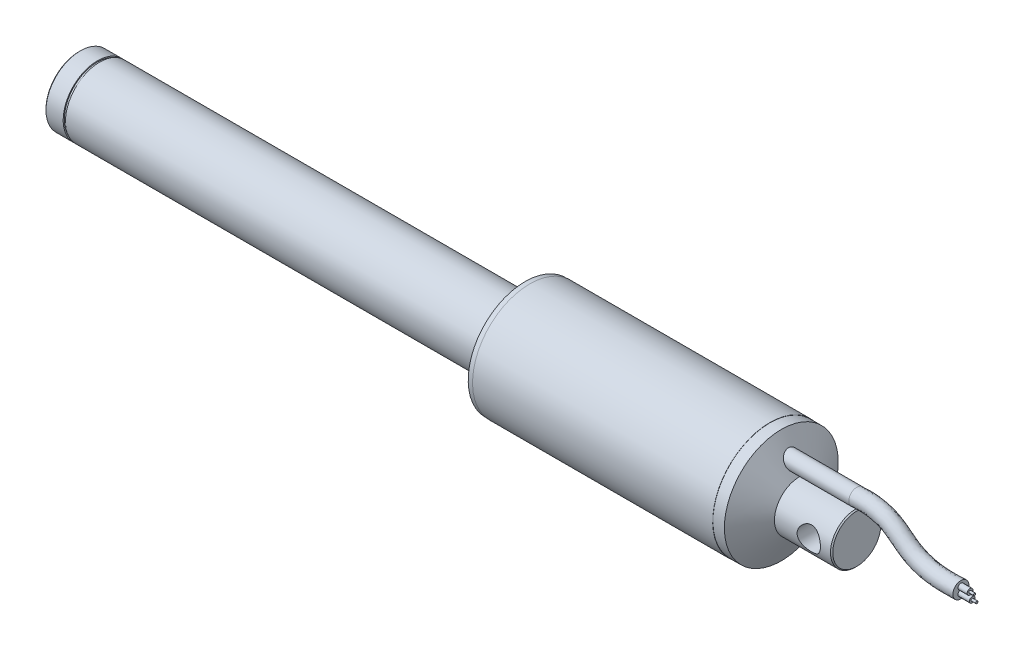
ISO-10303-21;
HEADER;
FILE_DESCRIPTION(('STEP AP214'),'2;1');
FILE_NAME('part.step','',(''),(''),'','','');
FILE_SCHEMA(('AUTOMOTIVE_DESIGN { 1 0 10303 214 1 1 1 1 }'));
ENDSEC;
DATA;
#1=APPLICATION_CONTEXT('core data for automotive mechanical design processes');
#2=APPLICATION_PROTOCOL_DEFINITION('international standard','automotive_design',2000,#1);
#3=PRODUCT_CONTEXT('',#1,'mechanical');
#4=PRODUCT('Part','Part','',(#3));
#5=PRODUCT_RELATED_PRODUCT_CATEGORY('part','',(#4));
#6=PRODUCT_DEFINITION_FORMATION('','',#4);
#7=PRODUCT_DEFINITION_CONTEXT('part definition',#1,'design');
#8=PRODUCT_DEFINITION('design','',#6,#7);
#9=PRODUCT_DEFINITION_SHAPE('','',#8);
#10=(LENGTH_UNIT() NAMED_UNIT(*) SI_UNIT(.MILLI.,.METRE.));
#11=(NAMED_UNIT(*) PLANE_ANGLE_UNIT() SI_UNIT($,.RADIAN.));
#12=(NAMED_UNIT(*) SI_UNIT($,.STERADIAN.) SOLID_ANGLE_UNIT());
#13=UNCERTAINTY_MEASURE_WITH_UNIT(LENGTH_MEASURE(1.E-05),#10,'distance_accuracy_value','');
#14=(GEOMETRIC_REPRESENTATION_CONTEXT(3) GLOBAL_UNCERTAINTY_ASSIGNED_CONTEXT((#13)) GLOBAL_UNIT_ASSIGNED_CONTEXT((#10,
#11,#12)) REPRESENTATION_CONTEXT('',''));
#15=CARTESIAN_POINT('',(0.,0.,0.));
#16=DIRECTION('',(0.,0.,1.));
#17=DIRECTION('',(1.,0.,0.));
#18=AXIS2_PLACEMENT_3D('',#15,#16,#17);
#19=CARTESIAN_POINT('',(49.5133430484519,4.68847183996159,0.));
#20=DIRECTION('',(0.999980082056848,-0.00631153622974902,0.));
#21=DIRECTION('',(0.00631153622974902,0.999980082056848,0.));
#22=AXIS2_PLACEMENT_3D('',#19,#20,#21);
#23=PLANE('',#22);
#24=CARTESIAN_POINT('',(49.5133430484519,4.68847183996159,0.));
#25=DIRECTION('',(0.999980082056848,-0.00631153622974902,0.));
#26=DIRECTION('',(0.00631153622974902,0.999980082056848,0.));
#27=AXIS2_PLACEMENT_3D('',#24,#25,#26);
#28=CIRCLE('',#27,1.25);
#29=CARTESIAN_POINT('',(49.5054536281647,3.43849673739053,0.));
#30=VERTEX_POINT('',#29);
#31=EDGE_CURVE('E73',#30,#30,#28,.T.);
#32=ORIENTED_EDGE('',*,*,#31,.T.);
#33=EDGE_LOOP('',(#32));
#34=FACE_BOUND('',#33,.T.);
#35=CARTESIAN_POINT('',(49.5133430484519,4.68847183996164,0.));
#36=DIRECTION('',(0.999980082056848,-0.00631153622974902,0.));
#37=DIRECTION('',(0.00631153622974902,0.999980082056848,0.));
#38=AXIS2_PLACEMENT_3D('',#35,#36,#37);
#39=CIRCLE('',#38,0.5);
#40=CARTESIAN_POINT('',(49.5164988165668,5.18846188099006,0.));
#41=VERTEX_POINT('',#40);
#42=EDGE_CURVE('E76',#41,#41,#39,.T.);
#43=ORIENTED_EDGE('',*,*,#42,.F.);
#44=EDGE_LOOP('',(#43));
#45=FACE_BOUND('',#44,.T.);
#46=ADVANCED_FACE('F47',(#34,#45),#23,.T.);
#47=CARTESIAN_POINT('',(50.4974180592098,2.16221049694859,0.));
#48=DIRECTION('',(0.999980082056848,-0.00631153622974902,0.));
#49=DIRECTION('',(0.00631153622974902,0.999980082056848,0.));
#50=AXIS2_PLACEMENT_3D('',#47,#48,#49);
#51=PLANE('',#50);
#52=CARTESIAN_POINT('',(50.4974180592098,2.16221049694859,0.));
#53=DIRECTION('',(0.999980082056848,-0.00631153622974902,0.));
#54=DIRECTION('',(0.00631153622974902,0.999980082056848,0.));
#55=AXIS2_PLACEMENT_3D('',#52,#53,#54);
#56=CIRCLE('',#55,1.25000000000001);
#57=CARTESIAN_POINT('',(50.4895286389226,0.912235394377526,0.));
#58=VERTEX_POINT('',#57);
#59=EDGE_CURVE('E68',#58,#58,#56,.T.);
#60=ORIENTED_EDGE('',*,*,#59,.T.);
#61=EDGE_LOOP('',(#60));
#62=FACE_BOUND('',#61,.T.);
#63=CARTESIAN_POINT('',(50.4974180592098,2.16221049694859,0.));
#64=DIRECTION('',(0.999980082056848,-0.00631153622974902,0.));
#65=DIRECTION('',(0.00631153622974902,0.999980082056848,0.));
#66=AXIS2_PLACEMENT_3D('',#63,#64,#65);
#67=CIRCLE('',#66,0.500000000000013);
#68=CARTESIAN_POINT('',(50.5005738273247,2.66220053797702,0.));
#69=VERTEX_POINT('',#68);
#70=EDGE_CURVE('E66',#69,#69,#67,.F.);
#71=ORIENTED_EDGE('',*,*,#70,.T.);
#72=EDGE_LOOP('',(#71));
#73=FACE_BOUND('',#72,.T.);
#74=ADVANCED_FACE('F228',(#62,#73),#51,.T.);
#75=CARTESIAN_POINT('',(45.505470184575,3.45374308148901,3.5));
#76=DIRECTION('',(-0.999980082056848,0.00631153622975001,0.));
#77=DIRECTION('',(-0.00631153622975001,-0.999980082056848,0.));
#78=AXIS2_PLACEMENT_3D('',#75,#76,#77);
#79=PLANE('',#78);
#80=CARTESIAN_POINT('',(45.5134227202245,4.71371798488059,0.));
#81=DIRECTION('',(-0.999980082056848,0.00631153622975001,0.));
#82=DIRECTION('',(-0.00631153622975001,-0.999980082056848,0.));
#83=AXIS2_PLACEMENT_3D('',#80,#81,#82);
#84=CIRCLE('',#83,1.25);
#85=CARTESIAN_POINT('',(45.5055332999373,3.46374288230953,0.));
#86=VERTEX_POINT('',#85);
#87=EDGE_CURVE('E58',#86,#86,#84,.F.);
#88=ORIENTED_EDGE('',*,*,#87,.F.);
#89=EDGE_LOOP('',(#88));
#90=FACE_BOUND('',#89,.T.);
#91=CARTESIAN_POINT('',(45.505470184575,3.45374308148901,0.));
#92=DIRECTION('',(-0.999980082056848,0.00631153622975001,0.));
#93=DIRECTION('',(-0.00631153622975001,-0.999980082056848,0.));
#94=AXIS2_PLACEMENT_3D('',#91,#92,#93);
#95=CIRCLE('',#94,3.5);
#96=CARTESIAN_POINT('',(45.505470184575,3.45374308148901,-3.5));
#97=VERTEX_POINT('',#96);
#98=EDGE_CURVE('E87',#97,#97,#95,.T.);
#99=ORIENTED_EDGE('',*,*,#98,.F.);
#100=EDGE_LOOP('',(#99));
#101=FACE_BOUND('',#100,.T.);
#102=CARTESIAN_POINT('',(45.4975176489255,2.19376817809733,0.));
#103=DIRECTION('',(-0.999980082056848,0.00631153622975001,0.));
#104=DIRECTION('',(-0.00631153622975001,-0.999980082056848,0.));
#105=AXIS2_PLACEMENT_3D('',#102,#103,#104);
#106=CIRCLE('',#105,1.25);
#107=CARTESIAN_POINT('',(45.4896282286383,0.943793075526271,0.));
#108=VERTEX_POINT('',#107);
#109=EDGE_CURVE('E54',#108,#108,#106,.F.);
#110=ORIENTED_EDGE('',*,*,#109,.F.);
#111=EDGE_LOOP('',(#110));
#112=FACE_BOUND('',#111,.T.);
#113=ADVANCED_FACE('F217',(#90,#101,#112),#79,.F.);
#114=CARTESIAN_POINT('',(0.,0.,0.));
#115=DIRECTION('',(1.,0.,0.));
#116=DIRECTION('',(0.,1.,0.));
#117=AXIS2_PLACEMENT_3D('',#114,#115,#116);
#118=PLANE('',#117);
#119=CARTESIAN_POINT('',(0.,0.,0.));
#120=DIRECTION('',(1.,0.,0.));
#121=DIRECTION('',(0.,1.,0.));
#122=AXIS2_PLACEMENT_3D('',#119,#120,#121);
#123=CIRCLE('',#122,10.5);
#124=CARTESIAN_POINT('',(0.,10.5,0.));
#125=VERTEX_POINT('',#124);
#126=EDGE_CURVE('E274',#125,#125,#123,.T.);
#127=ORIENTED_EDGE('',*,*,#126,.T.);
#128=EDGE_LOOP('',(#127));
#129=FACE_BOUND('',#128,.T.);
#130=ADVANCED_FACE('F49',(#129),#118,.T.);
#131=CARTESIAN_POINT('',(0.,0.,0.));
#132=DIRECTION('',(1.,0.,0.));
#133=DIRECTION('',(0.,1.,0.));
#134=AXIS2_PLACEMENT_3D('',#131,#132,#133);
#135=CYLINDRICAL_SURFACE('',#134,11.);
#136=CARTESIAN_POINT('',(-0.500000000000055,0.,0.));
#137=DIRECTION('',(1.,0.,0.));
#138=DIRECTION('',(0.,1.,0.));
#139=AXIS2_PLACEMENT_3D('',#136,#137,#138);
#140=CIRCLE('',#139,11.);
#141=CARTESIAN_POINT('',(-0.500000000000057,11.,0.));
#142=VERTEX_POINT('',#141);
#143=EDGE_CURVE('E208',#142,#142,#140,.F.);
#144=ORIENTED_EDGE('',*,*,#143,.T.);
#145=EDGE_LOOP('',(#144));
#146=FACE_BOUND('',#145,.T.);
#147=CARTESIAN_POINT('',(-4.9,0.,-11.));
#148=CARTESIAN_POINT('',(-4.900000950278,-0.135263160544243,-10.9999991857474));
#149=CARTESIAN_POINT('',(-4.90538801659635,-0.270552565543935,-10.9974987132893));
#150=CARTESIAN_POINT('',(-4.92688059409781,-0.540149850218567,-10.9875589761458));
#151=CARTESIAN_POINT('',(-4.94299174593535,-0.674457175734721,-10.9801171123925));
#152=CARTESIAN_POINT('',(-4.98578945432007,-0.941263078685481,-10.9604719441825));
#153=CARTESIAN_POINT('',(-5.01249429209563,-1.07375811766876,-10.9482604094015));
#154=CARTESIAN_POINT('',(-5.07619842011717,-1.33580363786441,-10.9193872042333));
#155=CARTESIAN_POINT('',(-5.11320191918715,-1.46535289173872,-10.9027237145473));
#156=CARTESIAN_POINT('',(-5.19695477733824,-1.72007284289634,-10.865442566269));
#157=CARTESIAN_POINT('',(-5.24366322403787,-1.84525942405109,-10.844841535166));
#158=CARTESIAN_POINT('',(-5.34648814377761,-2.0910775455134,-10.8001405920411));
#159=CARTESIAN_POINT('',(-5.40260814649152,-2.21170735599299,-10.7760393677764));
#160=CARTESIAN_POINT('',(-5.58434770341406,-2.56557893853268,-10.6993393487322));
#161=CARTESIAN_POINT('',(-5.72344870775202,-2.79110985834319,-10.6422972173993));
#162=CARTESIAN_POINT('',(-6.0420206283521,-3.22825263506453,-10.5182187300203));
#163=CARTESIAN_POINT('',(-6.22327044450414,-3.43844833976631,-10.4508083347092));
#164=CARTESIAN_POINT('',(-6.61742252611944,-3.8268336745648,-10.3149249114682));
#165=CARTESIAN_POINT('',(-6.83034518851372,-4.00500251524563,-10.2464512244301));
#166=CARTESIAN_POINT('',(-7.17730105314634,-4.25020195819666,-10.1461469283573));
#167=CARTESIAN_POINT('',(-7.30170350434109,-4.33026084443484,-10.112145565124));
#168=CARTESIAN_POINT('',(-7.55752205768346,-4.47953133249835,-10.0469110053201));
#169=CARTESIAN_POINT('',(-7.6889351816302,-4.54874749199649,-10.0156766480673));
#170=CARTESIAN_POINT('',(-7.95800156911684,-4.67572215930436,-9.95703372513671));
#171=CARTESIAN_POINT('',(-8.09565469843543,-4.73348091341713,-9.92962507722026));
#172=CARTESIAN_POINT('',(-8.3762133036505,-4.83690490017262,-9.87965848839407));
#173=CARTESIAN_POINT('',(-8.51911581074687,-4.88257685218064,-9.85709785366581));
#174=CARTESIAN_POINT('',(-8.80116617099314,-4.95912926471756,-9.8187966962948));
#175=CARTESIAN_POINT('',(-8.94008920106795,-4.99068432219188,-9.8027496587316));
#176=CARTESIAN_POINT('',(-9.22055844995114,-5.04210108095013,-9.77640295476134));
#177=CARTESIAN_POINT('',(-9.36210332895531,-5.0619685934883,-9.76610043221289));
#178=CARTESIAN_POINT('',(-9.64661563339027,-5.08974859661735,-9.75165143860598));
#179=CARTESIAN_POINT('',(-9.7895824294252,-5.09766615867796,-9.74750235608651));
#180=CARTESIAN_POINT('',(-10.0757138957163,-5.10144433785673,-9.74552575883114));
#181=CARTESIAN_POINT('',(-10.2188785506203,-5.09730584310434,-9.74769777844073));
#182=CARTESIAN_POINT('',(-10.4899080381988,-5.07804785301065,-9.75774197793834));
#183=CARTESIAN_POINT('',(-10.617877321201,-5.06406240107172,-9.76502524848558));
#184=CARTESIAN_POINT('',(-10.8720764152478,-5.02652915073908,-9.78439832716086));
#185=CARTESIAN_POINT('',(-10.9983056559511,-5.00297829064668,-9.79648967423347));
#186=CARTESIAN_POINT('',(-11.2481321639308,-4.94657029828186,-9.8250923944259));
#187=CARTESIAN_POINT('',(-11.3717298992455,-4.91371483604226,-9.84160297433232));
#188=CARTESIAN_POINT('',(-11.6155972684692,-4.83902203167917,-9.87854214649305));
#189=CARTESIAN_POINT('',(-11.7358655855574,-4.7971811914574,-9.89897226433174));
#190=CARTESIAN_POINT('',(-12.0960030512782,-4.65661515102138,-9.96628983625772));
#191=CARTESIAN_POINT('',(-12.3296580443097,-4.54410481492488,-10.0185321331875));
#192=CARTESIAN_POINT('',(-12.7756877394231,-4.286265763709,-10.1315188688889));
#193=CARTESIAN_POINT('',(-12.988053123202,-4.14092276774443,-10.1922670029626));
#194=CARTESIAN_POINT('',(-13.409543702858,-3.80335210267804,-10.3233083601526));
#195=CARTESIAN_POINT('',(-13.6158904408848,-3.60777168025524,-10.3939273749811));
#196=CARTESIAN_POINT('',(-13.9939765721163,-3.18412967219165,-10.5314179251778));
#197=CARTESIAN_POINT('',(-14.1657036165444,-2.95605654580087,-10.5982881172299));
#198=CARTESIAN_POINT('',(-14.3962974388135,-2.58929933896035,-10.6916930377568));
#199=CARTESIAN_POINT('',(-14.4696661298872,-2.460517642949,-10.7221337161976));
#200=CARTESIAN_POINT('',(-14.6051861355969,-2.19641873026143,-10.7793300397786));
#201=CARTESIAN_POINT('',(-14.6673421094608,-2.06110425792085,-10.8060872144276));
#202=CARTESIAN_POINT('',(-14.779785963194,-1.7849029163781,-10.855127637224));
#203=CARTESIAN_POINT('',(-14.8300777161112,-1.64401788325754,-10.8774123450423));
#204=CARTESIAN_POINT('',(-14.9182358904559,-1.35771192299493,-10.9168441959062));
#205=CARTESIAN_POINT('',(-14.9561035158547,-1.21229143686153,-10.9339918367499));
#206=CARTESIAN_POINT('',(-15.0165861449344,-0.929106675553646,-10.9615450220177));
#207=CARTESIAN_POINT('',(-15.0401273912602,-0.791579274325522,-10.972357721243));
#208=CARTESIAN_POINT('',(-15.0758741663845,-0.51475624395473,-10.9888236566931));
#209=CARTESIAN_POINT('',(-15.0880805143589,-0.375460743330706,-10.9944772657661));
#210=CARTESIAN_POINT('',(-15.1010054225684,-0.0962677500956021,-11.0004647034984));
#211=CARTESIAN_POINT('',(-15.1017275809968,0.0436295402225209,-11.0008001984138));
#212=CARTESIAN_POINT('',(-15.0916841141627,0.322919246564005,-10.9961459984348));
#213=CARTESIAN_POINT('',(-15.0809188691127,0.462311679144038,-10.9911564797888));
#214=CARTESIAN_POINT('',(-15.0491017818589,0.730484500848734,-10.9764860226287));
#215=CARTESIAN_POINT('',(-15.0287607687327,0.8593678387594,-10.9671296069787));
#216=CARTESIAN_POINT('',(-14.9783564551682,1.11486742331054,-10.944109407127));
#217=CARTESIAN_POINT('',(-14.9482900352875,1.24148292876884,-10.9304442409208));
#218=CARTESIAN_POINT('',(-14.8787386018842,1.49155716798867,-10.8991341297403));
#219=CARTESIAN_POINT('',(-14.8392563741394,1.6150168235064,-10.881490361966));
#220=CARTESIAN_POINT('',(-14.7512314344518,1.85810045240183,-10.8426311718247));
#221=CARTESIAN_POINT('',(-14.7026852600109,1.97772293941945,-10.8214143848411));
#222=CARTESIAN_POINT('',(-14.5408110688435,2.3369358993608,-10.7517072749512));
#223=CARTESIAN_POINT('',(-14.413340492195,2.56935571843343,-10.6981367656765));
#224=CARTESIAN_POINT('',(-14.1253020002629,3.01021277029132,-10.5825684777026));
#225=CARTESIAN_POINT('',(-13.9647195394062,3.21863940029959,-10.5205669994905));
#226=CARTESIAN_POINT('',(-13.5988140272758,3.62485946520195,-10.3879679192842));
#227=CARTESIAN_POINT('',(-13.3908167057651,3.82015778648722,-10.3170913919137));
#228=CARTESIAN_POINT('',(-12.9441863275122,4.17407366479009,-10.1790610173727));
#229=CARTESIAN_POINT('',(-12.7055392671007,4.33267436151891,-10.1119088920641));
#230=CARTESIAN_POINT('',(-12.3247329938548,4.54175480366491,-10.0189090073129));
#231=CARTESIAN_POINT('',(-12.1917507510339,4.60742117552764,-9.9887958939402));
#232=CARTESIAN_POINT('',(-11.9198572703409,4.72717466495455,-9.93268297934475));
#233=CARTESIAN_POINT('',(-11.7809487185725,4.78126696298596,-9.90668133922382));
#234=CARTESIAN_POINT('',(-11.4982453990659,4.87724668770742,-9.85978303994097));
#235=CARTESIAN_POINT('',(-11.3544539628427,4.91914225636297,-9.83888297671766));
#236=CARTESIAN_POINT('',(-11.0630403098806,4.99023317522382,-9.80301811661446));
#237=CARTESIAN_POINT('',(-10.9154185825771,5.01943013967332,-9.78805256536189));
#238=CARTESIAN_POINT('',(-10.6309950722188,5.06267209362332,-9.76575065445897));
#239=CARTESIAN_POINT('',(-10.4944071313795,5.07783914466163,-9.75785144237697));
#240=CARTESIAN_POINT('',(-10.2202451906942,5.09709437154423,-9.74780742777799));
#241=CARTESIAN_POINT('',(-10.0826712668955,5.10118339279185,-9.74566218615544));
#242=CARTESIAN_POINT('',(-9.80770908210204,5.09822754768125,-9.747208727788));
#243=CARTESIAN_POINT('',(-9.67032078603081,5.09118521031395,-9.75089918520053));
#244=CARTESIAN_POINT('',(-9.39683588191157,5.06606851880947,-9.76397198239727));
#245=CARTESIAN_POINT('',(-9.26073924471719,5.04799441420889,-9.77335419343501));
#246=CARTESIAN_POINT('',(-9.00054449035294,5.00272503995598,-9.79659834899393));
#247=CARTESIAN_POINT('',(-8.87628342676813,4.97627305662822,-9.81009266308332));
#248=CARTESIAN_POINT('',(-8.63055685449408,4.91433635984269,-9.84126467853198));
#249=CARTESIAN_POINT('',(-8.50909224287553,4.87884879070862,-9.85894370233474));
#250=CARTESIAN_POINT('',(-8.14999947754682,4.75931154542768,-9.9175043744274));
#251=CARTESIAN_POINT('',(-7.9174999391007,4.66215686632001,-9.9639261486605));
#252=CARTESIAN_POINT('',(-7.45640049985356,4.42846950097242,-10.0700591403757));
#253=CARTESIAN_POINT('',(-7.22907099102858,4.2897608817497,-10.1304452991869));
#254=CARTESIAN_POINT('',(-6.79951368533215,3.97959212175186,-10.2562611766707));
#255=CARTESIAN_POINT('',(-6.59729752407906,3.80811689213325,-10.3216932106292));
#256=CARTESIAN_POINT('',(-6.20301255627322,3.41719403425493,-10.4579897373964));
#257=CARTESIAN_POINT('',(-6.01390707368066,3.19468429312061,-10.5287542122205));
#258=CARTESIAN_POINT('',(-5.76010223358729,2.83807287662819,-10.6282971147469));
#259=CARTESIAN_POINT('',(-5.68042296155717,2.71528417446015,-10.6604011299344));
#260=CARTESIAN_POINT('',(-5.53163825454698,2.4627590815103,-10.7215507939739));
#261=CARTESIAN_POINT('',(-5.46252793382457,2.33302593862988,-10.7505978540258));
#262=CARTESIAN_POINT('',(-5.33587099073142,2.06817142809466,-10.8046674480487));
#263=CARTESIAN_POINT('',(-5.27826072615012,1.9330849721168,-10.8297119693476));
#264=CARTESIAN_POINT('',(-5.17473086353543,1.65782444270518,-10.8752498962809));
#265=CARTESIAN_POINT('',(-5.12880558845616,1.51765287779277,-10.8957455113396));
#266=CARTESIAN_POINT('',(-5.04924272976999,1.23357689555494,-10.9315478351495));
#267=CARTESIAN_POINT('',(-5.01557656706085,1.0896820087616,-10.9468666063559));
#268=CARTESIAN_POINT('',(-4.96082807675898,0.799110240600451,-10.9719030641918));
#269=CARTESIAN_POINT('',(-4.93973735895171,0.652435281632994,-10.9816244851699));
#270=CARTESIAN_POINT('',(-4.9167220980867,0.421181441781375,-10.9922548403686));
#271=CARTESIAN_POINT('',(-4.91045454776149,0.337099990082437,-10.9951561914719));
#272=CARTESIAN_POINT('',(-4.9020931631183,0.168682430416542,-10.9990290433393));
#273=CARTESIAN_POINT('',(-4.89999940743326,0.0843463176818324,-11.0000005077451));
#274=CARTESIAN_POINT('',(-4.9,0.,-11.));
#275=B_SPLINE_CURVE_WITH_KNOTS('',3,(#147,#148,#149,#150,#151,#152,#153,#154,#155,#156,#157,
#158,#159,#160,#161,#162,#163,#164,#165,#166,#167,#168,#169,#170,#171,#172,#173,#174,#175,#176,
#177,#178,#179,#180,#181,#182,#183,#184,#185,#186,#187,#188,#189,#190,#191,#192,#193,#194,#195,
#196,#197,#198,#199,#200,#201,#202,#203,#204,#205,#206,#207,#208,#209,#210,#211,#212,#213,#214,
#215,#216,#217,#218,#219,#220,#221,#222,#223,#224,#225,#226,#227,#228,#229,#230,#231,#232,#233,
#234,#235,#236,#237,#238,#239,#240,#241,#242,#243,#244,#245,#246,#247,#248,#249,#250,#251,#252,
#253,#254,#255,#256,#257,#258,#259,#260,#261,#262,#263,#264,#265,#266,#267,#268,#269,#270,#271,
#272,#273,#274),.UNSPECIFIED.,.T.,.F.,(4,2,2,2,2,2,2,2,2,2,2,2,2,2,2,2,2,2,2,2,2,2,2,2,2,2,2,2,
2,2,2,2,2,2,2,2,2,2,2,2,2,2,2,2,2,2,2,2,2,2,2,2,2,2,2,2,2,2,2,2,2,2,2,4),(0.,0.405705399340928,
0.811624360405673,1.21824687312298,1.62503580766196,2.03014345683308,2.4354033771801,
3.24495395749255,4.09836551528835,4.95232905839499,5.40723525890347,5.86194972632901,
6.31665441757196,6.77110579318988,7.20059850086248,7.6298774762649,8.05897421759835,
8.48803934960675,8.87439571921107,9.26087585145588,9.64728666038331,10.0338481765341,
10.8239583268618,11.6144128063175,12.489452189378,13.3648031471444,13.8182279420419,
14.2714638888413,14.7245516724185,15.1775955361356,15.5968830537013,16.0161402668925,
16.4352661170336,16.8543780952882,17.2463655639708,17.6384788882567,18.0304763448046,
18.4226238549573,19.2302389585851,20.0382095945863,20.9163434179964,21.7948798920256,
22.2483838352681,22.701684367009,23.154681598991,23.6076212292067,24.0200303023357,
24.4324079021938,24.8446918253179,25.2569664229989,25.6398083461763,26.0227714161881,
26.7881758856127,27.6041025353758,28.4204058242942,29.3171453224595,29.7662545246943,
30.2151554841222,30.6614987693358,31.1076247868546,31.5527040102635,31.9974859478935,
32.2504677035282,32.503454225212),.UNSPECIFIED.);
#276=CARTESIAN_POINT('',(-4.9,0.,-11.));
#277=VERTEX_POINT('',#276);
#278=EDGE_CURVE('E95',#277,#277,#275,.T.);
#279=ORIENTED_EDGE('',*,*,#278,.F.);
#280=EDGE_LOOP('',(#279));
#281=FACE_BOUND('',#280,.T.);
#282=CARTESIAN_POINT('',(-4.9,0.,11.));
#283=CARTESIAN_POINT('',(-4.900000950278,0.135263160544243,10.9999991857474));
#284=CARTESIAN_POINT('',(-4.90538801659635,0.270552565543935,10.9974987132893));
#285=CARTESIAN_POINT('',(-4.92688059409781,0.540149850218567,10.9875589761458));
#286=CARTESIAN_POINT('',(-4.94299174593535,0.674457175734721,10.9801171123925));
#287=CARTESIAN_POINT('',(-4.98578945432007,0.941263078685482,10.9604719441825));
#288=CARTESIAN_POINT('',(-5.01249429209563,1.07375811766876,10.9482604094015));
#289=CARTESIAN_POINT('',(-5.07619842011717,1.33580363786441,10.9193872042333));
#290=CARTESIAN_POINT('',(-5.11320191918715,1.46535289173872,10.9027237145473));
#291=CARTESIAN_POINT('',(-5.19695477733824,1.72007284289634,10.865442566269));
#292=CARTESIAN_POINT('',(-5.24366322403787,1.8452594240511,10.844841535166));
#293=CARTESIAN_POINT('',(-5.34648814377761,2.0910775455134,10.8001405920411));
#294=CARTESIAN_POINT('',(-5.40260814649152,2.21170735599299,10.7760393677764));
#295=CARTESIAN_POINT('',(-5.58434770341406,2.56557893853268,10.6993393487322));
#296=CARTESIAN_POINT('',(-5.72344870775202,2.79110985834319,10.6422972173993));
#297=CARTESIAN_POINT('',(-6.0420206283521,3.22825263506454,10.5182187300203));
#298=CARTESIAN_POINT('',(-6.22327044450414,3.43844833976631,10.4508083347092));
#299=CARTESIAN_POINT('',(-6.61742252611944,3.82683367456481,10.3149249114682));
#300=CARTESIAN_POINT('',(-6.83034518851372,4.00500251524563,10.2464512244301));
#301=CARTESIAN_POINT('',(-7.17730105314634,4.25020195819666,10.1461469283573));
#302=CARTESIAN_POINT('',(-7.30170350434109,4.33026084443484,10.112145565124));
#303=CARTESIAN_POINT('',(-7.55752205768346,4.47953133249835,10.0469110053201));
#304=CARTESIAN_POINT('',(-7.68893518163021,4.54874749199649,10.0156766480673));
#305=CARTESIAN_POINT('',(-7.95800156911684,4.67572215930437,9.95703372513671));
#306=CARTESIAN_POINT('',(-8.09565469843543,4.73348091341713,9.92962507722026));
#307=CARTESIAN_POINT('',(-8.3762133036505,4.83690490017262,9.87965848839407));
#308=CARTESIAN_POINT('',(-8.51911581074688,4.88257685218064,9.85709785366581));
#309=CARTESIAN_POINT('',(-8.80116617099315,4.95912926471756,9.8187966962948));
#310=CARTESIAN_POINT('',(-8.94008920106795,4.99068432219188,9.8027496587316));
#311=CARTESIAN_POINT('',(-9.22055844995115,5.04210108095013,9.77640295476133));
#312=CARTESIAN_POINT('',(-9.36210332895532,5.0619685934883,9.76610043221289));
#313=CARTESIAN_POINT('',(-9.64661563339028,5.08974859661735,9.75165143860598));
#314=CARTESIAN_POINT('',(-9.78958242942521,5.09766615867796,9.74750235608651));
#315=CARTESIAN_POINT('',(-10.0757138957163,5.10144433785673,9.74552575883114));
#316=CARTESIAN_POINT('',(-10.2188785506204,5.09730584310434,9.74769777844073));
#317=CARTESIAN_POINT('',(-10.4899080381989,5.07804785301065,9.75774197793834));
#318=CARTESIAN_POINT('',(-10.617877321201,5.06406240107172,9.76502524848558));
#319=CARTESIAN_POINT('',(-10.8720764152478,5.02652915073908,9.78439832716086));
#320=CARTESIAN_POINT('',(-10.9983056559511,5.00297829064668,9.79648967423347));
#321=CARTESIAN_POINT('',(-11.2481321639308,4.94657029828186,9.8250923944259));
#322=CARTESIAN_POINT('',(-11.3717298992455,4.91371483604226,9.84160297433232));
#323=CARTESIAN_POINT('',(-11.6155972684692,4.83902203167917,9.87854214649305));
#324=CARTESIAN_POINT('',(-11.7358655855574,4.7971811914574,9.89897226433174));
#325=CARTESIAN_POINT('',(-12.0960030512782,4.65661515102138,9.96628983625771));
#326=CARTESIAN_POINT('',(-12.3296580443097,4.54410481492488,10.0185321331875));
#327=CARTESIAN_POINT('',(-12.7756877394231,4.286265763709,10.1315188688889));
#328=CARTESIAN_POINT('',(-12.988053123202,4.14092276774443,10.1922670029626));
#329=CARTESIAN_POINT('',(-13.409543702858,3.80335210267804,10.3233083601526));
#330=CARTESIAN_POINT('',(-13.6158904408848,3.60777168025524,10.3939273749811));
#331=CARTESIAN_POINT('',(-13.9939765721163,3.18412967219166,10.5314179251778));
#332=CARTESIAN_POINT('',(-14.1657036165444,2.95605654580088,10.5982881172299));
#333=CARTESIAN_POINT('',(-14.3962974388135,2.58929933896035,10.6916930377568));
#334=CARTESIAN_POINT('',(-14.4696661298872,2.460517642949,10.7221337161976));
#335=CARTESIAN_POINT('',(-14.6051861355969,2.19641873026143,10.7793300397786));
#336=CARTESIAN_POINT('',(-14.6673421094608,2.06110425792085,10.8060872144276));
#337=CARTESIAN_POINT('',(-14.779785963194,1.7849029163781,10.855127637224));
#338=CARTESIAN_POINT('',(-14.8300777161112,1.64401788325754,10.8774123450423));
#339=CARTESIAN_POINT('',(-14.9182358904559,1.35771192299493,10.9168441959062));
#340=CARTESIAN_POINT('',(-14.9561035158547,1.21229143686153,10.9339918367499));
#341=CARTESIAN_POINT('',(-15.0165861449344,0.929106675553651,10.9615450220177));
#342=CARTESIAN_POINT('',(-15.0401273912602,0.791579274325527,10.972357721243));
#343=CARTESIAN_POINT('',(-15.0758741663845,0.514756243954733,10.9888236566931));
#344=CARTESIAN_POINT('',(-15.0880805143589,0.375460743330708,10.9944772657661));
#345=CARTESIAN_POINT('',(-15.1010054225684,0.0962677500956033,11.0004647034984));
#346=CARTESIAN_POINT('',(-15.1017275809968,-0.0436295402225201,11.0008001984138));
#347=CARTESIAN_POINT('',(-15.0916841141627,-0.322919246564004,10.9961459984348));
#348=CARTESIAN_POINT('',(-15.0809188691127,-0.462311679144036,10.9911564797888));
#349=CARTESIAN_POINT('',(-15.0491017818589,-0.730484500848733,10.9764860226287));
#350=CARTESIAN_POINT('',(-15.0287607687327,-0.859367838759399,10.9671296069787));
#351=CARTESIAN_POINT('',(-14.9783564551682,-1.11486742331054,10.944109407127));
#352=CARTESIAN_POINT('',(-14.9482900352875,-1.24148292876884,10.9304442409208));
#353=CARTESIAN_POINT('',(-14.8787386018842,-1.49155716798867,10.8991341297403));
#354=CARTESIAN_POINT('',(-14.8392563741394,-1.6150168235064,10.881490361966));
#355=CARTESIAN_POINT('',(-14.7512314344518,-1.85810045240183,10.8426311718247));
#356=CARTESIAN_POINT('',(-14.7026852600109,-1.97772293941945,10.8214143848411));
#357=CARTESIAN_POINT('',(-14.5408110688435,-2.3369358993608,10.7517072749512));
#358=CARTESIAN_POINT('',(-14.413340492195,-2.56935571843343,10.6981367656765));
#359=CARTESIAN_POINT('',(-14.1253020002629,-3.01021277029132,10.5825684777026));
#360=CARTESIAN_POINT('',(-13.9647195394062,-3.2186394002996,10.5205669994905));
#361=CARTESIAN_POINT('',(-13.5988140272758,-3.62485946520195,10.3879679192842));
#362=CARTESIAN_POINT('',(-13.3908167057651,-3.82015778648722,10.3170913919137));
#363=CARTESIAN_POINT('',(-12.9441863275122,-4.17407366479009,10.1790610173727));
#364=CARTESIAN_POINT('',(-12.7055392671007,-4.33267436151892,10.1119088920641));
#365=CARTESIAN_POINT('',(-12.3247329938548,-4.54175480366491,10.0189090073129));
#366=CARTESIAN_POINT('',(-12.1917507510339,-4.60742117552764,9.9887958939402));
#367=CARTESIAN_POINT('',(-11.9198572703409,-4.72717466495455,9.93268297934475));
#368=CARTESIAN_POINT('',(-11.7809487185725,-4.78126696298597,9.90668133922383));
#369=CARTESIAN_POINT('',(-11.4982453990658,-4.87724668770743,9.85978303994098));
#370=CARTESIAN_POINT('',(-11.3544539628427,-4.91914225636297,9.83888297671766));
#371=CARTESIAN_POINT('',(-11.0630403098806,-4.99023317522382,9.80301811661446));
#372=CARTESIAN_POINT('',(-10.9154185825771,-5.01943013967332,9.78805256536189));
#373=CARTESIAN_POINT('',(-10.6309950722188,-5.06267209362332,9.76575065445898));
#374=CARTESIAN_POINT('',(-10.4944071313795,-5.07783914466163,9.75785144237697));
#375=CARTESIAN_POINT('',(-10.2202451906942,-5.09709437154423,9.74780742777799));
#376=CARTESIAN_POINT('',(-10.0826712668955,-5.10118339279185,9.74566218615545));
#377=CARTESIAN_POINT('',(-9.80770908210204,-5.09822754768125,9.747208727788));
#378=CARTESIAN_POINT('',(-9.67032078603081,-5.09118521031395,9.75089918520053));
#379=CARTESIAN_POINT('',(-9.39683588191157,-5.06606851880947,9.76397198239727));
#380=CARTESIAN_POINT('',(-9.26073924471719,-5.04799441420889,9.77335419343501));
#381=CARTESIAN_POINT('',(-9.00054449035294,-5.00272503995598,9.79659834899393));
#382=CARTESIAN_POINT('',(-8.87628342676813,-4.97627305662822,9.81009266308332));
#383=CARTESIAN_POINT('',(-8.63055685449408,-4.91433635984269,9.84126467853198));
#384=CARTESIAN_POINT('',(-8.50909224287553,-4.87884879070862,9.85894370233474));
#385=CARTESIAN_POINT('',(-8.14999947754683,-4.75931154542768,9.9175043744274));
#386=CARTESIAN_POINT('',(-7.91749993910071,-4.66215686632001,9.9639261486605));
#387=CARTESIAN_POINT('',(-7.45640049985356,-4.42846950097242,10.0700591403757));
#388=CARTESIAN_POINT('',(-7.22907099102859,-4.2897608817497,10.1304452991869));
#389=CARTESIAN_POINT('',(-6.79951368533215,-3.97959212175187,10.2562611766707));
#390=CARTESIAN_POINT('',(-6.59729752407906,-3.80811689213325,10.3216932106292));
#391=CARTESIAN_POINT('',(-6.20301255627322,-3.41719403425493,10.4579897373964));
#392=CARTESIAN_POINT('',(-6.01390707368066,-3.19468429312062,10.5287542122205));
#393=CARTESIAN_POINT('',(-5.76010223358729,-2.8380728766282,10.6282971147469));
#394=CARTESIAN_POINT('',(-5.68042296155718,-2.71528417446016,10.6604011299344));
#395=CARTESIAN_POINT('',(-5.53163825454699,-2.46275908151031,10.7215507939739));
#396=CARTESIAN_POINT('',(-5.46252793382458,-2.33302593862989,10.7505978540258));
#397=CARTESIAN_POINT('',(-5.33587099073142,-2.06817142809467,10.8046674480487));
#398=CARTESIAN_POINT('',(-5.27826072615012,-1.9330849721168,10.8297119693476));
#399=CARTESIAN_POINT('',(-5.17473086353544,-1.65782444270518,10.8752498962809));
#400=CARTESIAN_POINT('',(-5.12880558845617,-1.51765287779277,10.8957455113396));
#401=CARTESIAN_POINT('',(-5.04924272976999,-1.23357689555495,10.9315478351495));
#402=CARTESIAN_POINT('',(-5.01557656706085,-1.0896820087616,10.9468666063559));
#403=CARTESIAN_POINT('',(-4.96082807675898,-0.799110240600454,10.9719030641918));
#404=CARTESIAN_POINT('',(-4.93973735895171,-0.652435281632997,10.9816244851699));
#405=CARTESIAN_POINT('',(-4.91672209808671,-0.421181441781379,10.9922548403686));
#406=CARTESIAN_POINT('',(-4.91045454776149,-0.33709999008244,10.9951561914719));
#407=CARTESIAN_POINT('',(-4.9020931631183,-0.168682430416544,10.9990290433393));
#408=CARTESIAN_POINT('',(-4.89999940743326,-0.0843463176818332,11.0000005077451));
#409=CARTESIAN_POINT('',(-4.9,0.,11.));
#410=B_SPLINE_CURVE_WITH_KNOTS('',3,(#282,#283,#284,#285,#286,#287,#288,#289,#290,#291,#292,
#293,#294,#295,#296,#297,#298,#299,#300,#301,#302,#303,#304,#305,#306,#307,#308,#309,#310,#311,
#312,#313,#314,#315,#316,#317,#318,#319,#320,#321,#322,#323,#324,#325,#326,#327,#328,#329,#330,
#331,#332,#333,#334,#335,#336,#337,#338,#339,#340,#341,#342,#343,#344,#345,#346,#347,#348,#349,
#350,#351,#352,#353,#354,#355,#356,#357,#358,#359,#360,#361,#362,#363,#364,#365,#366,#367,#368,
#369,#370,#371,#372,#373,#374,#375,#376,#377,#378,#379,#380,#381,#382,#383,#384,#385,#386,#387,
#388,#389,#390,#391,#392,#393,#394,#395,#396,#397,#398,#399,#400,#401,#402,#403,#404,#405,#406,
#407,#408,#409),.UNSPECIFIED.,.T.,.F.,(4,2,2,2,2,2,2,2,2,2,2,2,2,2,2,2,2,2,2,2,2,2,2,2,2,2,2,2,
2,2,2,2,2,2,2,2,2,2,2,2,2,2,2,2,2,2,2,2,2,2,2,2,2,2,2,2,2,2,2,2,2,2,2,4),(0.,0.405705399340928,
0.811624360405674,1.21824687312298,1.62503580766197,2.03014345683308,2.4354033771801,
3.24495395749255,4.09836551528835,4.952329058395,5.40723525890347,5.86194972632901,
6.31665441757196,6.77110579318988,7.20059850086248,7.62987747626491,8.05897421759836,
8.48803934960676,8.87439571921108,9.26087585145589,9.64728666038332,10.0338481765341,
10.8239583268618,11.6144128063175,12.489452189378,13.3648031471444,13.8182279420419,
14.2714638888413,14.7245516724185,15.1775955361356,15.5968830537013,16.0161402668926,
16.4352661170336,16.8543780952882,17.2463655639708,17.6384788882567,18.0304763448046,
18.4226238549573,19.2302389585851,20.0382095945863,20.9163434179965,21.7948798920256,
22.2483838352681,22.701684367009,23.154681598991,23.6076212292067,24.0200303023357,
24.4324079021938,24.8446918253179,25.2569664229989,25.6398083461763,26.0227714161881,
26.7881758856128,27.6041025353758,28.4204058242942,29.3171453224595,29.7662545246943,
30.2151554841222,30.6614987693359,31.1076247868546,31.5527040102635,31.9974859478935,
32.2504677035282,32.503454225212),.UNSPECIFIED.);
#411=CARTESIAN_POINT('',(-4.9,0.,11.));
#412=VERTEX_POINT('',#411);
#413=EDGE_CURVE('E129',#412,#412,#410,.T.);
#414=ORIENTED_EDGE('',*,*,#413,.F.);
#415=EDGE_LOOP('',(#414));
#416=FACE_BOUND('',#415,.T.);
#417=CARTESIAN_POINT('',(-25.,0.,0.));
#418=DIRECTION('',(1.,0.,0.));
#419=DIRECTION('',(0.,1.,0.));
#420=AXIS2_PLACEMENT_3D('',#417,#418,#419);
#421=CIRCLE('',#420,11.);
#422=CARTESIAN_POINT('',(-25.,11.,0.));
#423=VERTEX_POINT('',#422);
#424=EDGE_CURVE('E125',#423,#423,#421,.T.);
#425=ORIENTED_EDGE('',*,*,#424,.T.);
#426=EDGE_LOOP('',(#425));
#427=FACE_BOUND('',#426,.T.);
#428=ADVANCED_FACE('F138',(#146,#281,#416,#427),#135,.T.);
#429=CARTESIAN_POINT('',(-25.,0.,0.));
#430=DIRECTION('',(-1.,0.,0.));
#431=DIRECTION('',(0.,-1.,0.));
#432=AXIS2_PLACEMENT_3D('',#429,#430,#431);
#433=CONICAL_SURFACE('',#432,11.,1.04855664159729);
#434=CARTESIAN_POINT('',(-28.948804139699,17.5864689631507,-3.11979426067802));
#435=CARTESIAN_POINT('',(-29.0374806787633,17.7584629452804,-3.03233765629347));
#436=CARTESIAN_POINT('',(-29.1221106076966,17.9248493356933,-2.92980293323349));
#437=CARTESIAN_POINT('',(-29.2812752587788,18.2411605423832,-2.69552921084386));
#438=CARTESIAN_POINT('',(-29.3558136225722,18.3910912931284,-2.56380079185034));
#439=CARTESIAN_POINT('',(-29.4929900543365,18.6694619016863,-2.27260305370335));
#440=CARTESIAN_POINT('',(-29.5555717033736,18.7977995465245,-2.1130087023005));
#441=CARTESIAN_POINT('',(-29.6662519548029,19.0262995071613,-1.77027216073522));
#442=CARTESIAN_POINT('',(-29.7143560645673,19.1264725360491,-1.5871389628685));
#443=CARTESIAN_POINT('',(-29.7909751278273,19.2867260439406,-1.21842046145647));
#444=CARTESIAN_POINT('',(-29.820754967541,19.3493841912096,-1.03421845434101));
#445=CARTESIAN_POINT('',(-29.8653587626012,19.4434219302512,-0.656280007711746));
#446=CARTESIAN_POINT('',(-29.8801903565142,19.4748174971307,-0.462548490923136));
#447=CARTESIAN_POINT('',(-29.8938105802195,19.5036479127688,-0.0862855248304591));
#448=CARTESIAN_POINT('',(-29.8936890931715,19.5033898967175,0.0960338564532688));
#449=CARTESIAN_POINT('',(-29.8801144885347,19.4746578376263,0.457906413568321));
#450=CARTESIAN_POINT('',(-29.8666636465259,19.4461886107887,0.637460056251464));
#451=CARTESIAN_POINT('',(-29.8272424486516,19.3630492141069,0.985589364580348));
#452=CARTESIAN_POINT('',(-29.8014927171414,19.3088408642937,1.15430121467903));
#453=CARTESIAN_POINT('',(-29.7383802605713,19.1766507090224,1.47978288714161));
#454=CARTESIAN_POINT('',(-29.7010162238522,19.0986662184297,1.63655135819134));
#455=CARTESIAN_POINT('',(-29.6140997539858,18.918447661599,1.94037257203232));
#456=CARTESIAN_POINT('',(-29.5641347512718,18.815398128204,2.08682192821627));
#457=CARTESIAN_POINT('',(-29.4541892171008,18.590524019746,2.36020019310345));
#458=CARTESIAN_POINT('',(-29.3942057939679,18.468694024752,2.48712344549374));
#459=CARTESIAN_POINT('',(-29.2604389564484,18.1996227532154,2.72891089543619));
#460=CARTESIAN_POINT('',(-29.1859321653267,18.0511237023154,2.84197250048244));
#461=CARTESIAN_POINT('',(-29.0286403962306,17.741336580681,3.04166965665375));
#462=CARTESIAN_POINT('',(-28.9458521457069,17.5800434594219,3.12829470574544));
#463=CARTESIAN_POINT('',(-28.7647231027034,17.2317720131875,3.28216896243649));
#464=CARTESIAN_POINT('',(-28.6656601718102,17.0438664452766,3.3464686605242));
#465=CARTESIAN_POINT('',(-28.4616432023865,16.6629790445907,3.44224834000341));
#466=CARTESIAN_POINT('',(-28.3566865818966,16.4699950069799,3.47371381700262));
#467=CARTESIAN_POINT('',(-28.1320447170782,16.0639126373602,3.50592284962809));
#468=CARTESIAN_POINT('',(-28.0119473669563,15.8507653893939,3.50321519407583));
#469=CARTESIAN_POINT('',(-27.7698350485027,15.4294894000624,3.45968412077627));
#470=CARTESIAN_POINT('',(-27.6478193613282,15.2213626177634,3.41884606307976));
#471=CARTESIAN_POINT('',(-27.3969373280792,14.8020958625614,3.29632090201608));
#472=CARTESIAN_POINT('',(-27.2681376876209,14.5916299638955,3.21216510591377));
#473=CARTESIAN_POINT('',(-27.0157843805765,14.1881946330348,3.00317643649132));
#474=CARTESIAN_POINT('',(-26.8922345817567,13.9952379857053,2.87831414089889));
#475=CARTESIAN_POINT('',(-26.6577963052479,13.636734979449,2.59163665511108));
#476=CARTESIAN_POINT('',(-26.5467193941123,13.4707563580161,2.43052990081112));
#477=CARTESIAN_POINT('',(-26.3930694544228,13.2453324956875,2.16228050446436));
#478=CARTESIAN_POINT('',(-26.3440320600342,13.1741408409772,2.06847864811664));
#479=CARTESIAN_POINT('',(-26.2512386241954,13.040579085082,1.87240126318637));
#480=CARTESIAN_POINT('',(-26.2074799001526,12.9782045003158,1.77013008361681));
#481=CARTESIAN_POINT('',(-26.1114374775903,12.8423323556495,1.51866594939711));
#482=CARTESIAN_POINT('',(-26.0619141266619,12.7731467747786,1.36602177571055));
#483=CARTESIAN_POINT('',(-25.9778685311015,12.6565749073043,1.04881629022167));
#484=CARTESIAN_POINT('',(-25.9433323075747,12.6091683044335,0.884266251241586));
#485=CARTESIAN_POINT('',(-25.8917261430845,12.5385848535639,0.546367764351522));
#486=CARTESIAN_POINT('',(-25.8747493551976,12.5155372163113,0.372977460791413));
#487=CARTESIAN_POINT('',(-25.860161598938,12.4957221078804,0.0238899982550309));
#488=CARTESIAN_POINT('',(-25.8625458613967,12.4989481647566,-0.151806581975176));
#489=CARTESIAN_POINT('',(-25.8853935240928,12.5300142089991,-0.484470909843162));
#490=CARTESIAN_POINT('',(-25.9042927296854,12.5557247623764,-0.641754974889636));
#491=CARTESIAN_POINT('',(-25.9566323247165,12.6274364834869,-0.949065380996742));
#492=CARTESIAN_POINT('',(-25.9900751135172,12.6734409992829,-1.09909051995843));
#493=CARTESIAN_POINT('',(-26.0709740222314,12.7857978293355,-1.39459821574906));
#494=CARTESIAN_POINT('',(-26.1189403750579,12.8528951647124,-1.5396543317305));
#495=CARTESIAN_POINT('',(-26.2256802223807,13.0040097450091,-1.81629303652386));
#496=CARTESIAN_POINT('',(-26.2844582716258,13.0880341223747,-1.94786991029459));
#497=CARTESIAN_POINT('',(-26.4200304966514,13.2844496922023,-2.21525616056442));
#498=CARTESIAN_POINT('',(-26.4982052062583,13.399215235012,-2.3486171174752));
#499=CARTESIAN_POINT('',(-26.6624407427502,13.6443675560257,-2.59445161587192));
#500=CARTESIAN_POINT('',(-26.7485064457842,13.7747640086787,-2.70691211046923));
#501=CARTESIAN_POINT('',(-26.9416443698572,14.0724297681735,-2.92825466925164));
#502=CARTESIAN_POINT('',(-27.049737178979,14.2421391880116,-3.03297451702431));
#503=CARTESIAN_POINT('',(-27.2698357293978,14.5947396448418,-3.21159628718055));
#504=CARTESIAN_POINT('',(-27.3818436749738,14.7776381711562,-3.28548053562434));
#505=CARTESIAN_POINT('',(-27.6207960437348,15.1755434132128,-3.40862901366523));
#506=CARTESIAN_POINT('',(-27.7478933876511,15.3917428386,-3.45378233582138));
#507=CARTESIAN_POINT('',(-28.0002070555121,15.8299591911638,-3.50281541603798));
#508=CARTESIAN_POINT('',(-28.125422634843,16.0519783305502,-3.50667924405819));
#509=CARTESIAN_POINT('',(-28.3722441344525,16.4980818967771,-3.47167586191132));
#510=CARTESIAN_POINT('',(-28.4937926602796,16.7221610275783,-3.43232120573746));
#511=CARTESIAN_POINT('',(-28.7284623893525,17.1623775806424,-3.30923012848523));
#512=CARTESIAN_POINT('',(-28.8415908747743,17.3785217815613,-3.22553257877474));
#513=CARTESIAN_POINT('',(-28.948804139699,17.5864689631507,-3.11979426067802));
#514=B_SPLINE_CURVE_WITH_KNOTS('',3,(#434,#435,#436,#437,#438,#439,#440,#441,#442,#443,#444,
#445,#446,#447,#448,#449,#450,#451,#452,#453,#454,#455,#456,#457,#458,#459,#460,#461,#462,#463,
#464,#465,#466,#467,#468,#469,#470,#471,#472,#473,#474,#475,#476,#477,#478,#479,#480,#481,#482,
#483,#484,#485,#486,#487,#488,#489,#490,#491,#492,#493,#494,#495,#496,#497,#498,#499,#500,#501,
#502,#503,#504,#505,#506,#507,#508,#509,#510,#511,#512,#513),.UNSPECIFIED.,.T.,.F.,(4,2,2,2,2,2,
2,2,2,2,2,2,2,2,2,2,2,2,2,2,2,2,2,2,2,2,2,2,2,2,2,2,2,2,2,2,2,2,2,4),(0.,0.636299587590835,
1.27236894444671,1.91136929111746,2.5501262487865,3.1374802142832,3.72453388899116,
4.26882635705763,4.81302591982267,5.34781036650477,5.88265523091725,6.43801694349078,
6.99353923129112,7.59394063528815,8.1945802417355,8.85764597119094,9.5210044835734,
10.2518506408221,10.9829775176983,11.7613407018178,12.5402677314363,13.3051209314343,
13.6872182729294,14.0691206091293,14.5911032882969,15.1125980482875,15.6368453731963,
16.1609635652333,16.6402413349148,17.1195982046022,17.6182650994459,18.117142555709,
18.6925681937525,19.2683518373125,19.9461229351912,20.6242819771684,21.3852967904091,
22.1466052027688,22.9165891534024,23.6858992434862),.UNSPECIFIED.);
#515=CARTESIAN_POINT('',(-28.948804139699,17.5864689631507,-3.11979426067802));
#516=VERTEX_POINT('',#515);
#517=EDGE_CURVE('E63',#516,#516,#514,.T.);
#518=ORIENTED_EDGE('',*,*,#517,.F.);
#519=EDGE_LOOP('',(#518));
#520=FACE_BOUND('',#519,.T.);
#521=CARTESIAN_POINT('',(-33.,0.,0.));
#522=DIRECTION('',(1.,0.,0.));
#523=DIRECTION('',(0.,1.,0.));
#524=AXIS2_PLACEMENT_3D('',#521,#522,#523);
#525=CIRCLE('',#524,24.9);
#526=CARTESIAN_POINT('',(-33.,24.9,0.));
#527=VERTEX_POINT('',#526);
#528=EDGE_CURVE('E122',#527,#527,#525,.T.);
#529=ORIENTED_EDGE('',*,*,#528,.T.);
#530=EDGE_LOOP('',(#529));
#531=FACE_BOUND('',#530,.T.);
#532=ORIENTED_EDGE('',*,*,#424,.F.);
#533=EDGE_LOOP('',(#532));
#534=FACE_BOUND('',#533,.T.);
#535=ADVANCED_FACE('F196',(#520,#531,#534),#433,.T.);
#536=CARTESIAN_POINT('',(0.,0.,0.));
#537=DIRECTION('',(1.,0.,0.));
#538=DIRECTION('',(0.,1.,0.));
#539=AXIS2_PLACEMENT_3D('',#536,#537,#538);
#540=CYLINDRICAL_SURFACE('',#539,24.9);
#541=CARTESIAN_POINT('',(-38.,0.,0.));
#542=DIRECTION('',(1.,0.,0.));
#543=DIRECTION('',(0.,1.,0.));
#544=AXIS2_PLACEMENT_3D('',#541,#542,#543);
#545=CIRCLE('',#544,24.9);
#546=CARTESIAN_POINT('',(-38.,24.9,0.));
#547=VERTEX_POINT('',#546);
#548=EDGE_CURVE('E119',#547,#547,#545,.T.);
#549=ORIENTED_EDGE('',*,*,#548,.T.);
#550=EDGE_LOOP('',(#549));
#551=FACE_BOUND('',#550,.T.);
#552=ORIENTED_EDGE('',*,*,#528,.F.);
#553=EDGE_LOOP('',(#552));
#554=FACE_BOUND('',#553,.T.);
#555=ADVANCED_FACE('F193',(#551,#554),#540,.T.);
#556=CARTESIAN_POINT('',(-38.,24.9,0.));
#557=DIRECTION('',(1.,0.,0.));
#558=DIRECTION('',(0.,1.,0.));
#559=AXIS2_PLACEMENT_3D('',#556,#557,#558);
#560=PLANE('',#559);
#561=CARTESIAN_POINT('',(-38.,0.,0.));
#562=DIRECTION('',(1.,0.,0.));
#563=DIRECTION('',(0.,1.,0.));
#564=AXIS2_PLACEMENT_3D('',#561,#562,#563);
#565=CIRCLE('',#564,25.);
#566=CARTESIAN_POINT('',(-38.,25.,0.));
#567=VERTEX_POINT('',#566);
#568=EDGE_CURVE('E116',#567,#567,#565,.T.);
#569=ORIENTED_EDGE('',*,*,#568,.T.);
#570=EDGE_LOOP('',(#569));
#571=FACE_BOUND('',#570,.T.);
#572=ORIENTED_EDGE('',*,*,#548,.F.);
#573=EDGE_LOOP('',(#572));
#574=FACE_BOUND('',#573,.T.);
#575=ADVANCED_FACE('F189',(#571,#574),#560,.T.);
#576=CARTESIAN_POINT('',(0.,0.,0.));
#577=DIRECTION('',(1.,0.,0.));
#578=DIRECTION('',(0.,1.,0.));
#579=AXIS2_PLACEMENT_3D('',#576,#577,#578);
#580=CYLINDRICAL_SURFACE('',#579,25.);
#581=CARTESIAN_POINT('',(-143.,0.,0.));
#582=DIRECTION('',(1.,0.,0.));
#583=DIRECTION('',(0.,1.,0.));
#584=AXIS2_PLACEMENT_3D('',#581,#582,#583);
#585=CIRCLE('',#584,25.);
#586=CARTESIAN_POINT('',(-143.,25.,0.));
#587=VERTEX_POINT('',#586);
#588=EDGE_CURVE('E113',#587,#587,#585,.T.);
#589=ORIENTED_EDGE('',*,*,#588,.T.);
#590=EDGE_LOOP('',(#589));
#591=FACE_BOUND('',#590,.T.);
#592=ORIENTED_EDGE('',*,*,#568,.F.);
#593=EDGE_LOOP('',(#592));
#594=FACE_BOUND('',#593,.T.);
#595=ADVANCED_FACE('F185',(#591,#594),#580,.T.);
#596=CARTESIAN_POINT('',(-143.,25.,0.));
#597=DIRECTION('',(-1.,0.,0.));
#598=DIRECTION('',(0.,-1.,0.));
#599=AXIS2_PLACEMENT_3D('',#596,#597,#598);
#600=PLANE('',#599);
#601=CARTESIAN_POINT('',(-143.,0.,0.));
#602=DIRECTION('',(1.,0.,0.));
#603=DIRECTION('',(0.,1.,0.));
#604=AXIS2_PLACEMENT_3D('',#601,#602,#603);
#605=CIRCLE('',#604,24.9);
#606=CARTESIAN_POINT('',(-143.,24.9,0.));
#607=VERTEX_POINT('',#606);
#608=EDGE_CURVE('E110',#607,#607,#605,.T.);
#609=ORIENTED_EDGE('',*,*,#608,.T.);
#610=EDGE_LOOP('',(#609));
#611=FACE_BOUND('',#610,.T.);
#612=ORIENTED_EDGE('',*,*,#588,.F.);
#613=EDGE_LOOP('',(#612));
#614=FACE_BOUND('',#613,.T.);
#615=ADVANCED_FACE('F181',(#611,#614),#600,.T.);
#616=CARTESIAN_POINT('',(0.,0.,0.));
#617=DIRECTION('',(1.,0.,0.));
#618=DIRECTION('',(0.,1.,0.));
#619=AXIS2_PLACEMENT_3D('',#616,#617,#618);
#620=CYLINDRICAL_SURFACE('',#619,24.9);
#621=CARTESIAN_POINT('',(-145.,0.,0.));
#622=DIRECTION('',(1.,0.,0.));
#623=DIRECTION('',(0.,1.,0.));
#624=AXIS2_PLACEMENT_3D('',#621,#622,#623);
#625=CIRCLE('',#624,24.9);
#626=CARTESIAN_POINT('',(-145.,24.9,0.));
#627=VERTEX_POINT('',#626);
#628=EDGE_CURVE('E107',#627,#627,#625,.T.);
#629=ORIENTED_EDGE('',*,*,#628,.T.);
#630=EDGE_LOOP('',(#629));
#631=FACE_BOUND('',#630,.T.);
#632=ORIENTED_EDGE('',*,*,#608,.F.);
#633=EDGE_LOOP('',(#632));
#634=FACE_BOUND('',#633,.T.);
#635=ADVANCED_FACE('F177',(#631,#634),#620,.T.);
#636=CARTESIAN_POINT('',(-145.,0.,0.));
#637=DIRECTION('',(1.,0.,0.));
#638=DIRECTION('',(0.,1.,0.));
#639=AXIS2_PLACEMENT_3D('',#636,#637,#638);
#640=CONICAL_SURFACE('',#639,24.9,1.37145902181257);
#641=CARTESIAN_POINT('',(-147.,0.,0.));
#642=DIRECTION('',(1.,0.,0.));
#643=DIRECTION('',(0.,1.,0.));
#644=AXIS2_PLACEMENT_3D('',#641,#642,#643);
#645=CIRCLE('',#644,15.);
#646=CARTESIAN_POINT('',(-147.,15.,0.));
#647=VERTEX_POINT('',#646);
#648=EDGE_CURVE('E104',#647,#647,#645,.T.);
#649=ORIENTED_EDGE('',*,*,#648,.T.);
#650=EDGE_LOOP('',(#649));
#651=FACE_BOUND('',#650,.T.);
#652=ORIENTED_EDGE('',*,*,#628,.F.);
#653=EDGE_LOOP('',(#652));
#654=FACE_BOUND('',#653,.T.);
#655=ADVANCED_FACE('F173',(#651,#654),#640,.T.);
#656=CARTESIAN_POINT('',(0.,0.,0.));
#657=DIRECTION('',(1.,0.,0.));
#658=DIRECTION('',(0.,1.,0.));
#659=AXIS2_PLACEMENT_3D('',#656,#657,#658);
#660=CYLINDRICAL_SURFACE('',#659,15.);
#661=CARTESIAN_POINT('',(-331.,0.,0.));
#662=DIRECTION('',(1.,0.,0.));
#663=DIRECTION('',(0.,1.,0.));
#664=AXIS2_PLACEMENT_3D('',#661,#662,#663);
#665=CIRCLE('',#664,15.);
#666=CARTESIAN_POINT('',(-331.,15.,0.));
#667=VERTEX_POINT('',#666);
#668=EDGE_CURVE('E101',#667,#667,#665,.T.);
#669=ORIENTED_EDGE('',*,*,#668,.T.);
#670=EDGE_LOOP('',(#669));
#671=FACE_BOUND('',#670,.T.);
#672=ORIENTED_EDGE('',*,*,#648,.F.);
#673=EDGE_LOOP('',(#672));
#674=FACE_BOUND('',#673,.T.);
#675=ADVANCED_FACE('F169',(#671,#674),#660,.T.);
#676=CARTESIAN_POINT('',(-331.,15.,0.));
#677=DIRECTION('',(-1.,0.,0.));
#678=DIRECTION('',(0.,-1.,0.));
#679=AXIS2_PLACEMENT_3D('',#676,#677,#678);
#680=PLANE('',#679);
#681=CARTESIAN_POINT('',(-331.,0.,0.));
#682=DIRECTION('',(1.,0.,0.));
#683=DIRECTION('',(0.,1.,0.));
#684=AXIS2_PLACEMENT_3D('',#681,#682,#683);
#685=CIRCLE('',#684,14.5);
#686=CARTESIAN_POINT('',(-331.,14.5,0.));
#687=VERTEX_POINT('',#686);
#688=EDGE_CURVE('E98',#687,#687,#685,.T.);
#689=ORIENTED_EDGE('',*,*,#688,.T.);
#690=EDGE_LOOP('',(#689));
#691=FACE_BOUND('',#690,.T.);
#692=ORIENTED_EDGE('',*,*,#668,.F.);
#693=EDGE_LOOP('',(#692));
#694=FACE_BOUND('',#693,.T.);
#695=ADVANCED_FACE('F165',(#691,#694),#680,.T.);
#696=CARTESIAN_POINT('',(0.,0.,0.));
#697=DIRECTION('',(1.,0.,0.));
#698=DIRECTION('',(0.,1.,0.));
#699=AXIS2_PLACEMENT_3D('',#696,#697,#698);
#700=CYLINDRICAL_SURFACE('',#699,14.5);
#701=CARTESIAN_POINT('',(-332.,0.,0.));
#702=DIRECTION('',(1.,0.,0.));
#703=DIRECTION('',(0.,1.,0.));
#704=AXIS2_PLACEMENT_3D('',#701,#702,#703);
#705=CIRCLE('',#704,14.5);
#706=CARTESIAN_POINT('',(-332.,14.5,0.));
#707=VERTEX_POINT('',#706);
#708=EDGE_CURVE('E94',#707,#707,#705,.T.);
#709=ORIENTED_EDGE('',*,*,#708,.T.);
#710=EDGE_LOOP('',(#709));
#711=FACE_BOUND('',#710,.T.);
#712=ORIENTED_EDGE('',*,*,#688,.F.);
#713=EDGE_LOOP('',(#712));
#714=FACE_BOUND('',#713,.T.);
#715=ADVANCED_FACE('F161',(#711,#714),#700,.T.);
#716=CARTESIAN_POINT('',(-332.,14.5,0.));
#717=DIRECTION('',(1.,0.,0.));
#718=DIRECTION('',(0.,1.,0.));
#719=AXIS2_PLACEMENT_3D('',#716,#717,#718);
#720=PLANE('',#719);
#721=CARTESIAN_POINT('',(-332.,0.,0.));
#722=DIRECTION('',(1.,0.,0.));
#723=DIRECTION('',(0.,1.,0.));
#724=AXIS2_PLACEMENT_3D('',#721,#722,#723);
#725=CIRCLE('',#724,15.);
#726=CARTESIAN_POINT('',(-332.,15.,0.));
#727=VERTEX_POINT('',#726);
#728=EDGE_CURVE('E91',#727,#727,#725,.T.);
#729=ORIENTED_EDGE('',*,*,#728,.T.);
#730=EDGE_LOOP('',(#729));
#731=FACE_BOUND('',#730,.T.);
#732=ORIENTED_EDGE('',*,*,#708,.F.);
#733=EDGE_LOOP('',(#732));
#734=FACE_BOUND('',#733,.T.);
#735=ADVANCED_FACE('F157',(#731,#734),#720,.T.);
#736=CARTESIAN_POINT('',(0.,0.,0.));
#737=DIRECTION('',(1.,0.,0.));
#738=DIRECTION('',(0.,1.,0.));
#739=AXIS2_PLACEMENT_3D('',#736,#737,#738);
#740=CYLINDRICAL_SURFACE('',#739,15.);
#741=CARTESIAN_POINT('',(-339.5,0.,0.));
#742=DIRECTION('',(-1.,0.,0.));
#743=DIRECTION('',(0.,-1.,0.));
#744=AXIS2_PLACEMENT_3D('',#741,#742,#743);
#745=CIRCLE('',#744,15.);
#746=CARTESIAN_POINT('',(-339.5,-15.,0.));
#747=VERTEX_POINT('',#746);
#748=EDGE_CURVE('E128',#747,#747,#745,.F.);
#749=ORIENTED_EDGE('',*,*,#748,.T.);
#750=EDGE_LOOP('',(#749));
#751=FACE_BOUND('',#750,.T.);
#752=ORIENTED_EDGE('',*,*,#728,.F.);
#753=EDGE_LOOP('',(#752));
#754=FACE_BOUND('',#753,.T.);
#755=ADVANCED_FACE('F153',(#751,#754),#740,.T.);
#756=CARTESIAN_POINT('',(-340.,15.,0.));
#757=DIRECTION('',(-1.,0.,0.));
#758=DIRECTION('',(0.,-1.,0.));
#759=AXIS2_PLACEMENT_3D('',#756,#757,#758);
#760=PLANE('',#759);
#761=CARTESIAN_POINT('',(-340.,0.,0.));
#762=DIRECTION('',(-1.,0.,0.));
#763=DIRECTION('',(0.,-1.,0.));
#764=AXIS2_PLACEMENT_3D('',#761,#762,#763);
#765=CIRCLE('',#764,11.);
#766=CARTESIAN_POINT('',(-340.,-11.,0.));
#767=VERTEX_POINT('',#766);
#768=EDGE_CURVE('E543',#767,#767,#765,.T.);
#769=ORIENTED_EDGE('',*,*,#768,.F.);
#770=EDGE_LOOP('',(#769));
#771=FACE_BOUND('',#770,.T.);
#772=CARTESIAN_POINT('',(-340.,0.,0.));
#773=DIRECTION('',(-1.,0.,0.));
#774=DIRECTION('',(0.,-1.,0.));
#775=AXIS2_PLACEMENT_3D('',#772,#773,#774);
#776=CIRCLE('',#775,14.5);
#777=CARTESIAN_POINT('',(-340.,-14.5000000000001,0.));
#778=VERTEX_POINT('',#777);
#779=EDGE_CURVE('E275',#778,#778,#776,.T.);
#780=ORIENTED_EDGE('',*,*,#779,.T.);
#781=EDGE_LOOP('',(#780));
#782=FACE_BOUND('',#781,.T.);
#783=ADVANCED_FACE('F147',(#771,#782),#760,.T.);
#784=CARTESIAN_POINT('',(-10.,0.,-25.));
#785=DIRECTION('',(0.,0.,1.));
#786=DIRECTION('',(1.,0.,0.));
#787=AXIS2_PLACEMENT_3D('',#784,#785,#786);
#788=CYLINDRICAL_SURFACE('',#787,5.1);
#789=ORIENTED_EDGE('',*,*,#278,.T.);
#790=EDGE_LOOP('',(#789));
#791=FACE_BOUND('',#790,.T.);
#792=ORIENTED_EDGE('',*,*,#413,.T.);
#793=EDGE_LOOP('',(#792));
#794=FACE_BOUND('',#793,.T.);
#795=ADVANCED_FACE('F141',(#791,#794),#788,.F.);
#796=CARTESIAN_POINT('',(-339.5,0.,0.));
#797=DIRECTION('',(1.,0.,0.));
#798=DIRECTION('',(0.,1.,0.));
#799=AXIS2_PLACEMENT_3D('',#796,#797,#798);
#800=CONICAL_SURFACE('',#799,15.,0.785398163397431);
#801=ORIENTED_EDGE('',*,*,#779,.F.);
#802=EDGE_LOOP('',(#801));
#803=FACE_BOUND('',#802,.T.);
#804=ORIENTED_EDGE('',*,*,#748,.F.);
#805=EDGE_LOOP('',(#804));
#806=FACE_BOUND('',#805,.T.);
#807=ADVANCED_FACE('F146',(#803,#806),#800,.T.);
#808=CARTESIAN_POINT('',(0.,0.,0.));
#809=DIRECTION('',(-1.,0.,0.));
#810=DIRECTION('',(0.,-1.,0.));
#811=AXIS2_PLACEMENT_3D('',#808,#809,#810);
#812=CONICAL_SURFACE('',#811,10.5,0.78539816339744);
#813=ORIENTED_EDGE('',*,*,#143,.F.);
#814=EDGE_LOOP('',(#813));
#815=FACE_BOUND('',#814,.T.);
#816=ORIENTED_EDGE('',*,*,#126,.F.);
#817=EDGE_LOOP('',(#816));
#818=FACE_BOUND('',#817,.T.);
#819=ADVANCED_FACE('F215',(#815,#818),#812,.T.);
#820=CARTESIAN_POINT('',(-59.,16.,0.));
#821=DIRECTION('',(1.,0.,0.));
#822=DIRECTION('',(0.,0.,-1.));
#823=AXIS2_PLACEMENT_3D('',#820,#821,#822);
#824=CYLINDRICAL_SURFACE('',#823,3.5);
#825=ORIENTED_EDGE('',*,*,#517,.T.);
#826=EDGE_LOOP('',(#825));
#827=FACE_BOUND('',#826,.T.);
#828=CARTESIAN_POINT('',(0.,16.,0.));
#829=DIRECTION('',(1.,0.,0.));
#830=DIRECTION('',(0.,0.,-1.));
#831=AXIS2_PLACEMENT_3D('',#828,#829,#830);
#832=CIRCLE('',#831,3.5);
#833=CARTESIAN_POINT('',(0.,16.,-3.5));
#834=VERTEX_POINT('',#833);
#835=EDGE_CURVE('E90',#834,#834,#832,.T.);
#836=ORIENTED_EDGE('',*,*,#835,.F.);
#837=EDGE_LOOP('',(#836));
#838=FACE_BOUND('',#837,.T.);
#839=ADVANCED_FACE('F210',(#827,#838),#824,.T.);
#840=CARTESIAN_POINT('',(0.,16.,-3.5));
#841=CARTESIAN_POINT('',(2.06896871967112,16.0862469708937,-3.5));
#842=CARTESIAN_POINT('',(4.32787416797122,16.1804116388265,-3.5));
#843=CARTESIAN_POINT('',(8.85810378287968,15.751885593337,-3.5));
#844=CARTESIAN_POINT('',(11.8859978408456,15.0115252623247,-3.5));
#845=CARTESIAN_POINT('',(15.9621523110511,13.0373068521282,-3.5));
#846=CARTESIAN_POINT('',(19.4445348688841,10.4711752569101,-3.5));
#847=CARTESIAN_POINT('',(22.5226956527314,7.96680552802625,-3.5));
#848=CARTESIAN_POINT('',(26.5339495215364,5.65436558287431,-3.5));
#849=CARTESIAN_POINT('',(29.8205548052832,4.46423230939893,-3.5));
#850=CARTESIAN_POINT('',(34.5245976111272,3.58713324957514,-3.5));
#851=CARTESIAN_POINT('',(39.2502437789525,3.2325269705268,-3.5));
#852=CARTESIAN_POINT('',(43.1318454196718,3.36979983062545,-3.5));
#853=CARTESIAN_POINT('',(45.505470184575,3.45374308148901,-3.5));
#854=CARTESIAN_POINT('',(0.,23.,-3.5));
#855=CARTESIAN_POINT('',(2.30291669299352,23.0914434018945,-3.5));
#856=CARTESIAN_POINT('',(4.81724714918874,23.1912815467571,-3.5));
#857=CARTESIAN_POINT('',(10.3384753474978,22.6037893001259,-3.5));
#858=CARTESIAN_POINT('',(14.41245337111,21.6215485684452,-3.5));
#859=CARTESIAN_POINT('',(19.875025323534,18.8614883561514,-3.5));
#860=CARTESIAN_POINT('',(24.3234387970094,15.5212359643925,-3.5));
#861=CARTESIAN_POINT('',(26.7504418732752,13.5815247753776,-3.5));
#862=CARTESIAN_POINT('',(29.701819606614,11.9282867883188,-3.5));
#863=CARTESIAN_POINT('',(32.0192949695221,11.1493276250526,-3.5));
#864=CARTESIAN_POINT('',(35.6363428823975,10.5161251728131,-3.5));
#865=CARTESIAN_POINT('',(39.5353421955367,10.2370768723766,-3.5));
#866=CARTESIAN_POINT('',(43.2674454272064,10.3714398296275,-3.5));
#867=CARTESIAN_POINT('',(45.5496509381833,10.4536036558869,-3.5));
#868=CARTESIAN_POINT('',(0.,23.,3.5));
#869=CARTESIAN_POINT('',(2.30291669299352,23.0914434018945,3.5));
#870=CARTESIAN_POINT('',(4.81724714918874,23.1912815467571,3.5));
#871=CARTESIAN_POINT('',(10.3384753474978,22.6037893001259,3.5));
#872=CARTESIAN_POINT('',(14.41245337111,21.6215485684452,3.5));
#873=CARTESIAN_POINT('',(19.875025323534,18.8614883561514,3.5));
#874=CARTESIAN_POINT('',(24.3234387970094,15.5212359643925,3.5));
#875=CARTESIAN_POINT('',(26.7504418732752,13.5815247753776,3.5));
#876=CARTESIAN_POINT('',(29.701819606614,11.9282867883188,3.5));
#877=CARTESIAN_POINT('',(32.0192949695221,11.1493276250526,3.5));
#878=CARTESIAN_POINT('',(35.6363428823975,10.5161251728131,3.5));
#879=CARTESIAN_POINT('',(39.5353421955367,10.2370768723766,3.5));
#880=CARTESIAN_POINT('',(43.2674454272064,10.3714398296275,3.5));
#881=CARTESIAN_POINT('',(45.5496509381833,10.4536036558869,3.5));
#882=CARTESIAN_POINT('',(0.,16.,3.5));
#883=CARTESIAN_POINT('',(2.06896871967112,16.0862469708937,3.5));
#884=CARTESIAN_POINT('',(4.32787416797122,16.1804116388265,3.5));
#885=CARTESIAN_POINT('',(8.85810378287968,15.751885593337,3.5));
#886=CARTESIAN_POINT('',(11.8859978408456,15.0115252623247,3.5));
#887=CARTESIAN_POINT('',(15.9621523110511,13.0373068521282,3.5));
#888=CARTESIAN_POINT('',(19.4445348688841,10.4711752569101,3.5));
#889=CARTESIAN_POINT('',(22.5226956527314,7.96680552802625,3.5));
#890=CARTESIAN_POINT('',(26.5339495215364,5.65436558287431,3.5));
#891=CARTESIAN_POINT('',(29.8205548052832,4.46423230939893,3.5));
#892=CARTESIAN_POINT('',(34.5245976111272,3.58713324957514,3.5));
#893=CARTESIAN_POINT('',(39.2502437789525,3.2325269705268,3.5));
#894=CARTESIAN_POINT('',(43.1318454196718,3.36979983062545,3.5));
#895=CARTESIAN_POINT('',(45.505470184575,3.45374308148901,3.5));
#896=CARTESIAN_POINT('',(0.,9.00000000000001,3.5));
#897=CARTESIAN_POINT('',(1.83502074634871,9.08105053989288,3.5));
#898=CARTESIAN_POINT('',(3.83850118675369,9.1695417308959,3.5));
#899=CARTESIAN_POINT('',(7.37773221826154,8.89998188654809,3.5));
#900=CARTESIAN_POINT('',(9.35954231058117,8.4015019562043,3.5));
#901=CARTESIAN_POINT('',(12.0492792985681,7.2131253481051,3.5));
#902=CARTESIAN_POINT('',(14.5656309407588,5.42111454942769,3.5));
#903=CARTESIAN_POINT('',(18.2949494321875,2.35208628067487,3.5));
#904=CARTESIAN_POINT('',(23.3660794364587,-0.619555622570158,3.5));
#905=CARTESIAN_POINT('',(27.6218146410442,-2.22086300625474,3.5));
#906=CARTESIAN_POINT('',(33.412852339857,-3.34185867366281,3.5));
#907=CARTESIAN_POINT('',(38.9651453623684,-3.77202293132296,3.5));
#908=CARTESIAN_POINT('',(42.9962454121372,-3.63184016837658,3.5));
#909=CARTESIAN_POINT('',(45.4612894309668,-3.54611749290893,3.5));
#910=CARTESIAN_POINT('',(0.,9.00000000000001,-3.5));
#911=CARTESIAN_POINT('',(1.83502074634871,9.08105053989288,-3.5));
#912=CARTESIAN_POINT('',(3.83850118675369,9.1695417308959,-3.5));
#913=CARTESIAN_POINT('',(7.37773221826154,8.89998188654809,-3.5));
#914=CARTESIAN_POINT('',(9.35954231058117,8.4015019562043,-3.5));
#915=CARTESIAN_POINT('',(12.0492792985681,7.2131253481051,-3.5));
#916=CARTESIAN_POINT('',(14.5656309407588,5.42111454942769,-3.5));
#917=CARTESIAN_POINT('',(18.2949494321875,2.35208628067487,-3.5));
#918=CARTESIAN_POINT('',(23.3660794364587,-0.619555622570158,-3.5));
#919=CARTESIAN_POINT('',(27.6218146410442,-2.22086300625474,-3.5));
#920=CARTESIAN_POINT('',(33.412852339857,-3.34185867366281,-3.5));
#921=CARTESIAN_POINT('',(38.9651453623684,-3.77202293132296,-3.5));
#922=CARTESIAN_POINT('',(42.9962454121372,-3.63184016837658,-3.5));
#923=CARTESIAN_POINT('',(45.4612894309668,-3.54611749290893,-3.5));
#924=CARTESIAN_POINT('',(0.,16.,-3.5));
#925=CARTESIAN_POINT('',(2.06896871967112,16.0862469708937,-3.5));
#926=CARTESIAN_POINT('',(4.32787416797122,16.1804116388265,-3.5));
#927=CARTESIAN_POINT('',(8.85810378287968,15.751885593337,-3.5));
#928=CARTESIAN_POINT('',(11.8859978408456,15.0115252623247,-3.5));
#929=CARTESIAN_POINT('',(15.9621523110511,13.0373068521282,-3.5));
#930=CARTESIAN_POINT('',(19.4445348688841,10.4711752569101,-3.5));
#931=CARTESIAN_POINT('',(22.5226956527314,7.96680552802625,-3.5));
#932=CARTESIAN_POINT('',(26.5339495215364,5.65436558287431,-3.5));
#933=CARTESIAN_POINT('',(29.8205548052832,4.46423230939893,-3.5));
#934=CARTESIAN_POINT('',(34.5245976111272,3.58713324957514,-3.5));
#935=CARTESIAN_POINT('',(39.2502437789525,3.2325269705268,-3.5));
#936=CARTESIAN_POINT('',(43.1318454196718,3.36979983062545,-3.5));
#937=CARTESIAN_POINT('',(45.505470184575,3.45374308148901,-3.5));
#938=(BOUNDED_SURFACE() B_SPLINE_SURFACE(3,3,((#840,#841,#842,#843,#844,#845,#846,#847,#848,
#849,#850,#851,#852,#853),(#854,#855,#856,#857,#858,#859,#860,#861,#862,#863,#864,#865,#866,
#867),(#868,#869,#870,#871,#872,#873,#874,#875,#876,#877,#878,#879,#880,#881),(#882,#883,#884,
#885,#886,#887,#888,#889,#890,#891,#892,#893,#894,#895),(#896,#897,#898,#899,#900,#901,#902,
#903,#904,#905,#906,#907,#908,#909),(#910,#911,#912,#913,#914,#915,#916,#917,#918,#919,#920,
#921,#922,#923),(#924,#925,#926,#927,#928,#929,#930,#931,#932,#933,#934,#935,#936,#937)),
.UNSPECIFIED.,.T.,.F.,.F.) B_SPLINE_SURFACE_WITH_KNOTS((4,3,4),(4,1,1,1,1,1,1,1,1,1,1,4),(0.,
0.5,1.),(0.,0.128228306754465,0.14,0.279999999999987,0.31607066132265,0.42,0.547662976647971,
0.56,0.706666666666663,0.760155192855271,0.853333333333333,1.),
.UNSPECIFIED.) GEOMETRIC_REPRESENTATION_ITEM() RATIONAL_B_SPLINE_SURFACE(((1.,1.,1.,1.,1.,1.,1.,
1.,1.,1.,1.,1.,1.,1.),(0.333333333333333,0.333333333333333,0.333333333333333,0.333333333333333,
0.333333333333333,0.333333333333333,0.333333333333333,0.333333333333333,0.333333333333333,
0.333333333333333,0.333333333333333,0.333333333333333,0.333333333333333,0.333333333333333),
(0.333333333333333,0.333333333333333,0.333333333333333,0.333333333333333,0.333333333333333,
0.333333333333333,0.333333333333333,0.333333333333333,0.333333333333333,0.333333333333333,
0.333333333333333,0.333333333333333,0.333333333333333,0.333333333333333),(1.,1.,1.,1.,1.,1.,1.,
1.,1.,1.,1.,1.,1.,1.),(0.333333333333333,0.333333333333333,0.333333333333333,0.333333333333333,
0.333333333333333,0.333333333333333,0.333333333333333,0.333333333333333,0.333333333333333,
0.333333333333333,0.333333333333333,0.333333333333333,0.333333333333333,0.333333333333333),
(0.333333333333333,0.333333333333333,0.333333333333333,0.333333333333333,0.333333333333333,
0.333333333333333,0.333333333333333,0.333333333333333,0.333333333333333,0.333333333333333,
0.333333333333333,0.333333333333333,0.333333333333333,0.333333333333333),(1.,1.,1.,1.,1.,1.,1.,
1.,1.,1.,1.,1.,1.,1.))) REPRESENTATION_ITEM('') SURFACE());
#939=CARTESIAN_POINT('',(0.,16.,-3.5));
#940=CARTESIAN_POINT('',(0.0315137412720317,16.0013136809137,-3.5));
#941=CARTESIAN_POINT('',(0.063027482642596,16.0026273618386,-3.5));
#942=CARTESIAN_POINT('',(0.126055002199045,16.0052528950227,-3.5));
#943=CARTESIAN_POINT('',(0.157568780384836,16.0065647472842,-3.5));
#944=CARTESIAN_POINT('',(0.220596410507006,16.0091847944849,-3.5));
#945=CARTESIAN_POINT('',(0.252110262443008,16.0104929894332,-3.5));
#946=CARTESIAN_POINT('',(0.315138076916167,16.0131038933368,-3.5));
#947=CARTESIAN_POINT('',(0.346652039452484,16.0144066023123,-3.5));
#948=CARTESIAN_POINT('',(0.409680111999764,16.0170047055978,-3.5));
#949=CARTESIAN_POINT('',(0.441194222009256,16.0183000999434,-3.5));
#950=CARTESIAN_POINT('',(0.504222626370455,16.0208817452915,-3.5));
#951=CARTESIAN_POINT('',(0.535736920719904,16.0221679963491,-3.5));
#952=CARTESIAN_POINT('',(0.598765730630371,16.02472952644,-3.5));
#953=CARTESIAN_POINT('',(0.630280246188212,16.0260048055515,-3.5));
#954=CARTESIAN_POINT('',(0.693309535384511,16.0285425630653,-3.5));
#955=CARTESIAN_POINT('',(0.724824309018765,16.029805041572,-3.5));
#956=CARTESIAN_POINT('',(0.787854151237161,16.0323153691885,-3.5));
#957=CARTESIAN_POINT('',(0.81936921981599,16.0335632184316,-3.5));
#958=CARTESIAN_POINT('',(0.882399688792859,16.0360424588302,-3.5));
#959=CARTESIAN_POINT('',(0.913915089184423,16.0372738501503,-3.5));
#960=CARTESIAN_POINT('',(0.976946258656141,16.0397183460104,-3.5));
#961=CARTESIAN_POINT('',(1.00846202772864,16.0409314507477,-3.5));
#962=CARTESIAN_POINT('',(1.07149397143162,16.043337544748,-3.5));
#963=CARTESIAN_POINT('',(1.10301014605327,16.044530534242,-3.5));
#964=CARTESIAN_POINT('',(1.16604293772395,16.046894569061,-3.5));
#965=CARTESIAN_POINT('',(1.19755955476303,16.0480656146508,-3.5));
#966=CARTESIAN_POINT('',(1.26059326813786,16.0503839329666,-3.5));
#967=CARTESIAN_POINT('',(1.29211036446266,16.0515312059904,-3.5));
#968=CARTESIAN_POINT('',(1.35514507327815,16.0538001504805,-3.5));
#969=CARTESIAN_POINT('',(1.38666268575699,16.054921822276,-3.5));
#970=CARTESIAN_POINT('',(1.44969846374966,16.0571377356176,-3.5));
#971=CARTESIAN_POINT('',(1.4812166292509,16.0582319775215,-3.5));
#972=CARTESIAN_POINT('',(1.54425355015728,16.0603912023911,-3.5));
#973=CARTESIAN_POINT('',(1.57577230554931,16.0614561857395,-3.5));
#974=CARTESIAN_POINT('',(1.63881044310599,16.0635550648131,-3.5));
#975=CARTESIAN_POINT('',(1.67032982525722,16.0645889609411,-3.5));
#976=CARTESIAN_POINT('',(1.73336925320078,16.066623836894,-3.5));
#977=CARTESIAN_POINT('',(1.76488929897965,16.0676248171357,-3.5));
#978=CARTESIAN_POINT('',(1.82793009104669,16.0695920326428,-3.5));
#979=CARTESIAN_POINT('',(1.85945083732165,16.0705582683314,-3.5));
#980=CARTESIAN_POINT('',(1.92249306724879,16.0724541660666,-3.5));
#981=CARTESIAN_POINT('',(1.95401455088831,16.0733838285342,-3.5));
#982=CARTESIAN_POINT('',(2.01705829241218,16.0752047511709,-3.5));
#983=CARTESIAN_POINT('',(2.04858055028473,16.0760960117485,-3.5));
#984=CARTESIAN_POINT('',(2.11162587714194,16.0778383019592,-3.5));
#985=CARTESIAN_POINT('',(2.14314894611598,16.0786893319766,-3.5));
#986=CARTESIAN_POINT('',(2.20619593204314,16.0803493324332,-3.5));
#987=CARTESIAN_POINT('',(2.23771984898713,16.0811583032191,-3.5));
#988=CARTESIAN_POINT('',(2.30076856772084,16.0827323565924,-3.5));
#989=CARTESIAN_POINT('',(2.3322933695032,16.0834974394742,-3.5));
#990=CARTESIAN_POINT('',(2.39534389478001,16.0849818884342,-3.5));
#991=CARTESIAN_POINT('',(2.42686961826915,16.0857012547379,-3.5));
#992=CARTESIAN_POINT('',(2.48992202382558,16.0870924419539,-3.5));
#993=CARTESIAN_POINT('',(2.52144870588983,16.0877642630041,-3.5));
#994=CARTESIAN_POINT('',(2.58450306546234,16.0890585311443,-3.5));
#995=CARTESIAN_POINT('',(2.61603074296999,16.0896809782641,-3.5));
#996=CARTESIAN_POINT('',(2.67908713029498,16.0908746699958,-3.5));
#997=CARTESIAN_POINT('',(2.71061584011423,16.091445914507,-3.5));
#998=CARTESIAN_POINT('',(2.773674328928,16.0925353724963,-3.5));
#999=CARTESIAN_POINT('',(2.80520410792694,16.093053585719,-3.5));
#1000=CARTESIAN_POINT('',(2.8682647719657,16.0940351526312,-3.5));
#1001=CARTESIAN_POINT('',(2.89979565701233,16.094498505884,-3.5));
#1002=CARTESIAN_POINT('',(2.96285857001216,16.0953685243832,-3.5));
#1003=CARTESIAN_POINT('',(2.9943905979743,16.0957751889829,-3.5));
#1004=CARTESIAN_POINT('',(3.05745583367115,16.0965300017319,-3.5));
#1005=CARTESIAN_POINT('',(3.0889890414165,16.0968781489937,-3.5));
#1006=CARTESIAN_POINT('',(3.15205667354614,16.0975140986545,-3.5));
#1007=CARTESIAN_POINT('',(3.18359109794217,16.0978018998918,-3.5));
#1008=CARTESIAN_POINT('',(3.2466612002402,16.0983153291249,-3.5));
#1009=CARTESIAN_POINT('',(3.27819687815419,16.0985409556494,-3.5));
#1010=CARTESIAN_POINT('',(3.34126952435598,16.0989282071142,-3.5));
#1011=CARTESIAN_POINT('',(3.37280649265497,16.0990898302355,-3.5));
#1012=CARTESIAN_POINT('',(3.43588175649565,16.0993472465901,-3.5));
#1013=CARTESIAN_POINT('',(3.46742005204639,16.0994430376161,-3.5));
#1014=CARTESIAN_POINT('',(3.53049800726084,16.0995669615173,-3.5));
#1015=CARTESIAN_POINT('',(3.56203766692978,16.0995950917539,-3.5));
#1016=CARTESIAN_POINT('',(3.62511838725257,16.0995818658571,-3.5));
#1017=CARTESIAN_POINT('',(3.65665944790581,16.0995405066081,-3.5));
#1018=CARTESIAN_POINT('',(3.71974300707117,16.0993864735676,-3.5));
#1019=CARTESIAN_POINT('',(3.75128550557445,16.0992737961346,-3.5));
#1020=CARTESIAN_POINT('',(3.81437197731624,16.098975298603,-3.5));
#1021=CARTESIAN_POINT('',(3.84591595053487,16.0987894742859,-3.5));
#1022=CARTESIAN_POINT('',(3.90900540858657,16.0983428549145,-3.5));
#1023=CARTESIAN_POINT('',(3.9405508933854,16.0980820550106,-3.5));
#1024=CARTESIAN_POINT('',(4.00364341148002,16.0974836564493,-3.5));
#1025=CARTESIAN_POINT('',(4.0351904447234,16.097146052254,-3.5));
#1026=CARTESIAN_POINT('',(4.09828609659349,16.0963922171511,-3.5));
#1027=CARTESIAN_POINT('',(4.12983471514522,16.0959759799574,-3.5));
#1028=CARTESIAN_POINT('',(4.1929335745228,16.0950630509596,-3.5));
#1029=CARTESIAN_POINT('',(4.2244838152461,16.0945663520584,-3.5));
#1030=CARTESIAN_POINT('',(4.2875859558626,16.0934906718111,-3.5));
#1031=CARTESIAN_POINT('',(4.31913785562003,16.0929116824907,-3.5));
#1032=CARTESIAN_POINT('',(4.3822433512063,16.0916695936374,-3.5));
#1033=CARTESIAN_POINT('',(4.41379694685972,16.091006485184,-3.5));
#1034=CARTESIAN_POINT('',(4.47690587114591,16.0895943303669,-3.5));
#1035=CARTESIAN_POINT('',(4.50846119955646,16.0888452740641,-3.5));
#1036=CARTESIAN_POINT('',(4.57157362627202,16.0872593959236,-3.5));
#1037=CARTESIAN_POINT('',(4.6031307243,16.0864225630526,-3.5));
#1038=CARTESIAN_POINT('',(4.66624672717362,16.0846593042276,-3.5));
#1039=CARTESIAN_POINT('',(4.69780563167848,16.0837328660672,-3.5));
#1040=CARTESIAN_POINT('',(4.76092528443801,16.0817885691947,-3.5));
#1041=CARTESIAN_POINT('',(4.79248603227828,16.0807706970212,-3.5));
#1042=CARTESIAN_POINT('',(4.85560940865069,16.0786417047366,-3.5));
#1043=CARTESIAN_POINT('',(4.88717203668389,16.0775305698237,-3.5));
#1044=CARTESIAN_POINT('',(4.95029921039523,16.0752132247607,-3.5));
#1045=CARTESIAN_POINT('',(4.98186375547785,16.0740069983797,-3.5));
#1046=CARTESIAN_POINT('',(5.04499480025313,16.0714976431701,-3.5));
#1047=CARTESIAN_POINT('',(5.07656129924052,16.0701944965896,-3.5));
#1048=CARTESIAN_POINT('',(5.13969628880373,16.0674894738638,-3.5));
#1049=CARTESIAN_POINT('',(5.17126477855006,16.0660875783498,-3.5));
#1050=CARTESIAN_POINT('',(5.23440378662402,16.063183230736,-3.5));
#1051=CARTESIAN_POINT('',(5.26597430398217,16.0616807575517,-3.5));
#1052=CARTESIAN_POINT('',(5.32911740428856,16.0585734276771,-3.5));
#1053=CARTESIAN_POINT('',(5.36068998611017,16.0569685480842,-3.5));
#1054=CARTESIAN_POINT('',(5.42383725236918,16.0536545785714,-3.5));
#1055=CARTESIAN_POINT('',(5.45541193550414,16.0519454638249,-3.5));
#1056=CARTESIAN_POINT('',(5.51856344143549,16.0484211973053,-3.5));
#1057=CARTESIAN_POINT('',(5.55014026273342,16.0466060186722,-3.5));
#1058=CARTESIAN_POINT('',(5.61329608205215,16.0428677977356,-3.5));
#1059=CARTESIAN_POINT('',(5.64487507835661,16.0409447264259,-3.5));
#1060=CARTESIAN_POINT('',(5.70803528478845,16.0369888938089,-3.5));
#1061=CARTESIAN_POINT('',(5.73961649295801,16.0349561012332,-3.5));
#1062=CARTESIAN_POINT('',(5.80278116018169,16.0307789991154,-3.5));
#1063=CARTESIAN_POINT('',(5.83436461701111,16.0286346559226,-3.5));
#1064=CARTESIAN_POINT('',(5.89753381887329,16.0242326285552,-3.5));
#1065=CARTESIAN_POINT('',(5.9291195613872,16.0219749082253,-3.5));
#1066=CARTESIAN_POINT('',(5.99229337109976,16.0173442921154,-3.5));
#1067=CARTESIAN_POINT('',(6.02388143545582,16.0149713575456,-3.5));
#1068=CARTESIAN_POINT('',(6.08705992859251,16.0101085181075,-3.5));
#1069=CARTESIAN_POINT('',(6.11865035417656,16.0076185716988,-3.5));
#1070=CARTESIAN_POINT('',(6.18183359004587,16.0025197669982,-3.5));
#1071=CARTESIAN_POINT('',(6.21342639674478,15.9999108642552,-3.5));
#1072=CARTESIAN_POINT('',(6.27661405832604,15.9945728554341,-3.5));
#1073=CARTESIAN_POINT('',(6.30820890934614,15.9918437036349,-3.5));
#1074=CARTESIAN_POINT('',(6.3713998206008,15.986265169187,-3.5));
#1075=CARTESIAN_POINT('',(6.40299587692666,15.9834157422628,-3.5));
#1076=CARTESIAN_POINT('',(6.46618829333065,15.9775964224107,-3.5));
#1077=CARTESIAN_POINT('',(6.49778464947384,15.974626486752,-3.5));
#1078=CARTESIAN_POINT('',(6.56097676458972,15.9685659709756,-3.5));
#1079=CARTESIAN_POINT('',(6.59257251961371,15.965475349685,-3.5));
#1080=CARTESIAN_POINT('',(6.65576253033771,15.9591732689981,-3.5));
#1081=CARTESIAN_POINT('',(6.68735678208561,15.9559617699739,-3.5));
#1082=CARTESIAN_POINT('',(6.75054288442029,15.9494177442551,-3.5));
#1083=CARTESIAN_POINT('',(6.78213473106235,15.9460851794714,-3.5));
#1084=CARTESIAN_POINT('',(6.8453151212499,15.9392988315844,-3.5));
#1085=CARTESIAN_POINT('',(6.87690366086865,15.9358450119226,-3.5));
#1086=CARTESIAN_POINT('',(6.94007653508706,15.9288159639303,-3.5));
#1087=CARTESIAN_POINT('',(6.97166086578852,15.9252407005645,-3.5));
#1088=CARTESIAN_POINT('',(7.03482442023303,15.9179685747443,-3.5));
#1089=CARTESIAN_POINT('',(7.06640364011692,15.9142716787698,-3.5));
#1090=CARTESIAN_POINT('',(7.12955607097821,15.9067560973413,-3.5));
#1091=CARTESIAN_POINT('',(7.16112927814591,15.9029373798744,-3.5));
#1092=CARTESIAN_POINT('',(7.22426878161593,15.8951779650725,-3.5));
#1093=CARTESIAN_POINT('',(7.25583507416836,15.8912372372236,-3.5));
#1094=CARTESIAN_POINT('',(7.31895984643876,15.8832336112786,-3.5));
#1095=CARTESIAN_POINT('',(7.35051832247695,15.8791706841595,-3.5));
#1096=CARTESIAN_POINT('',(7.41362655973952,15.8709224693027,-3.5));
#1097=CARTESIAN_POINT('',(7.44517631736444,15.8667371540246,-3.5));
#1098=CARTESIAN_POINT('',(7.50826621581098,15.8582439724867,-3.5));
#1099=CARTESIAN_POINT('',(7.53980635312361,15.8539360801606,-3.5));
#1100=CARTESIAN_POINT('',(7.60287610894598,15.8451975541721,-3.5));
#1101=CARTESIAN_POINT('',(7.63440572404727,15.840766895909,-3.5));
#1102=CARTESIAN_POINT('',(7.69745353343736,15.8317826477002,-3.5));
#1103=CARTESIAN_POINT('',(7.72897172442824,15.8272290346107,-3.5));
#1104=CARTESIAN_POINT('',(7.79199578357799,15.8179986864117,-3.5));
#1105=CARTESIAN_POINT('',(7.82350164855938,15.8133219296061,-3.5));
#1106=CARTESIAN_POINT('',(7.88650015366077,15.8038451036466,-3.5));
#1107=CARTESIAN_POINT('',(7.91799279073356,15.7990450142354,-3.5));
#1108=CARTESIAN_POINT('',(7.98096393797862,15.7893213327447,-3.5));
#1109=CARTESIAN_POINT('',(8.01244244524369,15.7843977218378,-3.5));
#1110=CARTESIAN_POINT('',(8.07538443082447,15.7744268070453,-3.5));
#1111=CARTESIAN_POINT('',(8.10684790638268,15.7693794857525,-3.5));
#1112=CARTESIAN_POINT('',(8.16975892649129,15.7591609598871,-3.5));
#1113=CARTESIAN_POINT('',(8.20120646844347,15.753989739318,-3.5));
#1114=CARTESIAN_POINT('',(8.26408471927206,15.7435232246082,-3.5));
#1115=CARTESIAN_POINT('',(8.29551542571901,15.7382279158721,-3.5));
#1116=CARTESIAN_POINT('',(8.35835910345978,15.7275130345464,-3.5));
#1117=CARTESIAN_POINT('',(8.38977207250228,15.7220934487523,-3.5));
#1118=CARTESIAN_POINT('',(8.45257937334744,15.7111298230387,-3.5));
#1119=CARTESIAN_POINT('',(8.48397370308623,15.7055857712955,-3.5));
#1120=CARTESIAN_POINT('',(8.54674282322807,15.6943730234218,-3.5));
#1121=CARTESIAN_POINT('',(8.57811761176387,15.6887043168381,-3.5));
#1122=CARTESIAN_POINT('',(8.64084674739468,15.6772420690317,-3.5));
#1123=CARTESIAN_POINT('',(8.67220109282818,15.6714485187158,-3.5));
#1124=CARTESIAN_POINT('',(8.73488844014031,15.6597363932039,-3.5));
#1125=CARTESIAN_POINT('',(8.76622144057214,15.6538178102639,-3.5));
#1126=CARTESIAN_POINT('',(8.82886519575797,15.6418554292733,-3.5));
#1127=CARTESIAN_POINT('',(8.86017594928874,15.6358116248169,-3.5));
#1128=CARTESIAN_POINT('',(8.92277430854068,15.6235986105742,-3.5));
#1129=CARTESIAN_POINT('',(8.95406191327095,15.6174293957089,-3.5));
#1130=CARTESIAN_POINT('',(9.01661307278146,15.6049653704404,-3.5));
#1131=CARTESIAN_POINT('',(9.04787662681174,15.5986705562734,-3.5));
#1132=CARTESIAN_POINT('',(9.11037878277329,15.5859551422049,-3.5));
#1133=CARTESIAN_POINT('',(9.14161738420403,15.579534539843,-3.5));
#1134=CARTESIAN_POINT('',(9.20406873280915,15.5665673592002,-3.5));
#1135=CARTESIAN_POINT('',(9.23528147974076,15.5600207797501,-3.5));
#1136=CARTESIAN_POINT('',(9.29768021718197,15.5468014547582,-3.5));
#1137=CARTESIAN_POINT('',(9.3288662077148,15.5401287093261,-3.5));
#1138=CARTESIAN_POINT('',(9.39121053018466,15.52665686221,-3.5));
#1139=CARTESIAN_POINT('',(9.42236886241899,15.5198577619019,-3.5));
#1140=CARTESIAN_POINT('',(9.4846569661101,15.5061330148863,-3.5));
#1141=CARTESIAN_POINT('',(9.51578673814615,15.4992073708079,-3.5));
#1142=CARTESIAN_POINT('',(9.5780168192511,15.485229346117,-3.5));
#1143=CARTESIAN_POINT('',(9.60911712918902,15.4781769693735,-3.5));
#1144=CARTESIAN_POINT('',(9.67128738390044,15.4639452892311,-3.5));
#1145=CARTESIAN_POINT('',(9.7023573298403,15.4567659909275,-3.5));
#1146=CARTESIAN_POINT('',(9.76446595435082,15.4422802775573,-3.5));
#1147=CARTESIAN_POINT('',(9.79550463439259,15.4349738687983,-3.5));
#1148=CARTESIAN_POINT('',(9.85754982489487,15.4202337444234,-3.5));
#1149=CARTESIAN_POINT('',(9.88855633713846,15.4128000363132,-3.5));
#1150=CARTESIAN_POINT('',(9.95053628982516,15.3978051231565,-3.5));
#1151=CARTESIAN_POINT('',(9.98150973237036,15.390243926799,-3.5));
#1152=CARTESIAN_POINT('',(10.0434226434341,15.3749938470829,-3.5));
#1153=CARTESIAN_POINT('',(10.0743621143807,15.3673049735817,-3.5));
#1154=CARTESIAN_POINT('',(10.1362061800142,15.3517993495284,-3.5));
#1155=CARTESIAN_POINT('',(10.1671107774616,15.3439826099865,-3.5));
#1156=CARTESIAN_POINT('',(10.2288841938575,15.3282210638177,-3.5));
#1157=CARTESIAN_POINT('',(10.2597530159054,15.3202762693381,-3.5));
#1158=CARTESIAN_POINT('',(10.3214539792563,15.304258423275,-3.5));
#1159=CARTESIAN_POINT('',(10.3522861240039,15.29618538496,-3.5));
#1160=CARTESIAN_POINT('',(10.4139128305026,15.2799108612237,-3.5));
#1161=CARTESIAN_POINT('',(10.4447073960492,15.2717093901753,-3.5));
#1162=CARTESIAN_POINT('',(10.5062580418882,15.2551778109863,-3.5));
#1163=CARTESIAN_POINT('',(10.5370141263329,15.2468477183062,-3.5));
#1164=CARTESIAN_POINT('',(10.5984869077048,15.2300587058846,-3.5));
#1165=CARTESIAN_POINT('',(10.6292036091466,15.2215998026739,-3.5));
#1166=CARTESIAN_POINT('',(10.690596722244,15.2045529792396,-3.5));
#1167=CARTESIAN_POINT('',(10.7212731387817,15.1959650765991,-3.5));
#1168=CARTESIAN_POINT('',(10.7825847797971,15.1786600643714,-3.5));
#1169=CARTESIAN_POINT('',(10.8132200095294,15.1699429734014,-3.5));
#1170=CARTESIAN_POINT('',(10.8744483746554,15.1523793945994,-3.5));
#1171=CARTESIAN_POINT('',(10.9050415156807,15.1435329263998,-3.5));
#1172=CARTESIAN_POINT('',(10.9661848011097,15.1257104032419,-3.5));
#1173=CARTESIAN_POINT('',(10.9967349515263,15.1167343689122,-3.5));
#1174=CARTESIAN_POINT('',(11.0577913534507,15.0986525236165,-3.5));
#1175=CARTESIAN_POINT('',(11.0882976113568,15.0895467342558,-3.5));
#1176=CARTESIAN_POINT('',(11.1492653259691,15.0712051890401,-3.5));
#1177=CARTESIAN_POINT('',(11.1797267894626,15.0619694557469,-3.5));
#1178=CARTESIAN_POINT('',(11.240604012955,15.0433678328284,-3.5));
#1179=CARTESIAN_POINT('',(11.2710197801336,15.0340019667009,-3.5));
#1180=CARTESIAN_POINT('',(11.3318047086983,15.0151398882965,-3.5));
#1181=CARTESIAN_POINT('',(11.3621738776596,15.0056437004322,-3.5));
#1182=CARTESIAN_POINT('',(11.4228647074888,14.9865207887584,-3.5));
#1183=CARTESIAN_POINT('',(11.45318637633,14.9768940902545,-3.5));
#1184=CARTESIAN_POINT('',(11.5137813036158,14.9575099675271,-3.5));
#1185=CARTESIAN_POINT('',(11.544054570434,14.9477525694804,-3.5));
#1186=CARTESIAN_POINT('',(11.6045517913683,14.9281068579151,-3.5));
#1187=CARTESIAN_POINT('',(11.6347757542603,14.9182185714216,-3.5));
#1188=CARTESIAN_POINT('',(11.6951734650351,14.8983108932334,-3.5));
#1189=CARTESIAN_POINT('',(11.7253472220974,14.888291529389,-3.5));
#1190=CARTESIAN_POINT('',(11.7856436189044,14.8681215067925,-3.5));
#1191=CARTESIAN_POINT('',(11.8157662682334,14.8579708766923,-3.5));
#1192=CARTESIAN_POINT('',(11.8759595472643,14.8375381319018,-3.5));
#1193=CARTESIAN_POINT('',(11.9060301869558,14.8272560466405,-3.5));
#1194=CARTESIAN_POINT('',(11.9661185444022,14.8065602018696,-3.5));
#1195=CARTESIAN_POINT('',(11.996136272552,14.7961464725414,-3.5));
#1196=CARTESIAN_POINT('',(12.0561179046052,14.7751871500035,-3.5));
#1197=CARTESIAN_POINT('',(12.0860818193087,14.764641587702,-3.5));
#1198=CARTESIAN_POINT('',(12.1459549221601,14.7434184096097,-3.5));
#1199=CARTESIAN_POINT('',(12.1758641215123,14.7327408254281,-3.5));
#1200=CARTESIAN_POINT('',(12.2356268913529,14.7112534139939,-3.5));
#1201=CARTESIAN_POINT('',(12.2654804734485,14.7004436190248,-3.5));
#1202=CARTESIAN_POINT('',(12.3251311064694,14.6786915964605,-3.5));
#1203=CARTESIAN_POINT('',(12.3549281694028,14.6677494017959,-3.5));
#1204=CARTESIAN_POINT('',(12.4144648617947,14.6457323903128,-3.5));
#1205=CARTESIAN_POINT('',(12.4442045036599,14.6346576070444,-3.5));
#1206=CARTESIAN_POINT('',(12.5036254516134,14.6123752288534,-3.5));
#1207=CARTESIAN_POINT('',(12.5333067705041,14.6011676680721,-3.5));
#1208=CARTESIAN_POINT('',(12.5926101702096,14.5786195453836,-3.5));
#1209=CARTESIAN_POINT('',(12.6222322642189,14.5672790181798,-3.5));
#1210=CARTESIAN_POINT('',(12.6814163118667,14.5444647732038,-3.5));
#1211=CARTESIAN_POINT('',(12.7109782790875,14.5329910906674,-3.5));
#1212=CARTESIAN_POINT('',(12.7700411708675,14.5099103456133,-3.5));
#1213=CARTESIAN_POINT('',(12.7995421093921,14.4983033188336,-3.5));
#1214=CARTESIAN_POINT('',(12.8584820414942,14.4749556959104,-3.5));
#1215=CARTESIAN_POINT('',(12.8879210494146,14.4632151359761,-3.5));
#1216=CARTESIAN_POINT('',(12.9467362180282,14.4396002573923,-3.5));
#1217=CARTESIAN_POINT('',(12.9761123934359,14.4277259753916,-3.5));
#1218=CARTESIAN_POINT('',(13.0348009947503,14.4038434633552,-3.5));
#1219=CARTESIAN_POINT('',(13.0641134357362,14.3918352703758,-3.5));
#1220=CARTESIAN_POINT('',(13.1226736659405,14.3676847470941,-3.5));
#1221=CARTESIAN_POINT('',(13.1519214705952,14.355542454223,-3.5));
#1222=CARTESIAN_POINT('',(13.2103515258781,14.3311235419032,-3.5));
#1223=CARTESIAN_POINT('',(13.2395337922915,14.3188469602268,-3.5));
#1224=CARTESIAN_POINT('',(13.2978318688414,14.2941592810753,-3.5));
#1225=CARTESIAN_POINT('',(13.3269476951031,14.2817482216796,-3.5));
#1226=CARTESIAN_POINT('',(13.3851119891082,14.2567913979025,-3.5));
#1227=CARTESIAN_POINT('',(13.414160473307,14.2442456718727,-3.5));
#1228=CARTESIAN_POINT('',(13.4721891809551,14.2190193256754,-3.5));
#1229=CARTESIAN_POINT('',(13.5011694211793,14.2063387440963,-3.5));
#1230=CARTESIAN_POINT('',(13.5590607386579,14.1808424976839,-3.5));
#1231=CARTESIAN_POINT('',(13.5879718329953,14.1680268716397,-3.5));
#1232=CARTESIAN_POINT('',(13.6457239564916,14.1422603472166,-3.5));
#1233=CARTESIAN_POINT('',(13.6745650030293,14.1293094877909,-3.5));
#1234=CARTESIAN_POINT('',(13.73217612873,14.1032723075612,-3.5));
#1235=CARTESIAN_POINT('',(13.7609462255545,14.0901860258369,-3.5));
#1236=CARTESIAN_POINT('',(13.8184145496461,14.0638778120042,-3.5));
#1237=CARTESIAN_POINT('',(13.8471127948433,14.0506559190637,-3.5));
#1238=CARTESIAN_POINT('',(13.9044365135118,14.0240762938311,-3.5));
#1239=CARTESIAN_POINT('',(13.9330620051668,14.0107186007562,-3.5));
#1240=CARTESIAN_POINT('',(13.9902393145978,13.9838671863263,-3.5));
#1241=CARTESIAN_POINT('',(14.0187911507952,13.9703735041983,-3.5));
#1242=CARTESIAN_POINT('',(14.0758202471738,13.943249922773,-3.5));
#1243=CARTESIAN_POINT('',(14.1042975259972,13.9296200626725,-3.5));
#1244=CARTESIAN_POINT('',(14.1611766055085,13.9022239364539,-3.5));
#1245=CARTESIAN_POINT('',(14.1895784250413,13.8884577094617,-3.5));
#1246=CARTESIAN_POINT('',(14.2463056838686,13.8607886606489,-3.5));
#1247=CARTESIAN_POINT('',(14.2746311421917,13.8468858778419,-3.5));
#1248=CARTESIAN_POINT('',(14.3312047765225,13.818943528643,-3.5));
#1249=CARTESIAN_POINT('',(14.3594529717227,13.8049040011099,-3.5));
#1250=CARTESIAN_POINT('',(14.415871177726,13.7766879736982,-3.5));
#1251=CARTESIAN_POINT('',(14.4440412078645,13.762511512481,-3.5));
#1252=CARTESIAN_POINT('',(14.5003021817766,13.734021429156,-3.5));
#1253=CARTESIAN_POINT('',(14.5283931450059,13.7197078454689,-3.5));
#1254=CARTESIAN_POINT('',(14.5844950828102,13.6909433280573,-3.5));
#1255=CARTESIAN_POINT('',(14.6125060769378,13.6764924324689,-3.5));
#1256=CARTESIAN_POINT('',(14.6684471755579,13.6474531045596,-3.5));
#1257=CARTESIAN_POINT('',(14.6963772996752,13.6328647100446,-3.5));
#1258=CARTESIAN_POINT('',(14.7521557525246,13.6035501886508,-3.5));
#1259=CARTESIAN_POINT('',(14.7800041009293,13.588824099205,-3.5));
#1260=CARTESIAN_POINT('',(14.8356181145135,13.5592340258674,-3.5));
#1261=CARTESIAN_POINT('',(14.8633837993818,13.5443700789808,-3.5));
#1262=CARTESIAN_POINT('',(14.9188315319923,13.5145040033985,-3.5));
#1263=CARTESIAN_POINT('',(14.9465135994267,13.499501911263,-3.5));
#1264=CARTESIAN_POINT('',(15.0017935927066,13.469359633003,-3.5));
#1265=CARTESIAN_POINT('',(15.029391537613,13.4542194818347,-3.5));
#1266=CARTESIAN_POINT('',(15.0845046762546,13.4238035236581,-3.5));
#1267=CARTESIAN_POINT('',(15.1120198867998,13.4085277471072,-3.5));
#1268=CARTESIAN_POINT('',(15.1669688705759,13.3778426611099,-3.5));
#1269=CARTESIAN_POINT('',(15.1944026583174,13.3624333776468,-3.5));
#1270=CARTESIAN_POINT('',(15.2491901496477,13.3314834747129,-3.5));
#1271=CARTESIAN_POINT('',(15.2765438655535,13.3159428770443,-3.5));
#1272=CARTESIAN_POINT('',(15.3311725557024,13.2847325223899,-3.5));
#1273=CARTESIAN_POINT('',(15.3584475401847,13.2690627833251,-3.5));
#1274=CARTESIAN_POINT('',(15.4129201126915,13.2375963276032,-3.5));
#1275=CARTESIAN_POINT('',(15.4401177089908,13.2217996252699,-3.5));
#1276=CARTESIAN_POINT('',(15.4944368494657,13.1900814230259,-3.5));
#1277=CARTESIAN_POINT('',(15.521558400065,13.1741599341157,-3.5));
#1278=CARTESIAN_POINT('',(15.5757267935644,13.1421943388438,-3.5));
#1279=CARTESIAN_POINT('',(15.6027736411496,13.1261502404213,-3.5));
#1280=CARTESIAN_POINT('',(15.6567939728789,13.0939416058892,-3.5));
#1281=CARTESIAN_POINT('',(15.6837674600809,13.0777770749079,-3.5));
#1282=CARTESIAN_POINT('',(15.7376424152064,13.0453297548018,-3.5));
#1283=CARTESIAN_POINT('',(15.7645438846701,13.0290469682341,-3.5));
#1284=CARTESIAN_POINT('',(15.8182761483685,12.996365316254,-3.5));
#1285=CARTESIAN_POINT('',(15.8451069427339,12.9799664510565,-3.5));
#1286=CARTESIAN_POINT('',(15.8986992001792,12.947054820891,-3.5));
#1287=CARTESIAN_POINT('',(15.9254606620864,12.9305420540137,-3.5));
#1288=CARTESIAN_POINT('',(15.978915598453,12.8974047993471,-3.5));
#1289=CARTESIAN_POINT('',(16.0056090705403,12.8807803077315,-3.5));
#1290=CARTESIAN_POINT('',(16.058929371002,12.8474217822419,-3.5));
#1291=CARTESIAN_POINT('',(16.0855561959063,12.8306877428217,-3.5));
#1292=CARTESIAN_POINT('',(16.1387445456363,12.7971123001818,-3.5));
#1293=CARTESIAN_POINT('',(16.1653060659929,12.7802708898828,-3.5));
#1294=CARTESIAN_POINT('',(16.2183651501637,12.7464828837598,-3.5));
#1295=CARTESIAN_POINT('',(16.244862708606,12.7295362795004,-3.5));
#1296=CARTESIAN_POINT('',(16.2977952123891,12.6955400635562,-3.5));
#1297=CARTESIAN_POINT('',(16.3242301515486,12.6784904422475,-3.5));
#1298=CARTESIAN_POINT('',(16.3770387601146,12.6442903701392,-3.5));
#1299=CARTESIAN_POINT('',(16.4034124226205,12.6271399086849,-3.5));
#1300=CARTESIAN_POINT('',(16.4560998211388,12.5927403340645,-3.5));
#1301=CARTESIAN_POINT('',(16.4824135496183,12.5754912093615,-3.5));
#1302=CARTESIAN_POINT('',(16.5349824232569,12.5408964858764,-3.5));
#1303=CARTESIAN_POINT('',(16.5612375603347,12.523550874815,-3.5));
#1304=CARTESIAN_POINT('',(16.6136905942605,12.4887653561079,-3.5));
#1305=CARTESIAN_POINT('',(16.639888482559,12.4713254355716,-3.5));
#1306=CARTESIAN_POINT('',(16.6922283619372,12.436353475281,-3.5));
#1307=CARTESIAN_POINT('',(16.7183703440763,12.4188214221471,-3.5));
#1308=CARTESIAN_POINT('',(16.7705997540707,12.3836673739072,-3.5));
#1309=CARTESIAN_POINT('',(16.7966871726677,12.3660453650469,-3.5));
#1310=CARTESIAN_POINT('',(16.8488087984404,12.3307135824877,-3.5));
#1311=CARTESIAN_POINT('',(16.8748429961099,12.3130037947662,-3.5));
#1312=CARTESIAN_POINT('',(16.9268595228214,12.277498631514,-3.5));
#1313=CARTESIAN_POINT('',(16.9528418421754,12.2597032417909,-3.5));
#1314=CARTESIAN_POINT('',(17.0047559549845,12.224029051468,-3.5));
#1315=CARTESIAN_POINT('',(17.0306877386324,12.2061502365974,-3.5));
#1316=CARTESIAN_POINT('',(17.082502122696,12.1703113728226,-3.5));
#1317=CARTESIAN_POINT('',(17.1083847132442,12.1523513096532,-3.5));
#1318=CARTESIAN_POINT('',(17.1601020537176,12.1163521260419,-3.5));
#1319=CARTESIAN_POINT('',(17.1859367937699,12.0983129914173,-3.5));
#1320=CARTESIAN_POINT('',(17.2375597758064,12.0621578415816,-3.5));
#1321=CARTESIAN_POINT('',(17.2633480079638,12.0440418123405,-3.5));
#1322=CARTESIAN_POINT('',(17.3148793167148,12.0077350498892,-3.5));
#1323=CARTESIAN_POINT('',(17.3406223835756,11.9895443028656,-3.5));
#1324=CARTESIAN_POINT('',(17.3920647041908,11.9530902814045,-3.5));
#1325=CARTESIAN_POINT('',(17.4177639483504,11.9348269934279,-3.5));
#1326=CARTESIAN_POINT('',(17.4691199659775,11.8982300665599,-3.5));
#1327=CARTESIAN_POINT('',(17.4947767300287,11.8798964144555,-3.5));
#1328=CARTESIAN_POINT('',(17.5460491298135,11.8431609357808,-3.5));
#1329=CARTESIAN_POINT('',(17.5716647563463,11.8247590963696,-3.5));
#1330=CARTESIAN_POINT('',(17.6228562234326,11.7878894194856,-3.5));
#1331=CARTESIAN_POINT('',(17.6484320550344,11.7694215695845,-3.5));
#1332=CARTESIAN_POINT('',(17.6995452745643,11.7324220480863,-3.5));
#1333=CARTESIAN_POINT('',(17.7250826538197,11.7138903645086,-3.5));
#1334=CARTESIAN_POINT('',(17.7761203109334,11.6767653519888,-3.5));
#1335=CARTESIAN_POINT('',(17.8016205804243,11.6581720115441,-3.5));
#1336=CARTESIAN_POINT('',(17.8525853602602,11.6209258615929,-3.5));
#1337=CARTESIAN_POINT('',(17.8780498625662,11.6022730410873,-3.5));
#1338=CARTESIAN_POINT('',(17.9289444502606,11.564910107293,-3.5));
#1339=CARTESIAN_POINT('',(17.9543745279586,11.5461999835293,-3.5));
#1340=CARTESIAN_POINT('',(18.0052016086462,11.5087246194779,-3.5));
#1341=CARTESIAN_POINT('',(18.0305986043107,11.4899593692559,-3.5));
#1342=CARTESIAN_POINT('',(18.0813608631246,11.4523759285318,-3.5));
#1343=CARTESIAN_POINT('',(18.1067261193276,11.433557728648,-3.5));
#1344=CARTESIAN_POINT('',(18.1574262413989,11.3958705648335,-3.5));
#1345=CARTESIAN_POINT('',(18.1827611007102,11.377001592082,-3.5));
#1346=CARTESIAN_POINT('',(18.2334017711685,11.3392150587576,-3.5));
#1347=CARTESIAN_POINT('',(18.2587075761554,11.3202974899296,-3.5));
#1348=CARTESIAN_POINT('',(18.3092914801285,11.2824159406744,-3.5));
#1349=CARTESIAN_POINT('',(18.3345695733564,11.2634519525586,-3.5));
#1350=CARTESIAN_POINT('',(18.3850993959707,11.2254797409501,-3.5));
#1351=CARTESIAN_POINT('',(18.4103511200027,11.2064715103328,-3.5));
#1352=CARTESIAN_POINT('',(18.4608295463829,11.168412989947,-3.5));
#1353=CARTESIAN_POINT('',(18.4860562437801,11.1493626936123,-3.5));
#1354=CARTESIAN_POINT('',(18.5364859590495,11.1112222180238,-3.5));
#1355=CARTESIAN_POINT('',(18.5616889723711,11.0921320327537,-3.5));
#1356=CARTESIAN_POINT('',(18.6120726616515,11.053913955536,-3.5));
#1357=CARTESIAN_POINT('',(18.6372533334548,11.0347860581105,-3.5));
#1358=CARTESIAN_POINT('',(18.6875936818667,10.9964947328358,-3.5));
#1359=CARTESIAN_POINT('',(18.7127533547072,10.977331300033,-3.5));
#1360=CARTESIAN_POINT('',(18.7630530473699,10.9389710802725,-3.5));
#1361=CARTESIAN_POINT('',(18.7881930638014,10.9197742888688,-3.5));
#1362=CARTESIAN_POINT('',(18.8384547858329,10.8813495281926,-3.5));
#1363=CARTESIAN_POINT('',(18.8635764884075,10.862121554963,-3.5));
#1364=CARTESIAN_POINT('',(18.9138029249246,10.8236366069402,-3.5));
#1365=CARTESIAN_POINT('',(18.9389076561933,10.8043796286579,-3.5));
#1366=CARTESIAN_POINT('',(18.9891014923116,10.7658388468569,-3.5));
#1367=CARTESIAN_POINT('',(19.0141905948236,10.7465550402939,-3.5));
#1368=CARTESIAN_POINT('',(19.064354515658,10.7079627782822,-3.5));
#1369=CARTESIAN_POINT('',(19.0894293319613,10.6886543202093,-3.5));
#1370=CARTESIAN_POINT('',(19.1395660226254,10.6500149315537,-3.5));
#1371=CARTESIAN_POINT('',(19.164627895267,10.6306839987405,-3.5));
#1372=CARTESIAN_POINT('',(19.2147400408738,10.5920018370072,-3.5));
#1373=CARTESIAN_POINT('',(19.2397903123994,10.5726506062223,-3.5));
#1374=CARTESIAN_POINT('',(19.2898805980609,10.5339300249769,-3.5));
#1375=CARTESIAN_POINT('',(19.3149206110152,10.5145606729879,-3.5));
#1376=CARTESIAN_POINT('',(19.3649917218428,10.4758060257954,-3.5));
#1377=CARTESIAN_POINT('',(19.3900228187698,10.4564207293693,-3.5));
#1378=CARTESIAN_POINT('',(19.4400774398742,10.4176363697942,-3.5));
#1379=CARTESIAN_POINT('',(19.465100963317,10.3982373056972,-3.5));
#1380=CARTESIAN_POINT('',(19.5151417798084,10.3594275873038,-3.5));
#1381=CARTESIAN_POINT('',(19.5401590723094,10.3400169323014,-3.5));
#1382=CARTESIAN_POINT('',(19.5901887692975,10.3011862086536,-3.5));
#1383=CARTESIAN_POINT('',(19.6152011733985,10.2817661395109,-3.5));
#1384=CARTESIAN_POINT('',(19.6652224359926,10.2429187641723,-3.5));
#1385=CARTESIAN_POINT('',(19.6902312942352,10.223491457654,-3.5));
#1386=CARTESIAN_POINT('',(19.7402468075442,10.1846317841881,-3.5));
#1387=CARTESIAN_POINT('',(19.7652534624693,10.1651994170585,-3.5));
#1388=CARTESIAN_POINT('',(19.8152659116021,10.1263317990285,-3.5));
#1389=CARTESIAN_POINT('',(19.8402717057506,10.1068965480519,-3.5));
#1390=CARTESIAN_POINT('',(19.8902837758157,10.0680253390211,-3.5));
#1391=CARTESIAN_POINT('',(19.9152900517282,10.0485893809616,-3.5));
#1392=CARTESIAN_POINT('',(19.9653044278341,10.0097189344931,-3.5));
#1393=CARTESIAN_POINT('',(19.9903125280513,9.99028444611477,-3.5));
#1394=CARTESIAN_POINT('',(20.0403318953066,9.95141911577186,-3.5));
#1395=CARTESIAN_POINT('',(20.0653431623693,9.93198827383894,-3.5));
#1396=CARTESIAN_POINT('',(20.1153702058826,9.89313241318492,-3.5));
#1397=CARTESIAN_POINT('',(20.1403859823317,9.87370739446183,-3.5));
#1398=CARTESIAN_POINT('',(20.1904233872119,9.83486535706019,-3.5));
#1399=CARTESIAN_POINT('',(20.2154450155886,9.81544833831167,-3.5));
#1400=CARTESIAN_POINT('',(20.2654954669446,9.77662447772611,-3.5));
#1401=CARTESIAN_POINT('',(20.2905242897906,9.75721763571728,-3.5));
#1402=CARTESIAN_POINT('',(20.340590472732,9.71841630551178,-3.5));
#1403=CARTESIAN_POINT('',(20.3656278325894,9.69902181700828,-3.5));
#1404=CARTESIAN_POINT('',(20.4157124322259,9.66024737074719,-3.5));
#1405=CARTESIAN_POINT('',(20.4407596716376,9.64086741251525,-3.5));
#1406=CARTESIAN_POINT('',(20.4908653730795,9.6021242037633,-3.5));
#1407=CARTESIAN_POINT('',(20.515923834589,9.58276095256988,-3.5));
#1408=CARTESIAN_POINT('',(20.5660533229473,9.54405333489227,-3.5));
#1409=CARTESIAN_POINT('',(20.5911243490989,9.52470896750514,-3.5));
#1410=CARTESIAN_POINT('',(20.6412803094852,9.48604129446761,-3.5));
#1411=CARTESIAN_POINT('',(20.6663652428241,9.46671798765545,-3.5));
#1412=CARTESIAN_POINT('',(20.7165503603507,9.42809461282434,-3.5));
#1413=CARTESIAN_POINT('',(20.7416505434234,9.40879454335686,-3.5));
#1414=CARTESIAN_POINT('',(20.7918675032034,9.37021982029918,-3.5));
#1415=CARTESIAN_POINT('',(20.8169842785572,9.35094516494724,-3.5));
#1416=CARTESIAN_POINT('',(20.8672357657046,9.31242344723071,-3.5));
#1417=CARTESIAN_POINT('',(20.8923704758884,9.2931763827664,-3.5));
#1418=CARTESIAN_POINT('',(20.9426591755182,9.25471202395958,-3.5));
#1419=CARTESIAN_POINT('',(20.967813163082,9.23549472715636,-3.5));
#1420=CARTESIAN_POINT('',(21.0181417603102,9.19709208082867,-3.5));
#1421=CARTESIAN_POINT('',(21.0433163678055,9.17790672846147,-3.5));
#1422=CARTESIAN_POINT('',(21.0936875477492,9.13957014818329,-3.5));
#1423=CARTESIAN_POINT('',(21.118884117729,9.12041891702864,-3.5));
#1424=CARTESIAN_POINT('',(21.1693005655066,9.08215275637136,-3.5));
#1425=CARTESIAN_POINT('',(21.1945204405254,9.06303782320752,-3.5));
#1426=CARTESIAN_POINT('',(21.2449848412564,9.02484643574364,-3.5));
#1427=CARTESIAN_POINT('',(21.2702293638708,9.00576997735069,-3.5));
#1428=CARTESIAN_POINT('',(21.3207444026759,8.96765771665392,-3.5));
#1429=CARTESIAN_POINT('',(21.3460149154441,8.94862190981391,-3.5));
#1430=CARTESIAN_POINT('',(21.3965832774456,8.91059312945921,-3.5));
#1431=CARTESIAN_POINT('',(21.4218811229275,8.8916001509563,-3.5));
#1432=CARTESIAN_POINT('',(21.4725054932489,8.85365920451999,-3.5));
#1433=CARTESIAN_POINT('',(21.4978320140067,8.83471123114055,-3.5));
#1434=CARTESIAN_POINT('',(21.5485150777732,8.79686247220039,-3.5));
#1435=CARTESIAN_POINT('',(21.5738716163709,8.77796168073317,-3.5));
#1436=CARTESIAN_POINT('',(21.6246160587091,8.74020946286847,-3.5));
#1437=CARTESIAN_POINT('',(21.6500039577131,8.72135803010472,-3.5));
#1438=CARTESIAN_POINT('',(21.7008124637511,8.68370670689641,-3.5));
#1439=CARTESIAN_POINT('',(21.7262330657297,8.66490680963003,-3.5));
#1440=CARTESIAN_POINT('',(21.7771083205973,8.62736073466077,-3.5));
#1441=CARTESIAN_POINT('',(21.8025629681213,8.60861454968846,-3.5));
#1442=CARTESIAN_POINT('',(21.8535076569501,8.57117807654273,-3.5));
#1443=CARTESIAN_POINT('',(21.8789976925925,8.55248778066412,-3.5));
#1444=CARTESIAN_POINT('',(21.9300145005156,8.51516526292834,-3.5));
#1445=CARTESIAN_POINT('',(21.9555412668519,8.49653303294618,-3.5));
#1446=CARTESIAN_POINT('',(22.0066328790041,8.4593288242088,-3.5));
#1447=CARTESIAN_POINT('',(22.0321977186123,8.44075683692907,-3.5));
#1448=CARTESIAN_POINT('',(22.0833668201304,8.4036752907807,-3.5));
#1449=CARTESIAN_POINT('',(22.1089710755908,8.38516572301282,-3.5));
#1450=CARTESIAN_POINT('',(22.1602203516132,8.3482111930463,-3.5));
#1451=CARTESIAN_POINT('',(22.185865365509,8.32976622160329,-3.5));
#1452=CARTESIAN_POINT('',(22.2371975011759,8.29294306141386,-3.5));
#1453=CARTESIAN_POINT('',(22.2628846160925,8.27456486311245,-3.5));
#1454=CARTESIAN_POINT('',(22.3143022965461,8.23787742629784,-3.5));
#1455=CARTESIAN_POINT('',(22.3400328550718,8.21956817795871,-3.5));
#1456=CARTESIAN_POINT('',(22.3915387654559,8.18302081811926,-3.5));
#1457=CARTESIAN_POINT('',(22.4173141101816,8.16478269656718,-3.5));
#1458=CARTESIAN_POINT('',(22.468910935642,8.12837976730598,-3.5));
#1459=CARTESIAN_POINT('',(22.4947324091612,8.11021494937,-3.5));
#1460=CARTESIAN_POINT('',(22.5464228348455,8.07396080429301,-3.5));
#1461=CARTESIAN_POINT('',(22.5722917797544,8.05587146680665,-3.5));
#1462=CARTESIAN_POINT('',(22.6240784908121,8.01977045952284,-3.5));
#1463=CARTESIAN_POINT('',(22.6499962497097,8.00175877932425,-3.5));
#1464=CARTESIAN_POINT('',(22.7018819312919,7.96581526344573,-3.5));
#1465=CARTESIAN_POINT('',(22.7278498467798,7.9478834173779,-3.5));
#1466=CARTESIAN_POINT('',(22.7798371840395,7.91210174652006,-3.5));
#1467=CARTESIAN_POINT('',(22.8058565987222,7.89425191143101,-3.5));
#1468=CARTESIAN_POINT('',(22.8579482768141,7.85863643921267,-3.5));
#1469=CARTESIAN_POINT('',(22.8840205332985,7.84087079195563,-3.5));
#1470=CARTESIAN_POINT('',(22.9362192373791,7.80542587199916,-3.5));
#1471=CARTESIAN_POINT('',(22.9623456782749,7.78774658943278,-3.5));
#1472=CARTESIAN_POINT('',(23.0146540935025,7.75247657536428,-3.5));
#1473=CARTESIAN_POINT('',(23.0408360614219,7.73488583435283,-3.5));
#1474=CARTESIAN_POINT('',(23.0932568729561,7.69979507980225,-3.5));
#1475=CARTESIAN_POINT('',(23.119495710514,7.68229505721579,-3.5));
#1476=CARTESIAN_POINT('',(23.1720316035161,7.64738791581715,-3.5));
#1477=CARTESIAN_POINT('',(23.19832865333,7.6299807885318,-3.5));
#1478=CARTESIAN_POINT('',(23.2509823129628,7.59526161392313,-3.5));
#1479=CARTESIAN_POINT('',(23.2773389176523,7.57794955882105,-3.5));
#1480=CARTESIAN_POINT('',(23.3301130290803,7.54342270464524,-3.5));
#1481=CARTESIAN_POINT('',(23.3565305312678,7.52620789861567,-3.5));
#1482=CARTESIAN_POINT('',(23.4094277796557,7.4918777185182,-3.5));
#1483=CARTESIAN_POINT('',(23.4359075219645,7.47476233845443,-3.5));
#1484=CARTESIAN_POINT('',(23.4889305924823,7.44063318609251,-3.5));
#1485=CARTESIAN_POINT('',(23.5154739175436,7.42361940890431,-3.5));
#1486=CARTESIAN_POINT('',(23.5686254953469,7.38969563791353,-3.5));
#1487=CARTESIAN_POINT('',(23.5952337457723,7.37278564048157,-3.5));
#1488=CARTESIAN_POINT('',(23.6485165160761,7.33907160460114,-3.5));
#1489=CARTESIAN_POINT('',(23.6751910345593,7.32226756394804,-3.5));
#1490=CARTESIAN_POINT('',(23.7286076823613,7.2887676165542,-3.5));
#1491=CARTESIAN_POINT('',(23.7553498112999,7.27207170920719,-3.5));
#1492=CARTESIAN_POINT('',(23.8089030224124,7.23879020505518,-3.5));
#1493=CARTESIAN_POINT('',(23.8357141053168,7.22220460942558,-3.5));
#1494=CARTESIAN_POINT('',(23.8894065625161,7.18914589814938,-3.5));
#1495=CARTESIAN_POINT('',(23.9162879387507,7.17267278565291,-3.5));
#1496=CARTESIAN_POINT('',(23.9701223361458,7.13984123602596,-3.5));
#1497=CARTESIAN_POINT('',(23.9970753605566,7.12348280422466,-3.5));
#1498=CARTESIAN_POINT('',(24.0510543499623,7.09088271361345,-3.5));
#1499=CARTESIAN_POINT('',(24.0780803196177,7.07464106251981,-3.5));
#1500=CARTESIAN_POINT('',(24.1322066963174,7.04227700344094,-3.5));
#1501=CARTESIAN_POINT('',(24.1593071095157,7.02615460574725,-3.5));
#1502=CARTESIAN_POINT('',(24.2135825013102,6.99402973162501,-3.5));
#1503=CARTESIAN_POINT('',(24.240757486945,6.97802726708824,-3.5));
#1504=CARTESIAN_POINT('',(24.2951812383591,6.94614177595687,-3.5));
#1505=CARTESIAN_POINT('',(24.3224300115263,6.93025876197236,-3.5));
#1506=CARTESIAN_POINT('',(24.3770007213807,6.89861198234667,-3.5));
#1507=CARTESIAN_POINT('',(24.4043226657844,6.88284823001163,-3.5));
#1508=CARTESIAN_POINT('',(24.4590390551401,6.85143970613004,-3.5));
#1509=CARTESIAN_POINT('',(24.486433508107,6.83579494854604,-3.5));
#1510=CARTESIAN_POINT('',(24.5412942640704,6.80462416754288,-3.5));
#1511=CARTESIAN_POINT('',(24.5687605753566,6.78909815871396,-3.5));
#1512=CARTESIAN_POINT('',(24.623764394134,6.75816462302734,-3.5));
#1513=CARTESIAN_POINT('',(24.6513019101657,6.74275711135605,-3.5));
#1514=CARTESIAN_POINT('',(24.7064474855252,6.7120603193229,-3.5));
#1515=CARTESIAN_POINT('',(24.7340555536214,6.69677105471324,-3.5));
#1516=CARTESIAN_POINT('',(24.7893415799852,6.66631050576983,-3.5));
#1517=CARTESIAN_POINT('',(24.8170195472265,6.65113923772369,-3.5));
#1518=CARTESIAN_POINT('',(24.8724447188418,6.62091443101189,-3.5));
#1519=CARTESIAN_POINT('',(24.9001919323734,6.60586090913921,-3.5));
#1520=CARTESIAN_POINT('',(24.9557549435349,6.57587134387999,-3.5));
#1521=CARTESIAN_POINT('',(24.9835707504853,6.56093531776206,-3.5));
#1522=CARTESIAN_POINT('',(25.0392702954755,6.53118049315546,-3.5));
#1523=CARTESIAN_POINT('',(25.0671540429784,6.51636171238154,-3.5));
#1524=CARTESIAN_POINT('',(25.1229888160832,6.48684112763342,-3.5));
#1525=CARTESIAN_POINT('',(25.1509398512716,6.47213934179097,-3.5));
#1526=CARTESIAN_POINT('',(25.2069085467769,6.44285249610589,-3.5));
#1527=CARTESIAN_POINT('',(25.2349262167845,6.42826745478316,-3.5));
#1528=CARTESIAN_POINT('',(25.2910275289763,6.39921384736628,-3.5));
#1529=CARTESIAN_POINT('',(25.3191111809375,6.38474530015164,-3.5));
#1530=CARTESIAN_POINT('',(25.3753438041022,6.35592443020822,-3.5));
#1531=CARTESIAN_POINT('',(25.4034927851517,6.34157212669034,-3.5));
#1532=CARTESIAN_POINT('',(25.4598554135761,6.31298349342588,-3.5));
#1533=CARTESIAN_POINT('',(25.4880690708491,6.2987471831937,-3.5));
#1534=CARTESIAN_POINT('',(25.5445603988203,6.27039028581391,-3.5));
#1535=CARTESIAN_POINT('',(25.5728380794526,6.25626971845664,-3.5));
#1536=CARTESIAN_POINT('',(25.629456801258,6.22814405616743,-3.5));
#1537=CARTESIAN_POINT('',(25.6577978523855,6.21413898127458,-3.5));
#1538=CARTESIAN_POINT('',(25.7145426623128,6.1862440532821,-3.5));
#1539=CARTESIAN_POINT('',(25.7429464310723,6.17235422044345,-3.5));
#1540=CARTESIAN_POINT('',(25.7998160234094,6.14468952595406,-3.5));
#1541=CARTESIAN_POINT('',(25.8282818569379,6.13091468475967,-3.5));
#1542=CARTESIAN_POINT('',(25.885274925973,6.10347972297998,-3.5));
#1543=CARTESIAN_POINT('',(25.9138021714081,6.08981962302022,-3.5));
#1544=CARTESIAN_POINT('',(25.9709174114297,6.06261389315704,-3.5));
#1545=CARTESIAN_POINT('',(25.9995054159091,6.04906828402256,-3.5));
#1546=CARTESIAN_POINT('',(26.0567415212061,6.02209128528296,-3.5));
#1547=CARTESIAN_POINT('',(26.0853896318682,6.00865991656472,-3.5));
#1548=CARTESIAN_POINT('',(26.1427452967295,5.98191114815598,-3.5));
#1549=CARTESIAN_POINT('',(26.1714528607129,5.96859376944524,-3.5));
#1550=CARTESIAN_POINT('',(26.2289267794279,5.9420727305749,-3.5));
#1551=CARTESIAN_POINT('',(26.2576931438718,5.92886909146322,-3.5));
#1552=CARTESIAN_POINT('',(26.3152840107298,5.90257528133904,-3.5));
#1553=CARTESIAN_POINT('',(26.3441085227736,5.88948513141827,-3.5));
#1554=CARTESIAN_POINT('',(26.4018150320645,5.86341804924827,-3.5));
#1555=CARTESIAN_POINT('',(26.430697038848,5.8504411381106,-3.5));
#1556=CARTESIAN_POINT('',(26.4885178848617,5.82460028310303,-3.5));
#1557=CARTESIAN_POINT('',(26.5174567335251,5.81173636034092,-3.5));
#1558=CARTESIAN_POINT('',(26.5753906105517,5.78612123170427,-3.5));
#1559=CARTESIAN_POINT('',(26.6043856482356,5.77337004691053,-3.5));
#1560=CARTESIAN_POINT('',(26.6624312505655,5.74798014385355,-3.5));
#1561=CARTESIAN_POINT('',(26.6914818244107,5.73534144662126,-3.5));
#1562=CARTESIAN_POINT('',(26.7496378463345,5.71017626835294,-3.5));
#1563=CARTESIAN_POINT('',(26.7787433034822,5.6976498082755,-3.5));
#1564=CARTESIAN_POINT('',(26.8370084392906,5.67270885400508,-3.5));
#1565=CARTESIAN_POINT('',(26.8661681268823,5.66029438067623,-3.5));
#1566=CARTESIAN_POINT('',(26.9245410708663,5.63557714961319,-3.5));
#1567=CARTESIAN_POINT('',(26.9537543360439,5.62327441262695,-3.5));
#1568=CARTESIAN_POINT('',(27.0122337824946,5.59878040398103,-3.5));
#1569=CARTESIAN_POINT('',(27.0414999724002,5.58658915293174,-3.5));
#1570=CARTESIAN_POINT('',(27.1000846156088,5.56231786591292,-3.5));
#1571=CARTESIAN_POINT('',(27.1294030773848,5.55023785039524,-3.5));
#1572=CARTESIAN_POINT('',(27.1880916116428,5.52618878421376,-3.5));
#1573=CARTESIAN_POINT('',(27.217461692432,5.51421975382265,-3.5));
#1574=CARTESIAN_POINT('',(27.276252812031,5.49039240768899,-3.5));
#1575=CARTESIAN_POINT('',(27.3056738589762,5.47853411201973,-3.5));
#1576=CARTESIAN_POINT('',(27.364566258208,5.45492798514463,-3.5));
#1577=CARTESIAN_POINT('',(27.3940376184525,5.44318017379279,-3.5));
#1578=CARTESIAN_POINT('',(27.4530299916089,5.41979476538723,-3.5));
#1579=CARTESIAN_POINT('',(27.4825510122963,5.40815718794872,-3.5));
#1580=CARTESIAN_POINT('',(27.5416420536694,5.38499199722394,-3.5));
#1581=CARTESIAN_POINT('',(27.5712120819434,5.37346440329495,-3.5));
#1582=CARTESIAN_POINT('',(27.6304004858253,5.35051892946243,-3.5));
#1583=CARTESIAN_POINT('',(27.6600188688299,5.33910106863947,-3.5));
#1584=CARTESIAN_POINT('',(27.7193033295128,5.31637481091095,-3.5));
#1585=CARTESIAN_POINT('',(27.7489694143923,5.30506643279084,-3.5));
#1586=CARTESIAN_POINT('',(27.8083486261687,5.2825588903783,-3.5));
#1587=CARTESIAN_POINT('',(27.8380617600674,5.27135974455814,-3.5));
#1588=CARTESIAN_POINT('',(27.8975344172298,5.24907041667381,-3.5));
#1589=CARTESIAN_POINT('',(27.9272939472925,5.23798025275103,-3.5));
#1590=CARTESIAN_POINT('',(27.9868587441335,5.21590863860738,-3.5));
#1591=CARTESIAN_POINT('',(28.0166640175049,5.2049272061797,-3.5));
#1592=CARTESIAN_POINT('',(28.0763196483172,5.18307280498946,-3.5));
#1593=CARTESIAN_POINT('',(28.1061700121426,5.17219985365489,-3.5));
#1594=CARTESIAN_POINT('',(28.1659151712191,5.15056216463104,-3.5));
#1595=CARTESIAN_POINT('',(28.1958099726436,5.13979744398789,-3.5));
#1596=CARTESIAN_POINT('',(28.255643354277,5.11837596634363,-3.5));
#1597=CARTESIAN_POINT('',(28.2855819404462,5.10771922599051,-3.5));
#1598=CARTESIAN_POINT('',(28.3455022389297,5.0865134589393,-3.5));
#1599=CARTESIAN_POINT('',(28.3754839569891,5.07596444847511,-3.5));
#1600=CARTESIAN_POINT('',(28.4354898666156,5.05497389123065,-3.5));
#1601=CARTESIAN_POINT('',(28.4655140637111,5.04453236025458,-3.5));
#1602=CARTESIAN_POINT('',(28.5256042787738,5.02375651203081,-3.5));
#1603=CARTESIAN_POINT('',(28.5556703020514,5.01342221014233,-3.5));
#1604=CARTESIAN_POINT('',(28.6158435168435,4.99286057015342,-3.5));
#1605=CARTESIAN_POINT('',(28.6459507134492,4.98263324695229,-3.5));
#1606=CARTESIAN_POINT('',(28.7062056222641,4.96228531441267,-3.5));
#1607=CARTESIAN_POINT('',(28.7363533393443,4.95216471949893,-3.5));
#1608=CARTESIAN_POINT('',(28.7966886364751,4.93202999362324,-3.5));
#1609=CARTESIAN_POINT('',(28.8268762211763,4.92201587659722,-3.5));
#1610=CARTESIAN_POINT('',(28.8872906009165,4.90209385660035,-3.5));
#1611=CARTESIAN_POINT('',(28.9175174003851,4.89218596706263,-3.5));
#1612=CARTESIAN_POINT('',(28.9780095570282,4.87247615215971,-3.5));
#1613=CARTESIAN_POINT('',(29.0082749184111,4.86267423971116,-3.5));
#1614=CARTESIAN_POINT('',(29.0688435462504,4.84317612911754,-3.5));
#1615=CARTESIAN_POINT('',(29.0991468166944,4.83347994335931,-3.5));
#1616=CARTESIAN_POINT('',(29.1597906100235,4.81419303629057,-3.5));
#1617=CARTESIAN_POINT('',(29.1901311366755,4.80460232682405,-3.5));
#1618=CARTESIAN_POINT('',(29.2508487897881,4.785526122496,-3.5));
#1619=CARTESIAN_POINT('',(29.2812259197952,4.77604063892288,-3.5));
#1620=CARTESIAN_POINT('',(29.3420161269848,4.75717463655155,-3.5));
#1621=CARTESIAN_POINT('',(29.3724292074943,4.74779412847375,-3.5));
#1622=CARTESIAN_POINT('',(29.4332906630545,4.7291378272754,-3.5));
#1623=CARTESIAN_POINT('',(29.4637390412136,4.71986204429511,-3.5));
#1624=CARTESIAN_POINT('',(29.5246704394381,4.70141494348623,-3.5));
#1625=CARTESIAN_POINT('',(29.5551534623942,4.6922436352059,-3.5));
#1626=CARTESIAN_POINT('',(29.6161534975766,4.67400523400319,-3.5));
#1627=CARTESIAN_POINT('',(29.6466705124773,4.66493815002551,-3.5));
#1628=CARTESIAN_POINT('',(29.7077378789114,4.64690794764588,-3.5));
#1629=CARTESIAN_POINT('',(29.7382882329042,4.6379448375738,-3.5));
#1630=CARTESIAN_POINT('',(29.7994216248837,4.6201223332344,-3.5));
#1631=CARTESIAN_POINT('',(29.8300046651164,4.6112629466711,-3.5));
#1632=CARTESIAN_POINT('',(29.891202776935,4.59364763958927,-3.5));
#1633=CARTESIAN_POINT('',(29.9218178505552,4.58489172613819,-3.5));
#1634=CARTESIAN_POINT('',(29.9830793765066,4.5674831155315,-3.5));
#1635=CARTESIAN_POINT('',(30.0137258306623,4.5588304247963,-3.5));
#1636=CARTESIAN_POINT('',(30.0750494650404,4.54162800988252,-3.5));
#1637=CARTESIAN_POINT('',(30.1057266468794,4.5330782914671,-3.5));
#1638=CARTESIAN_POINT('',(30.1671110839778,4.51608157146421,-3.5));
#1639=CARTESIAN_POINT('',(30.1978183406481,4.50763457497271,-3.5));
#1640=CARTESIAN_POINT('',(30.2592622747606,4.49084304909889,-3.5));
#1641=CARTESIAN_POINT('',(30.2899989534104,4.48249852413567,-3.5));
#1642=CARTESIAN_POINT('',(30.3515010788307,4.46591169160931,-3.5));
#1643=CARTESIAN_POINT('',(30.382266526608,4.45766938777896,-3.5));
#1644=CARTESIAN_POINT('',(30.4438255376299,4.44128674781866,-3.5));
#1645=CARTESIAN_POINT('',(30.4746191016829,4.43314641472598,-3.5));
#1646=CARTESIAN_POINT('',(30.5362336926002,4.41696746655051,-3.5));
#1647=CARTESIAN_POINT('',(30.567054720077,4.40892885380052,-3.5));
#1648=CARTESIAN_POINT('',(30.6287235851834,4.39295309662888,-3.5));
#1649=CARTESIAN_POINT('',(30.6595714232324,4.38501595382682,-3.5));
#1650=CARTESIAN_POINT('',(30.7212932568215,4.36924288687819,-3.5));
#1651=CARTESIAN_POINT('',(30.7521672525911,4.36140696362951,-3.5));
#1652=CARTESIAN_POINT('',(30.8139407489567,4.34583608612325,-3.5));
#1653=CARTESIAN_POINT('',(30.8448402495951,4.3381011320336,-3.5));
#1654=CARTESIAN_POINT('',(30.9066641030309,4.32273194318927,-3.5));
#1655=CARTESIAN_POINT('',(30.9375884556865,4.31509770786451,-3.5));
#1656=CARTESIAN_POINT('',(30.9994613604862,4.29992970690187,-3.5));
#1657=CARTESIAN_POINT('',(31.0304099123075,4.29239593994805,-3.5));
#1658=CARTESIAN_POINT('',(31.0923305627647,4.27742862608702,-3.5));
#1659=CARTESIAN_POINT('',(31.1233026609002,4.26999507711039,-3.5));
#1660=CARTESIAN_POINT('',(31.1852697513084,4.2552279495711,-3.5));
#1661=CARTESIAN_POINT('',(31.2162647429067,4.24789436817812,-3.5));
#1662=CARTESIAN_POINT('',(31.2782769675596,4.23332692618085,-3.5));
#1663=CARTESIAN_POINT('',(31.3092941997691,4.22609306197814,-3.5));
#1664=CARTESIAN_POINT('',(31.3713502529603,4.21172480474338,-3.5));
#1665=CARTESIAN_POINT('',(31.4023890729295,4.20459040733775,-3.5));
#1666=CARTESIAN_POINT('',(31.4644876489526,4.19042083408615,-3.5));
#1667=CARTESIAN_POINT('',(31.4955474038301,4.18338565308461,-3.5));
#1668=CARTESIAN_POINT('',(31.5576871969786,4.16941426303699,-3.5));
#1669=CARTESIAN_POINT('',(31.5887672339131,4.16247804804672,-3.5));
#1670=CARTESIAN_POINT('',(31.6509469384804,4.14870434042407,-3.5));
#1671=CARTESIAN_POINT('',(31.6820466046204,4.14186684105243,-3.5));
#1672=CARTESIAN_POINT('',(31.7442649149,4.12829031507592,-3.5));
#1673=CARTESIAN_POINT('',(31.7753835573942,4.12155128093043,-3.5));
#1674=CARTESIAN_POINT('',(31.8376391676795,4.10817143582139,-3.5));
#1675=CARTESIAN_POINT('',(31.8687761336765,4.10153061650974,-3.5));
#1676=CARTESIAN_POINT('',(31.9310677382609,4.08834695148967,-3.5));
#1677=CARTESIAN_POINT('',(31.9622223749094,4.08180409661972,-3.5));
#1678=CARTESIAN_POINT('',(32.0245486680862,4.06881611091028,-3.5));
#1679=CARTESIAN_POINT('',(32.0557203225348,4.06237097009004,-3.5));
#1680=CARTESIAN_POINT('',(32.1180799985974,4.04957816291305,-3.5));
#1681=CARTESIAN_POINT('',(32.1492680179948,4.04323048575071,-3.5));
#1682=CARTESIAN_POINT('',(32.2116597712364,4.03063235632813,-3.5));
#1683=CARTESIAN_POINT('',(32.2428635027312,4.02438189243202,-3.5));
#1684=CARTESIAN_POINT('',(32.305286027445,4.011977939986,-3.5));
#1685=CARTESIAN_POINT('',(32.336504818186,4.0058244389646,-3.5));
#1686=CARTESIAN_POINT('',(32.3989568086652,3.99361416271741,-3.5));
#1687=CARTESIAN_POINT('',(32.4301900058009,3.98755737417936,-3.5));
#1688=CARTESIAN_POINT('',(32.4926701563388,3.97554027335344,-3.5));
#1689=CARTESIAN_POINT('',(32.5239171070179,3.9695799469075,-3.5));
#1690=CARTESIAN_POINT('',(32.5864241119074,3.95775552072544,-3.5));
#1691=CARTESIAN_POINT('',(32.6176841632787,3.95189140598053,-3.5));
#1692=CARTESIAN_POINT('',(32.6802167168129,3.94025915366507,-3.5));
#1693=CARTESIAN_POINT('',(32.7114892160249,3.93449100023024,-3.5));
#1694=CARTESIAN_POINT('',(32.7740460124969,3.92305042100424,-3.5));
#1695=CARTESIAN_POINT('',(32.8053303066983,3.91737797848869,-3.5));
#1696=CARTESIAN_POINT('',(32.867910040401,3.90612857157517,-3.5));
#1697=CARTESIAN_POINT('',(32.8992054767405,3.9005515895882,-3.5));
#1698=CARTESIAN_POINT('',(32.9618068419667,3.88949285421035,-3.5));
#1699=CARTESIAN_POINT('',(32.9931127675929,3.88401108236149,-3.5));
#1700=CARTESIAN_POINT('',(33.0557344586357,3.87314251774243,-3.5));
#1701=CARTESIAN_POINT('',(33.0870502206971,3.86775570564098,-3.5));
#1702=CARTESIAN_POINT('',(33.1496909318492,3.85707681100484,-3.5));
#1703=CARTESIAN_POINT('',(33.1810158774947,3.85178470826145,-3.5));
#1704=CARTESIAN_POINT('',(33.2436743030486,3.84129498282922,-3.5));
#1705=CARTESIAN_POINT('',(33.2750077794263,3.83609733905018,-3.5));
#1706=CARTESIAN_POINT('',(33.337682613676,3.82579628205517,-3.5));
#1707=CARTESIAN_POINT('',(33.3690239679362,3.82069284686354,-3.5));
#1708=CARTESIAN_POINT('',(33.4317139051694,3.8105799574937,-3.5));
#1709=CARTESIAN_POINT('',(33.4630624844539,3.80557048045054,-3.5));
#1710=CARTESIAN_POINT('',(33.525766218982,3.79564525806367,-3.5));
#1711=CARTESIAN_POINT('',(33.557121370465,3.79072948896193,-3.5));
#1712=CARTESIAN_POINT('',(33.6198375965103,3.78099143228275,-3.5));
#1713=CARTESIAN_POINT('',(33.6511986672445,3.77616912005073,-3.5));
#1714=CARTESIAN_POINT('',(33.7139260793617,3.76661773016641,-3.5));
#1715=CARTESIAN_POINT('',(33.7452924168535,3.76188862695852,-3.5));
#1716=CARTESIAN_POINT('',(33.8080297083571,3.75252339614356,-3.5));
#1717=CARTESIAN_POINT('',(33.8394006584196,3.74788724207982,-3.5));
#1718=CARTESIAN_POINT('',(33.9021465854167,3.73870768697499,-3.5));
#1719=CARTESIAN_POINT('',(33.9335215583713,3.73416425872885,-3.5));
#1720=CARTESIAN_POINT('',(33.996275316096,3.72516949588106,-3.5));
#1721=CARTESIAN_POINT('',(34.027654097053,3.72071813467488,-3.5));
#1722=CARTESIAN_POINT('',(34.0904154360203,3.71190673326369,-3.5));
#1723=CARTESIAN_POINT('',(34.1217979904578,3.70754666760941,-3.5));
#1724=CARTESIAN_POINT('',(34.1845668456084,3.69891710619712,-3.5));
#1725=CARTESIAN_POINT('',(34.2159531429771,3.69464758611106,-3.5));
#1726=CARTESIAN_POINT('',(34.2787294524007,3.6861983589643,-3.5));
#1727=CARTESIAN_POINT('',(34.3101194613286,3.68201862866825,-3.5));
#1728=CARTESIAN_POINT('',(34.3729031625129,3.67374822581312,-3.5));
#1729=CARTESIAN_POINT('',(34.4042968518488,3.66965753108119,-3.5));
#1730=CARTESIAN_POINT('',(34.4670878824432,3.66156444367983,-3.5));
#1731=CARTESIAN_POINT('',(34.4984852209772,3.65756202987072,-3.5));
#1732=CARTESIAN_POINT('',(34.5612835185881,3.64964474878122,-3.5));
#1733=CARTESIAN_POINT('',(34.5926844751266,3.64572986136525,-3.5));
#1734=CARTESIAN_POINT('',(34.6554899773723,3.6379868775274,-3.5));
#1735=CARTESIAN_POINT('',(34.6868945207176,3.63415876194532,-3.5));
#1736=CARTESIAN_POINT('',(34.7497071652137,3.62658856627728,-3.5));
#1737=CARTESIAN_POINT('',(34.7811152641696,3.62284646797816,-3.5));
#1738=CARTESIAN_POINT('',(34.8439349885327,3.61544755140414,-3.5));
#1739=CARTESIAN_POINT('',(34.8753466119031,3.61179071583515,-3.5));
#1740=CARTESIAN_POINT('',(34.93817335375,3.604561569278,-3.5));
#1741=CARTESIAN_POINT('',(34.9695884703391,3.60098924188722,-3.5));
#1742=CARTESIAN_POINT('',(35.0324221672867,3.59392835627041,-3.5));
#1743=CARTESIAN_POINT('',(35.0638407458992,3.59043978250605,-3.5));
#1744=CARTESIAN_POINT('',(35.1266813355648,3.58354564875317,-3.5));
#1745=CARTESIAN_POINT('',(35.1581033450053,3.58014007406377,-3.5));
#1746=CARTESIAN_POINT('',(35.2209507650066,3.57341118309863,-3.5));
#1747=CARTESIAN_POINT('',(35.2523761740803,3.57008785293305,-3.5));
#1748=CARTESIAN_POINT('',(35.315230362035,3.56352269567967,-3.5));
#1749=CARTESIAN_POINT('',(35.3466591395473,3.56028085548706,-3.5));
#1750=CARTESIAN_POINT('',(35.4095200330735,3.55387792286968,-3.5));
#1751=CARTESIAN_POINT('',(35.4409521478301,3.55071681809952,-3.5));
#1752=CARTESIAN_POINT('',(35.5038196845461,3.54447460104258,-3.5));
#1753=CARTESIAN_POINT('',(35.5352551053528,3.54139347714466,-3.5));
#1754=CARTESIAN_POINT('',(35.5981292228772,3.53531046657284,-3.5));
#1755=CARTESIAN_POINT('',(35.6295679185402,3.53230856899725,-3.5));
#1756=CARTESIAN_POINT('',(35.6924485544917,3.52638325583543,-3.5));
#1757=CARTESIAN_POINT('',(35.7238904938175,3.52345983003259,-3.5));
#1758=CARTESIAN_POINT('',(35.7867775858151,3.51769070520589,-3.5));
#1759=CARTESIAN_POINT('',(35.8182227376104,3.51484499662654,-3.5));
#1760=CARTESIAN_POINT('',(35.8811162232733,3.50923055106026,-3.5));
#1761=CARTESIAN_POINT('',(35.9125645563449,3.50646180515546,-3.5));
#1762=CARTESIAN_POINT('',(35.9754643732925,3.50100052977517,-3.5));
#1763=CARTESIAN_POINT('',(36.0069158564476,3.49830799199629,-3.5));
#1764=CARTESIAN_POINT('',(36.0698219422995,3.49299837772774,-3.5));
#1765=CARTESIAN_POINT('',(36.1012765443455,3.4903812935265,-3.5));
#1766=CARTESIAN_POINT('',(36.1641888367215,3.48522183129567,-3.5));
#1767=CARTESIAN_POINT('',(36.1956465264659,3.48267944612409,-3.5));
#1768=CARTESIAN_POINT('',(36.258564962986,3.47766862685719,-3.5));
#1769=CARTESIAN_POINT('',(36.2900257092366,3.47520018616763,-3.5));
#1770=CARTESIAN_POINT('',(36.352950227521,3.47033650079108,-3.5));
#1771=CARTESIAN_POINT('',(36.3844139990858,3.46794125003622,-3.5));
#1772=CARTESIAN_POINT('',(36.4473445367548,3.46322318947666,-3.5));
#1773=CARTESIAN_POINT('',(36.4788113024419,3.4609003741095,-3.5));
#1774=CARTESIAN_POINT('',(36.541747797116,3.4563264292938,-3.5));
#1775=CARTESIAN_POINT('',(36.5732175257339,3.45407529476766,-3.5));
#1776=CARTESIAN_POINT('',(36.6361599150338,3.4496439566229,-3.5));
#1777=CARTESIAN_POINT('',(36.667632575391,3.44746374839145,-3.5));
#1778=CARTESIAN_POINT('',(36.7305807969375,3.44317350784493,-3.5));
#1779=CARTESIAN_POINT('',(36.7620563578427,3.44106347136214,-3.5));
#1780=CARTESIAN_POINT('',(36.8250103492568,3.43691281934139,-3.5));
#1781=CARTESIAN_POINT('',(36.8564887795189,3.43487220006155,-3.5));
#1782=CARTESIAN_POINT('',(36.9194484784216,3.4308596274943,-3.5));
#1783=CARTESIAN_POINT('',(36.9509297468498,3.42888767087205,-3.5));
#1784=CARTESIAN_POINT('',(37.0138950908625,3.42501166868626,-3.5));
#1785=CARTESIAN_POINT('',(37.0453791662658,3.42310762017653,-3.5));
#1786=CARTESIAN_POINT('',(37.1083500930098,3.41936667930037,-3.5));
#1787=CARTESIAN_POINT('',(37.1398369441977,3.41752978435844,-3.5));
#1788=CARTESIAN_POINT('',(37.2028133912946,3.41392239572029,-3.5));
#1789=CARTESIAN_POINT('',(37.2343029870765,3.41215189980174,-3.5));
#1790=CARTESIAN_POINT('',(37.297284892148,3.40867655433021,-3.5));
#1791=CARTESIAN_POINT('',(37.3287772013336,3.40697170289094,-3.5));
#1792=CARTESIAN_POINT('',(37.3917645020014,3.40362689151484,-3.5));
#1793=CARTESIAN_POINT('',(37.4232594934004,3.40198693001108,-3.5));
#1794=CARTESIAN_POINT('',(37.4862521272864,3.39877114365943,-3.5));
#1795=CARTESIAN_POINT('',(37.5177497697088,3.3971953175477,-3.5));
#1796=CARTESIAN_POINT('',(37.580747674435,3.39410704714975,-3.5));
#1797=CARTESIAN_POINT('',(37.6122479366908,3.39259460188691,-3.5));
#1798=CARTESIAN_POINT('',(37.6752510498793,3.38963233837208,-3.5));
#1799=CARTESIAN_POINT('',(37.7067539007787,3.38818251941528,-3.5));
#1800=CARTESIAN_POINT('',(37.7697621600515,3.38534475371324,-3.5));
#1801=CARTESIAN_POINT('',(37.8012675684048,3.38395680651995,-3.5));
#1802=CARTESIAN_POINT('',(37.8642809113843,3.38124202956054,-3.5));
#1803=CARTESIAN_POINT('',(37.8957888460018,3.37991519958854,-3.5));
#1804=CARTESIAN_POINT('',(37.9588072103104,3.37732190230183,-3.5));
#1805=CARTESIAN_POINT('',(37.9903176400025,3.3760554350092,-3.5));
#1806=CARTESIAN_POINT('',(38.0533409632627,3.37358210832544,-3.5));
#1807=CARTESIAN_POINT('',(38.0848538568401,3.37237524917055,-3.5));
#1808=CARTESIAN_POINT('',(38.1478820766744,3.37002038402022,-3.5));
#1809=CARTESIAN_POINT('',(38.1793974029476,3.36887237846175,-3.5));
#1810=CARTESIAN_POINT('',(38.2424304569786,3.3666344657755,-3.5));
#1811=CARTESIAN_POINT('',(38.2739481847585,3.36554455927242,-3.5));
#1812=CARTESIAN_POINT('',(38.3369860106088,3.36342208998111,-3.5));
#1813=CARTESIAN_POINT('',(38.3685061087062,3.3623895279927,-3.5));
#1814=CARTESIAN_POINT('',(38.4315486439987,3.36038099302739,-3.5));
#1815=CARTESIAN_POINT('',(38.4630710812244,3.3594050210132,-3.5));
#1816=CARTESIAN_POINT('',(38.5261182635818,3.35750891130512,-3.5));
#1817=CARTESIAN_POINT('',(38.557643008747,3.356588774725,-3.5));
#1818=CARTESIAN_POINT('',(38.6206947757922,3.3548035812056,-3.5));
#1819=CARTESIAN_POINT('',(38.6522217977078,3.35393852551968,-3.5));
#1820=CARTESIAN_POINT('',(38.7152780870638,3.35226273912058,-3.5));
#1821=CARTESIAN_POINT('',(38.7468073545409,3.35145200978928,-3.5));
#1822=CARTESIAN_POINT('',(38.8098681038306,3.3498841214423,-3.5));
#1823=CARTESIAN_POINT('',(38.8413995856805,3.34912696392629,-3.5));
#1824=CARTESIAN_POINT('',(38.904464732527,3.34766546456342,-3.5));
#1825=CARTESIAN_POINT('',(38.9359983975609,3.34696112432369,-3.5));
#1826=CARTESIAN_POINT('',(38.9990678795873,3.3456045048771,-3.5));
#1827=CARTESIAN_POINT('',(39.0306036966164,3.34495222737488,-3.5));
#1828=CARTESIAN_POINT('',(39.0936774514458,3.34369897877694,-3.5));
#1829=CARTESIAN_POINT('',(39.1252153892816,3.34309800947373,-3.5));
#1830=CARTESIAN_POINT('',(39.1882933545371,3.34194662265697,-3.5));
#1831=CARTESIAN_POINT('',(39.219833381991,3.34139620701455,-3.5));
#1832=CARTESIAN_POINT('',(39.2829154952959,3.34034517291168,-3.5));
#1833=CARTESIAN_POINT('',(39.3144575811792,3.33984455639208,-3.5));
#1834=CARTESIAN_POINT('',(39.3775437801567,3.33889236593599,-3.5));
#1835=CARTESIAN_POINT('',(39.4090878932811,3.3384407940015,-3.5));
#1836=CARTESIAN_POINT('',(39.4721781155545,3.33758593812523,-3.5));
#1837=CARTESIAN_POINT('',(39.5037242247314,3.3371826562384,-3.5));
#1838=CARTESIAN_POINT('',(39.5668184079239,3.33642362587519,-3.5));
#1839=CARTESIAN_POINT('',(39.5983664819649,3.33606787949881,-3.5));
#1840=CARTESIAN_POINT('',(39.6614645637,3.33540316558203,-3.5));
#1841=CARTESIAN_POINT('',(39.6930145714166,3.33509420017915,-3.5));
#1842=CARTESIAN_POINT('',(39.7561164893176,3.33452229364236,-3.5));
#1843=CARTESIAN_POINT('',(39.7876683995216,3.33425935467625,-3.5));
#1844=CARTESIAN_POINT('',(39.8507740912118,3.33377874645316,-3.5));
#1845=CARTESIAN_POINT('',(39.8823278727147,3.33356107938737,-3.5));
#1846=CARTESIAN_POINT('',(39.9454372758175,3.33317026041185,-3.5));
#1847=CARTESIAN_POINT('',(39.9769928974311,3.33299711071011,-3.5));
#1848=CARTESIAN_POINT('',(40.04010594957,3.33269457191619,-3.5));
#1849=CARTESIAN_POINT('',(40.071663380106,3.33256518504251,-3.5));
#1850=CARTESIAN_POINT('',(40.1347800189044,3.33234941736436,-3.5));
#1851=CARTESIAN_POINT('',(40.1663392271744,3.33226303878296,-3.5));
#1852=CARTESIAN_POINT('',(40.2294593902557,3.3321325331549,-3.5));
#1853=CARTESIAN_POINT('',(40.2610203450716,3.33208840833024,-3.5));
#1854=CARTESIAN_POINT('',(40.3241439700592,3.33204165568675,-3.5));
#1855=CARTESIAN_POINT('',(40.3557066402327,3.33203903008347,-3.5));
#1856=CARTESIAN_POINT('',(40.4188336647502,3.33207452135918,-3.5));
#1857=CARTESIAN_POINT('',(40.450398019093,3.33211264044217,-3.5));
#1858=CARTESIAN_POINT('',(40.5135283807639,3.33222886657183,-3.5));
#1859=CARTESIAN_POINT('',(40.5450943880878,3.33230697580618,-3.5));
#1860=CARTESIAN_POINT('',(40.6082280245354,3.33250242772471,-3.5));
#1861=CARTESIAN_POINT('',(40.6397956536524,3.33261977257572,-3.5));
#1862=CARTESIAN_POINT('',(40.7029325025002,3.33289294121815,-3.5));
#1863=CARTESIAN_POINT('',(40.7345017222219,3.33304876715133,-3.5));
#1864=CARTESIAN_POINT('',(40.7976417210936,3.33339814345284,-3.5));
#1865=CARTESIAN_POINT('',(40.8292125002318,3.33359169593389,-3.5));
#1866=CARTESIAN_POINT('',(40.8923555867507,3.33401577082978,-3.5));
#1867=CARTESIAN_POINT('',(40.9239278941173,3.33424629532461,-3.5));
#1868=CARTESIAN_POINT('',(40.9870740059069,3.33474355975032,-3.5));
#1869=CARTESIAN_POINT('',(41.0186478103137,3.33501030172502,-3.5));
#1870=CARTESIAN_POINT('',(41.0817968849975,3.3355792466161,-3.5));
#1871=CARTESIAN_POINT('',(41.1133721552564,3.33588145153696,-3.5));
#1872=CARTESIAN_POINT('',(41.1765241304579,3.33652056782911,-3.5));
#1873=CARTESIAN_POINT('',(41.2081008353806,3.33685748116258,-3.5));
#1874=CARTESIAN_POINT('',(41.2712556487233,3.33756525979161,-3.5));
#1875=CARTESIAN_POINT('',(41.3028337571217,3.33793612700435,-3.5));
#1876=CARTESIAN_POINT('',(41.365991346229,3.33871105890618,-3.5));
#1877=CARTESIAN_POINT('',(41.3975708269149,3.33911512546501,-3.5));
#1878=CARTESIAN_POINT('',(41.4607311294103,3.33995570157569,-3.5));
#1879=CARTESIAN_POINT('',(41.4923119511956,3.3403922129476,-3.5));
#1880=CARTESIAN_POINT('',(41.5554749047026,3.34129692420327,-3.5));
#1881=CARTESIAN_POINT('',(41.587057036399,3.34176512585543,-3.5));
#1882=CARTESIAN_POINT('',(41.6502225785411,3.34273246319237,-3.5));
#1883=CARTESIAN_POINT('',(41.6818059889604,3.3432316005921,-3.5));
#1884=CARTESIAN_POINT('',(41.744974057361,3.34426005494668,-3.5));
#1885=CARTESIAN_POINT('',(41.7765587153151,3.34478937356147,-3.5));
#1886=CARTESIAN_POINT('',(41.8397292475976,3.34587743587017,-3.5));
#1887=CARTESIAN_POINT('',(41.8713151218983,3.34643618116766,-3.5));
#1888=CARTESIAN_POINT('',(41.9344880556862,3.34758234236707,-3.5));
#1889=CARTESIAN_POINT('',(41.9660751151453,3.34816975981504,-3.5));
#1890=CARTESIAN_POINT('',(42.0292503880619,3.34937251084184,-3.5));
#1891=CARTESIAN_POINT('',(42.0608386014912,3.34998784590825,-3.5));
#1892=CARTESIAN_POINT('',(42.12401615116,3.35124567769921,-3.5));
#1893=CARTESIAN_POINT('',(42.1556054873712,3.35188817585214,-3.5));
#1894=CARTESIAN_POINT('',(42.2187852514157,3.35319957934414,-3.5));
#1895=CARTESIAN_POINT('',(42.2503756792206,3.35386848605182,-3.5));
#1896=CARTESIAN_POINT('',(42.3135575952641,3.35523195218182,-3.5));
#1897=CARTESIAN_POINT('',(42.3451490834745,3.35592651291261,-3.5));
#1898=CARTESIAN_POINT('',(42.4083330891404,3.35734053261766,-3.5));
#1899=CARTESIAN_POINT('',(42.439925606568,3.35805999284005,-3.5));
#1900=CARTESIAN_POINT('',(42.5031116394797,3.35952305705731,-3.5));
#1901=CARTESIAN_POINT('',(42.5347051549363,3.36026666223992,-3.5));
#1902=CARTESIAN_POINT('',(42.5978931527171,3.36177726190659,-3.5));
#1903=CARTESIAN_POINT('',(42.6294876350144,3.36254425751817,-3.5));
#1904=CARTESIAN_POINT('',(42.6926775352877,3.36410088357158,-3.5));
#1905=CARTESIAN_POINT('',(42.7242729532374,3.36489051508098,-3.5));
#1906=CARTESIAN_POINT('',(42.7874646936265,3.3664916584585,-3.5));
#1907=CARTESIAN_POINT('',(42.8190610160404,3.36730317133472,-3.5));
#1908=CARTESIAN_POINT('',(42.8822545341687,3.36894732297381,-3.5));
#1909=CARTESIAN_POINT('',(42.9138517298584,3.36977996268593,-3.5));
#1910=CARTESIAN_POINT('',(42.9770469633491,3.37146561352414,-3.5));
#1911=CARTESIAN_POINT('',(43.0086450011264,3.37231862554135,-3.5));
#1912=CARTESIAN_POINT('',(43.0718418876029,3.37404426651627,-3.5));
#1913=CARTESIAN_POINT('',(43.1034407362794,3.37491689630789,-3.5));
#1914=CARTESIAN_POINT('',(43.166639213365,3.37668101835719,-3.5));
#1915=CARTESIAN_POINT('',(43.1982388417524,3.37757251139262,-3.5));
#1916=CARTESIAN_POINT('',(43.2614388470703,3.37937360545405,-3.5));
#1917=CARTESIAN_POINT('',(43.2930392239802,3.38028320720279,-3.5));
#1918=CARTESIAN_POINT('',(43.3562406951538,3.38211976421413,-3.5));
#1919=CARTESIAN_POINT('',(43.3878417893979,3.38304672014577,-3.5));
#1920=CARTESIAN_POINT('',(43.4510446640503,3.3849172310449,-3.5));
#1921=CARTESIAN_POINT('',(43.4826464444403,3.38586078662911,-3.5));
#1922=CARTESIAN_POINT('',(43.5458506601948,3.38776374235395,-3.5));
#1923=CARTESIAN_POINT('',(43.5774530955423,3.3887231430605,-3.5));
#1924=CARTESIAN_POINT('',(43.6406585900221,3.39065703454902,-3.5));
#1925=CARTESIAN_POINT('',(43.6722616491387,3.39163152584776,-3.5));
#1926=CARTESIAN_POINT('',(43.7354683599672,3.39359484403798,-3.5));
#1927=CARTESIAN_POINT('',(43.7670720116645,3.39458367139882,-3.5));
#1928=CARTESIAN_POINT('',(43.8302798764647,3.39657490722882,-3.5));
#1929=CARTESIAN_POINT('',(43.8618840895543,3.39757731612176,-3.5));
#1930=CARTESIAN_POINT('',(43.9250930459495,3.39959496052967,-3.5));
#1931=CARTESIAN_POINT('',(43.956697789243,3.40061019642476,-3.5));
#1932=CARTESIAN_POINT('',(44.0199077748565,3.40265274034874,-3.5));
#1933=CARTESIAN_POINT('',(44.0515130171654,3.40368004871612,-3.5));
#1934=CARTESIAN_POINT('',(44.1147239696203,3.40574598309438,-3.5));
#1935=CARTESIAN_POINT('',(44.1463296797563,3.40678460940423,-3.5));
#1936=CARTESIAN_POINT('',(44.2095415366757,3.40887242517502,-3.5));
#1937=CARTESIAN_POINT('',(44.2411476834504,3.40992161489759,-3.5));
#1938=CARTESIAN_POINT('',(44.3043603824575,3.4120298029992,-3.5));
#1939=CARTESIAN_POINT('',(44.3359669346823,3.41308880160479,-3.5));
#1940=CARTESIAN_POINT('',(44.3991804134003,3.41521585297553,-3.5));
#1941=CARTESIAN_POINT('',(44.4307873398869,3.41628390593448,-3.5));
#1942=CARTESIAN_POINT('',(44.494001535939,3.41842831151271,-3.5));
#1943=CARTESIAN_POINT('',(44.5256088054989,3.41950466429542,-3.5));
#1944=CARTESIAN_POINT('',(44.5888236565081,3.42166491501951,-3.5));
#1945=CARTESIAN_POINT('',(44.6204312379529,3.42274881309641,-3.5));
#1946=CARTESIAN_POINT('',(44.6836466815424,3.42492339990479,-3.5));
#1947=CARTESIAN_POINT('',(44.7152545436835,3.42601408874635,-3.5));
#1948=CARTESIAN_POINT('',(44.7784705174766,3.42820150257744,-3.5));
#1949=CARTESIAN_POINT('',(44.8100786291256,3.42929822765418,-3.5));
#1950=CARTESIAN_POINT('',(44.8732950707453,3.43149695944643,-3.5));
#1951=CARTESIAN_POINT('',(44.9049034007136,3.43259896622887,-3.5));
#1952=CARTESIAN_POINT('',(44.968120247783,3.43480750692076,-3.5));
#1953=CARTESIAN_POINT('',(44.9997287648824,3.43591404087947,-3.5));
#1954=CARTESIAN_POINT('',(45.0629459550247,3.43813088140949,-3.5));
#1955=CARTESIAN_POINT('',(45.0945546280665,3.43924118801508,-3.5));
#1956=CARTESIAN_POINT('',(45.1577720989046,3.44146481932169,-3.5));
#1957=CARTESIAN_POINT('',(45.1893808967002,3.44257814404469,-3.5));
#1958=CARTESIAN_POINT('',(45.252598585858,3.44480705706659,-3.5));
#1959=CARTESIAN_POINT('',(45.2842074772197,3.44592264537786,-3.5));
#1960=CARTESIAN_POINT('',(45.3474253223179,3.44815533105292,-3.5));
#1961=CARTESIAN_POINT('',(45.3790342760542,3.4492724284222,-3.5));
#1962=CARTESIAN_POINT('',(45.4422522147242,3.45150737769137,-3.5));
#1963=CARTESIAN_POINT('',(45.4738611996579,3.45262522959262,-3.5));
#1964=CARTESIAN_POINT('',(45.505470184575,3.45374308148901,-3.5));
#1965=B_SPLINE_CURVE_WITH_KNOTS('',3,(#939,#940,#941,#942,#943,#944,#945,#946,#947,#948,#949,
#950,#951,#952,#953,#954,#955,#956,#957,#958,#959,#960,#961,#962,#963,#964,#965,#966,#967,#968,
#969,#970,#971,#972,#973,#974,#975,#976,#977,#978,#979,#980,#981,#982,#983,#984,#985,#986,#987,
#988,#989,#990,#991,#992,#993,#994,#995,#996,#997,#998,#999,#1000,#1001,#1002,#1003,#1004,#1005,
#1006,#1007,#1008,#1009,#1010,#1011,#1012,#1013,#1014,#1015,#1016,#1017,#1018,#1019,#1020,#1021,
#1022,#1023,#1024,#1025,#1026,#1027,#1028,#1029,#1030,#1031,#1032,#1033,#1034,#1035,#1036,#1037,
#1038,#1039,#1040,#1041,#1042,#1043,#1044,#1045,#1046,#1047,#1048,#1049,#1050,#1051,#1052,#1053,
#1054,#1055,#1056,#1057,#1058,#1059,#1060,#1061,#1062,#1063,#1064,#1065,#1066,#1067,#1068,#1069,
#1070,#1071,#1072,#1073,#1074,#1075,#1076,#1077,#1078,#1079,#1080,#1081,#1082,#1083,#1084,#1085,
#1086,#1087,#1088,#1089,#1090,#1091,#1092,#1093,#1094,#1095,#1096,#1097,#1098,#1099,#1100,#1101,
#1102,#1103,#1104,#1105,#1106,#1107,#1108,#1109,#1110,#1111,#1112,#1113,#1114,#1115,#1116,#1117,
#1118,#1119,#1120,#1121,#1122,#1123,#1124,#1125,#1126,#1127,#1128,#1129,#1130,#1131,#1132,#1133,
#1134,#1135,#1136,#1137,#1138,#1139,#1140,#1141,#1142,#1143,#1144,#1145,#1146,#1147,#1148,#1149,
#1150,#1151,#1152,#1153,#1154,#1155,#1156,#1157,#1158,#1159,#1160,#1161,#1162,#1163,#1164,#1165,
#1166,#1167,#1168,#1169,#1170,#1171,#1172,#1173,#1174,#1175,#1176,#1177,#1178,#1179,#1180,#1181,
#1182,#1183,#1184,#1185,#1186,#1187,#1188,#1189,#1190,#1191,#1192,#1193,#1194,#1195,#1196,#1197,
#1198,#1199,#1200,#1201,#1202,#1203,#1204,#1205,#1206,#1207,#1208,#1209,#1210,#1211,#1212,#1213,
#1214,#1215,#1216,#1217,#1218,#1219,#1220,#1221,#1222,#1223,#1224,#1225,#1226,#1227,#1228,#1229,
#1230,#1231,#1232,#1233,#1234,#1235,#1236,#1237,#1238,#1239,#1240,#1241,#1242,#1243,#1244,#1245,
#1246,#1247,#1248,#1249,#1250,#1251,#1252,#1253,#1254,#1255,#1256,#1257,#1258,#1259,#1260,#1261,
#1262,#1263,#1264,#1265,#1266,#1267,#1268,#1269,#1270,#1271,#1272,#1273,#1274,#1275,#1276,#1277,
#1278,#1279,#1280,#1281,#1282,#1283,#1284,#1285,#1286,#1287,#1288,#1289,#1290,#1291,#1292,#1293,
#1294,#1295,#1296,#1297,#1298,#1299,#1300,#1301,#1302,#1303,#1304,#1305,#1306,#1307,#1308,#1309,
#1310,#1311,#1312,#1313,#1314,#1315,#1316,#1317,#1318,#1319,#1320,#1321,#1322,#1323,#1324,#1325,
#1326,#1327,#1328,#1329,#1330,#1331,#1332,#1333,#1334,#1335,#1336,#1337,#1338,#1339,#1340,#1341,
#1342,#1343,#1344,#1345,#1346,#1347,#1348,#1349,#1350,#1351,#1352,#1353,#1354,#1355,#1356,#1357,
#1358,#1359,#1360,#1361,#1362,#1363,#1364,#1365,#1366,#1367,#1368,#1369,#1370,#1371,#1372,#1373,
#1374,#1375,#1376,#1377,#1378,#1379,#1380,#1381,#1382,#1383,#1384,#1385,#1386,#1387,#1388,#1389,
#1390,#1391,#1392,#1393,#1394,#1395,#1396,#1397,#1398,#1399,#1400,#1401,#1402,#1403,#1404,#1405,
#1406,#1407,#1408,#1409,#1410,#1411,#1412,#1413,#1414,#1415,#1416,#1417,#1418,#1419,#1420,#1421,
#1422,#1423,#1424,#1425,#1426,#1427,#1428,#1429,#1430,#1431,#1432,#1433,#1434,#1435,#1436,#1437,
#1438,#1439,#1440,#1441,#1442,#1443,#1444,#1445,#1446,#1447,#1448,#1449,#1450,#1451,#1452,#1453,
#1454,#1455,#1456,#1457,#1458,#1459,#1460,#1461,#1462,#1463,#1464,#1465,#1466,#1467,#1468,#1469,
#1470,#1471,#1472,#1473,#1474,#1475,#1476,#1477,#1478,#1479,#1480,#1481,#1482,#1483,#1484,#1485,
#1486,#1487,#1488,#1489,#1490,#1491,#1492,#1493,#1494,#1495,#1496,#1497,#1498,#1499,#1500,#1501,
#1502,#1503,#1504,#1505,#1506,#1507,#1508,#1509,#1510,#1511,#1512,#1513,#1514,#1515,#1516,#1517,
#1518,#1519,#1520,#1521,#1522,#1523,#1524,#1525,#1526,#1527,#1528,#1529,#1530,#1531,#1532,#1533,
#1534,#1535,#1536,#1537,#1538,#1539,#1540,#1541,#1542,#1543,#1544,#1545,#1546,#1547,#1548,#1549,
#1550,#1551,#1552,#1553,#1554,#1555,#1556,#1557,#1558,#1559,#1560,#1561,#1562,#1563,#1564,#1565,
#1566,#1567,#1568,#1569,#1570,#1571,#1572,#1573,#1574,#1575,#1576,#1577,#1578,#1579,#1580,#1581,
#1582,#1583,#1584,#1585,#1586,#1587,#1588,#1589,#1590,#1591,#1592,#1593,#1594,#1595,#1596,#1597,
#1598,#1599,#1600,#1601,#1602,#1603,#1604,#1605,#1606,#1607,#1608,#1609,#1610,#1611,#1612,#1613,
#1614,#1615,#1616,#1617,#1618,#1619,#1620,#1621,#1622,#1623,#1624,#1625,#1626,#1627,#1628,#1629,
#1630,#1631,#1632,#1633,#1634,#1635,#1636,#1637,#1638,#1639,#1640,#1641,#1642,#1643,#1644,#1645,
#1646,#1647,#1648,#1649,#1650,#1651,#1652,#1653,#1654,#1655,#1656,#1657,#1658,#1659,#1660,#1661,
#1662,#1663,#1664,#1665,#1666,#1667,#1668,#1669,#1670,#1671,#1672,#1673,#1674,#1675,#1676,#1677,
#1678,#1679,#1680,#1681,#1682,#1683,#1684,#1685,#1686,#1687,#1688,#1689,#1690,#1691,#1692,#1693,
#1694,#1695,#1696,#1697,#1698,#1699,#1700,#1701,#1702,#1703,#1704,#1705,#1706,#1707,#1708,#1709,
#1710,#1711,#1712,#1713,#1714,#1715,#1716,#1717,#1718,#1719,#1720,#1721,#1722,#1723,#1724,#1725,
#1726,#1727,#1728,#1729,#1730,#1731,#1732,#1733,#1734,#1735,#1736,#1737,#1738,#1739,#1740,#1741,
#1742,#1743,#1744,#1745,#1746,#1747,#1748,#1749,#1750,#1751,#1752,#1753,#1754,#1755,#1756,#1757,
#1758,#1759,#1760,#1761,#1762,#1763,#1764,#1765,#1766,#1767,#1768,#1769,#1770,#1771,#1772,#1773,
#1774,#1775,#1776,#1777,#1778,#1779,#1780,#1781,#1782,#1783,#1784,#1785,#1786,#1787,#1788,#1789,
#1790,#1791,#1792,#1793,#1794,#1795,#1796,#1797,#1798,#1799,#1800,#1801,#1802,#1803,#1804,#1805,
#1806,#1807,#1808,#1809,#1810,#1811,#1812,#1813,#1814,#1815,#1816,#1817,#1818,#1819,#1820,#1821,
#1822,#1823,#1824,#1825,#1826,#1827,#1828,#1829,#1830,#1831,#1832,#1833,#1834,#1835,#1836,#1837,
#1838,#1839,#1840,#1841,#1842,#1843,#1844,#1845,#1846,#1847,#1848,#1849,#1850,#1851,#1852,#1853,
#1854,#1855,#1856,#1857,#1858,#1859,#1860,#1861,#1862,#1863,#1864,#1865,#1866,#1867,#1868,#1869,
#1870,#1871,#1872,#1873,#1874,#1875,#1876,#1877,#1878,#1879,#1880,#1881,#1882,#1883,#1884,#1885,
#1886,#1887,#1888,#1889,#1890,#1891,#1892,#1893,#1894,#1895,#1896,#1897,#1898,#1899,#1900,#1901,
#1902,#1903,#1904,#1905,#1906,#1907,#1908,#1909,#1910,#1911,#1912,#1913,#1914,#1915,#1916,#1917,
#1918,#1919,#1920,#1921,#1922,#1923,#1924,#1925,#1926,#1927,#1928,#1929,#1930,#1931,#1932,#1933,
#1934,#1935,#1936,#1937,#1938,#1939,#1940,#1941,#1942,#1943,#1944,#1945,#1946,#1947,#1948,#1949,
#1950,#1951,#1952,#1953,#1954,#1955,#1956,#1957,#1958,#1959,#1960,#1961,#1962,#1963,#1964),
.UNSPECIFIED.,.F.,.F.,(4,2,2,2,2,2,2,2,2,2,2,2,2,2,2,2,2,2,2,2,2,2,2,2,2,2,2,2,2,2,2,2,2,2,2,2,
2,2,2,2,2,2,2,2,2,2,2,2,2,2,2,2,2,2,2,2,2,2,2,2,2,2,2,2,2,2,2,2,2,2,2,2,2,2,2,2,2,2,2,2,2,2,2,2,
2,2,2,2,2,2,2,2,2,2,2,2,2,2,2,2,2,2,2,2,2,2,2,2,2,2,2,2,2,2,2,2,2,2,2,2,2,2,2,2,2,2,2,2,2,2,2,2,
2,2,2,2,2,2,2,2,2,2,2,2,2,2,2,2,2,2,2,2,2,2,2,2,2,2,2,2,2,2,2,2,2,2,2,2,2,2,2,2,2,2,2,2,2,2,2,2,
2,2,2,2,2,2,2,2,2,2,2,2,2,2,2,2,2,2,2,2,2,2,2,2,2,2,2,2,2,2,2,2,2,2,2,2,2,2,2,2,2,2,2,2,2,2,2,2,
2,2,2,2,2,2,2,2,2,2,2,2,2,2,2,2,2,2,2,2,2,2,2,2,2,2,2,2,2,2,2,2,2,2,2,2,2,2,2,2,2,2,2,2,2,2,2,2,
2,2,2,2,2,2,2,2,2,2,2,2,2,2,2,2,2,2,2,2,2,2,2,2,2,2,2,2,2,2,2,2,2,2,2,2,2,2,2,2,2,2,2,2,2,2,2,2,
2,2,2,2,2,2,2,2,2,2,2,2,2,2,2,2,2,2,2,2,2,2,2,2,2,2,2,2,2,2,2,2,2,2,2,2,2,2,2,2,2,2,2,2,2,2,2,2,
2,2,2,2,2,2,2,2,2,2,2,2,2,2,2,2,2,2,2,2,2,2,2,2,2,2,2,2,2,2,2,2,2,2,2,2,2,2,2,2,2,2,2,2,2,2,2,2,
2,2,2,2,2,2,2,2,2,2,2,2,2,2,2,2,2,2,2,2,2,2,2,2,2,2,2,2,2,2,2,2,2,2,2,2,2,2,2,2,2,2,2,2,2,2,2,2,
2,2,2,2,2,2,2,2,2,2,2,2,2,2,2,2,2,2,2,2,2,2,2,2,2,2,2,2,2,2,2,2,2,2,2,2,2,2,2,2,2,2,2,2,4),(0.,
0.0946233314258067,0.189246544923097,0.283869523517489,0.378492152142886,0.473114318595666,
0.567735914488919,0.662356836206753,0.756976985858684,0.851596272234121,0.946214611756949,
1.04083192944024,1.13544815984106,1.23006324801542,1.32467715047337,1.41928983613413,
1.51390128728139,1.60851150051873,1.70312048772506,1.79772827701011,1.89233491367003,
1.98694046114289,2.08154500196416,2.17614863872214,2.27075149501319,2.36535371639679,
2.45995547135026,2.55455695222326,2.6491583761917,2.74375998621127,2.83836205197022,
2.93296487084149,3.02756876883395,3.12217410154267,3.21678125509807,3.31139064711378,
3.40600272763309,3.50061798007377,3.59523692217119,3.68986010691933,3.78448812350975,
3.87912159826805,3.97376119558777,4.06840761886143,4.16306161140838,4.25772395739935,
4.35239548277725,4.44707705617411,4.54176958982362,4.6364740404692,4.73119141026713,
4.82592274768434,4.92066914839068,5.01543175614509,5.11021176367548,5.20501041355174,
5.29982899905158,5.39466886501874,5.48953140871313,5.58441808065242,5.67933038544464,
5.77426988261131,5.86923818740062,5.96423697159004,6.05926796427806,6.15433295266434,
6.24943376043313,6.34457104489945,6.4397436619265,6.53495032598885,6.63018975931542,
6.72546069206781,6.82076186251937,6.91609201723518,7.01144991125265,7.10683430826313,
7.20224398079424,7.29767771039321,7.39313428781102,7.48861251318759,7.5841111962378,
7.67962915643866,7.77516522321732,7.87071823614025,7.96628704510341,8.06187051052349,
8.15746750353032,8.25307690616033,8.34869761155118,8.44432852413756,8.53996855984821,
8.63561664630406,8.73127172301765,8.8269327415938,8.92259866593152,9.01826847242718,
9.11394115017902,9.20961570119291,9.30529114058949,9.40096649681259,9.49664081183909,
9.59231314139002,9.68798255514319,9.78364813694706,9.8793089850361,9.97496421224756,
10.0706129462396,10.1662543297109,10.2618875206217,10.3575116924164,10.453126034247,
10.5487297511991,10.6443220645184,10.7399022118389,10.8354694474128,10.9310230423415,
11.0265622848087,11.1220864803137,11.2175949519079,11.313087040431,11.40856210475,
11.5040195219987,11.5994586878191,11.6948790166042,11.7902799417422,11.8856609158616,
11.9810214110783,12.0763609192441,12.1716789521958,12.2669750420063,12.3622487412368,
12.4574996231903,12.5527272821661,12.647931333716,12.7431114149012,12.8382671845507,
12.9333983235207,13.028504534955,13.123585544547,13.2186411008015,13.3136709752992,
13.4086749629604,13.503652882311,13.5986045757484,13.6935299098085,13.7884287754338,
13.8833010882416,13.9781467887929,14.0729658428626,14.1677582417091,14.2625240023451,
14.3572631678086,14.4519758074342,14.5466620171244,14.6413219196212,14.7359556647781,
14.8305634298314,14.9251454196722,15.0197018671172,15.1142330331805,15.208739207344,
15.3032207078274,15.3976778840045,15.492111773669,15.5865249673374,15.6809201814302,
15.7753000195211,15.8696669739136,15.9640234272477,16.0583716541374,16.1527138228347,
16.2470519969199,16.341388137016,16.435724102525,16.5300616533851,16.6244024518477,
16.7187480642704,16.8130999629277,16.9074595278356,17.0018280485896,17.0962067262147,
17.1905966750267,17.2849989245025,17.3794144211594,17.4738440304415,17.5682885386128,
17.6627486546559,17.757225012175,17.851718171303,17.9462286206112,18.0407567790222,
18.1353029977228,18.2298675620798,18.3244506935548,18.4190525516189,18.5136732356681,
18.6083127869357,18.702971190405,18.797648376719,18.8923442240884,18.9870585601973,
19.0817911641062,19.1765417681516,19.2713100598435,19.366095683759,19.4608982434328,
19.5557173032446,19.6505523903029,19.7454029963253,19.8402685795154,19.9351485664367,
20.0300423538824,20.1249493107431,20.2198687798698,20.3148000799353,20.4097425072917,
20.5046953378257,20.599657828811,20.6946292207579,20.7896087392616,20.8845955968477,
20.9795889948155,21.074588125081,21.1695921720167,21.2646003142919,21.3596117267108,
21.4546255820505,21.5496410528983,21.6446573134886,21.7396735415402,21.8346889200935,
21.9297026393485,22.0247138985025,22.1197219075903,22.2147258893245,22.3097250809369,
22.4047187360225,22.4997061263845,22.5946865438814,22.6896593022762,22.7846237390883,
22.8795792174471,22.9745251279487,23.0694608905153,23.1643859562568,23.2592998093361,
23.3542019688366,23.4490919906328,23.5439694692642,23.6388340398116,23.7336853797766,
23.828523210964,23.9233473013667,24.0181574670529,24.1129535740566,24.2077355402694,
24.3025033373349,24.3972569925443,24.491996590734,24.586722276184,24.6814342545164,
24.7761327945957,24.8708182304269,24.9654909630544,25.0601514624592,25.1548002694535,
25.2494379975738,25.3440653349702,25.4386830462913,25.533291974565,25.6278930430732,
25.7224872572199,25.8170757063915,25.9116595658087,26.0062400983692,26.100818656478,
26.1953966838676,26.2899757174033,26.3845573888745,26.4791434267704,26.5737356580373,
26.6683359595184,26.7629455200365,26.857564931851,26.9521947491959,27.0468355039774,
27.1414877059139,27.2361518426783,27.3308283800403,27.4255177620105,27.5202204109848,
27.6149367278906,27.7096670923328,27.8044118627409,27.8991713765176,27.9939459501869,
28.0887358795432,28.1835414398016,28.2783628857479,28.373200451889,28.4680543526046,
28.5629247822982,28.6578119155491,28.7527159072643,28.8476368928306,28.9425749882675,
29.037530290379,29.1325028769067,29.2274928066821,29.3225001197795,29.4175248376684,
29.512566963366,29.6076264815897,29.7027033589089,29.7977975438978,29.8929089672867,
29.9880375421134,30.0831831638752,30.178345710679,30.2735250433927,30.3687210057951,
30.4639334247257,30.5591621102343,30.6544068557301,30.7496674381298,30.8449436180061,
30.940235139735,31.0355417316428,31.1308631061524,31.2261989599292,31.3215489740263,
31.4169128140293,31.5122901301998,31.6076805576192,31.7030837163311,31.7984992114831,
31.8939266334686,31.9893655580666,32.0848155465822,32.1802761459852,32.2757468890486,
32.3712272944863,32.4667168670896,32.5622150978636,32.6577214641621,32.753235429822,
32.8487564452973,32.9442839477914,33.0398173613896,33.1353560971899,33.2308995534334,
33.3264471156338,33.4219981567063,33.5175520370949,33.6131081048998,33.7086656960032,
33.8042241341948,33.899782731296,33.9953407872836,34.0908975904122,34.1864524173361,
34.2820045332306,34.3775531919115,34.4730976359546,34.5686370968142,34.6641707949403,
34.7596979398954,34.8552177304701,34.9507293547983,35.046231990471,35.1417248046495,
35.2372069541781,35.332677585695,35.4281358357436,35.5235808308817,35.6190116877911,
35.7144275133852,35.8098274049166,35.9052104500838,36.0005757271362,36.0959223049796,
36.1912492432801,36.2865555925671,36.3818403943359,36.4771026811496,36.5723414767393,
36.667555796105,36.7627446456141,36.8579070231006,36.9530419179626,37.0481484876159,
37.1432271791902,37.2382790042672,37.3333049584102,37.428306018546,37.5232831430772,
37.618237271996,37.7131693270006,37.8080802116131,37.9029708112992,37.9978419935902,
38.0926946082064,38.1875294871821,38.2823474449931,38.3771492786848,38.4719357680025,
38.5667076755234,38.6614657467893,38.7562107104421,38.8509432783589,38.9456641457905,
39.0403739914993,39.1350734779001,39.2297632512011,39.3244439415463,39.4191161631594,
39.5137805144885,39.6084375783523,39.7030879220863,39.7977320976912,39.8923706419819,
39.9870040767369,40.0816329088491,40.1762576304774,40.2708787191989,40.3654966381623,
40.4601118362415,40.5547247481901,40.6493357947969,40.7439453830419,40.8385539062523,
40.9331617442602,41.02776926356,41.1223768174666,41.2169847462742,41.3115933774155,
41.4062030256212,41.5008139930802,41.5954265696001,41.690041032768,41.7846576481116,
41.8792766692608,41.9738983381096,42.0685228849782,42.1631505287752,42.2577814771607,
42.3524159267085,42.4470540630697,42.5416960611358,42.636342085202,42.7309922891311,
42.825646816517,42.9203058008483,43.014969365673,43.1096376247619,43.204310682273,
43.2989886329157,43.393671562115,43.4883595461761,43.5830526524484,43.67775093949,
43.772454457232,43.8671632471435,43.9618773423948,44.0565967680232,44.1513215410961,
44.2460516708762,44.3407871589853,44.4355279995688,44.5302741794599,44.6250256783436,
44.7197824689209,44.8145445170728,44.9093117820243,45.0040842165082,45.098861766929,
45.1936443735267,45.2884319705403,45.3832244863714,45.4780218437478,45.5728239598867,
45.6676307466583,45.7624421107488,45.8572579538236,45.9520781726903,46.0469026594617,
46.1417313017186,46.2365639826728,46.3314005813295,46.42624097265,46.5210850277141,
46.615932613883,46.7107835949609,46.8056378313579,46.9004951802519,46.9953554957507,
47.0902186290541,47.185084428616,47.2799527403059,47.3748234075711,47.4696962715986,
47.5645711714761,47.6594479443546,47.7543264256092,47.8492064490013,47.9440878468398,
48.0389704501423,48.1338540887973,48.2287385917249,48.3236237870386,48.4185095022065,
48.5133955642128,48.608281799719),.UNSPECIFIED.);
#1966=EDGE_CURVE('BSEAM214',#834,#97,#1965,.T.);
#1967=ORIENTED_EDGE('',*,*,#835,.T.);
#1968=ORIENTED_EDGE('',*,*,#98,.T.);
#1969=ORIENTED_EDGE('',*,*,#1966,.T.);
#1970=ORIENTED_EDGE('',*,*,#1966,.F.);
#1971=EDGE_LOOP('',(#1967,#1969,#1968,#1970));
#1972=FACE_BOUND('',#1971,.T.);
#1973=ADVANCED_FACE('F214',(#1972),#938,.T.);
#1974=CARTESIAN_POINT('',(49.5133430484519,4.68847183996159,0.));
#1975=DIRECTION('',(-0.999980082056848,0.00631153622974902,0.));
#1976=DIRECTION('',(-0.00631153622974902,-0.999980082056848,0.));
#1977=AXIS2_PLACEMENT_3D('',#1974,#1975,#1976);
#1978=CYLINDRICAL_SURFACE('',#1977,1.25);
#1979=CARTESIAN_POINT('',(49.5054536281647,3.43849673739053,0.));
#1980=CARTESIAN_POINT('',(49.4637877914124,3.43875971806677,0.));
#1981=CARTESIAN_POINT('',(49.42212195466,3.43902269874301,0.));
#1982=CARTESIAN_POINT('',(49.3387902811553,3.43954866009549,0.));
#1983=CARTESIAN_POINT('',(49.2971244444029,3.43981164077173,0.));
#1984=CARTESIAN_POINT('',(49.2137927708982,3.44033760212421,0.));
#1985=CARTESIAN_POINT('',(49.1721269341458,3.44060058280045,0.));
#1986=CARTESIAN_POINT('',(49.088795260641,3.44112654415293,0.));
#1987=CARTESIAN_POINT('',(49.0471294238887,3.44138952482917,0.));
#1988=CARTESIAN_POINT('',(48.9637977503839,3.44191548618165,0.));
#1989=CARTESIAN_POINT('',(48.9221319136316,3.44217846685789,0.));
#1990=CARTESIAN_POINT('',(48.8388002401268,3.44270442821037,0.));
#1991=CARTESIAN_POINT('',(48.7971344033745,3.4429674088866,0.));
#1992=CARTESIAN_POINT('',(48.7138027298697,3.44349337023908,0.));
#1993=CARTESIAN_POINT('',(48.6721368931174,3.44375635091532,0.));
#1994=CARTESIAN_POINT('',(48.5888052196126,3.4442823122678,0.));
#1995=CARTESIAN_POINT('',(48.5471393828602,3.44454529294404,0.));
#1996=CARTESIAN_POINT('',(48.4638077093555,3.44507125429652,0.));
#1997=CARTESIAN_POINT('',(48.4221418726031,3.44533423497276,0.));
#1998=CARTESIAN_POINT('',(48.3388101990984,3.44586019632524,0.));
#1999=CARTESIAN_POINT('',(48.297144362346,3.44612317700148,0.));
#2000=CARTESIAN_POINT('',(48.2138126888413,3.44664913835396,0.));
#2001=CARTESIAN_POINT('',(48.1721468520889,3.4469121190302,0.));
#2002=CARTESIAN_POINT('',(48.0888151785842,3.44743808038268,0.));
#2003=CARTESIAN_POINT('',(48.0471493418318,3.44770106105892,0.));
#2004=CARTESIAN_POINT('',(47.9638176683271,3.4482270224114,0.));
#2005=CARTESIAN_POINT('',(47.9221518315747,3.44849000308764,0.));
#2006=CARTESIAN_POINT('',(47.83882015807,3.44901596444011,0.));
#2007=CARTESIAN_POINT('',(47.7971543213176,3.44927894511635,0.));
#2008=CARTESIAN_POINT('',(47.7138226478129,3.44980490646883,0.));
#2009=CARTESIAN_POINT('',(47.6721568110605,3.45006788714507,0.));
#2010=CARTESIAN_POINT('',(47.5888251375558,3.45059384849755,0.));
#2011=CARTESIAN_POINT('',(47.5471593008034,3.45085682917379,0.));
#2012=CARTESIAN_POINT('',(47.4638276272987,3.45138279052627,0.));
#2013=CARTESIAN_POINT('',(47.4221617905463,3.45164577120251,0.));
#2014=CARTESIAN_POINT('',(47.3388301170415,3.45217173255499,0.));
#2015=CARTESIAN_POINT('',(47.2971642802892,3.45243471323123,0.));
#2016=CARTESIAN_POINT('',(47.2138326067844,3.45296067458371,0.));
#2017=CARTESIAN_POINT('',(47.1721667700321,3.45322365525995,0.));
#2018=CARTESIAN_POINT('',(47.0888350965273,3.45374961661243,0.));
#2019=CARTESIAN_POINT('',(47.047169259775,3.45401259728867,0.));
#2020=CARTESIAN_POINT('',(46.9638375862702,3.45453855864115,0.));
#2021=CARTESIAN_POINT('',(46.9221717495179,3.45480153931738,0.));
#2022=CARTESIAN_POINT('',(46.8388400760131,3.45532750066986,0.));
#2023=CARTESIAN_POINT('',(46.7971742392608,3.4555904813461,0.));
#2024=CARTESIAN_POINT('',(46.713842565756,3.45611644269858,0.));
#2025=CARTESIAN_POINT('',(46.6721767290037,3.45637942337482,0.));
#2026=CARTESIAN_POINT('',(46.5888450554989,3.4569053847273,0.));
#2027=CARTESIAN_POINT('',(46.5471792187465,3.45716836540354,0.));
#2028=CARTESIAN_POINT('',(46.4638475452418,3.45769432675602,0.));
#2029=CARTESIAN_POINT('',(46.4221817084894,3.45795730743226,0.));
#2030=CARTESIAN_POINT('',(46.3388500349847,3.45848326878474,0.));
#2031=CARTESIAN_POINT('',(46.2971841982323,3.45874624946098,0.));
#2032=CARTESIAN_POINT('',(46.2138525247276,3.45927221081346,0.));
#2033=CARTESIAN_POINT('',(46.1721866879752,3.4595351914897,0.));
#2034=CARTESIAN_POINT('',(46.0888550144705,3.46006115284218,0.));
#2035=CARTESIAN_POINT('',(46.0471891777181,3.46032413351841,0.));
#2036=CARTESIAN_POINT('',(45.9638575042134,3.46085009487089,0.));
#2037=CARTESIAN_POINT('',(45.922191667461,3.46111307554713,0.));
#2038=CARTESIAN_POINT('',(45.8388599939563,3.46163903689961,0.));
#2039=CARTESIAN_POINT('',(45.7971941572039,3.46190201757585,0.));
#2040=CARTESIAN_POINT('',(45.7138624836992,3.46242797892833,0.));
#2041=CARTESIAN_POINT('',(45.6721966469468,3.46269095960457,0.));
#2042=CARTESIAN_POINT('',(45.5888649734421,3.46321692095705,0.));
#2043=CARTESIAN_POINT('',(45.5471991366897,3.46347990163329,0.));
#2044=CARTESIAN_POINT('',(45.5055332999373,3.46374288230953,0.));
#2045=B_SPLINE_CURVE_WITH_KNOTS('',3,(#1979,#1980,#1981,#1982,#1983,#1984,#1985,#1986,#1987,
#1988,#1989,#1990,#1991,#1992,#1993,#1994,#1995,#1996,#1997,#1998,#1999,#2000,#2001,#2002,#2003,
#2004,#2005,#2006,#2007,#2008,#2009,#2010,#2011,#2012,#2013,#2014,#2015,#2016,#2017,#2018,#2019,
#2020,#2021,#2022,#2023,#2024,#2025,#2026,#2027,#2028,#2029,#2030,#2031,#2032,#2033,#2034,#2035,
#2036,#2037,#2038,#2039,#2040,#2041,#2042,#2043,#2044),.UNSPECIFIED.,.F.,.F.,(4,2,2,2,2,2,2,2,2,
2,2,2,2,2,2,2,2,2,2,2,2,2,2,2,2,2,2,2,2,2,2,2,4),(0.,0.124999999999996,0.249999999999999,
0.374999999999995,0.499999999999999,0.625000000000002,0.749999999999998,0.875000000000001,1.,
1.125,1.25,1.375,1.5,1.62500000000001,1.75,1.87500000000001,2.,2.125,2.25000000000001,2.375,
2.50000000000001,2.62500000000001,2.75000000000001,2.87500000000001,3.00000000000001,
3.12500000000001,3.25000000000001,3.37500000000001,3.50000000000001,3.62500000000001,
3.75000000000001,3.87500000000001,4.00000000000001),.UNSPECIFIED.);
#2046=EDGE_CURVE('BSEAM240',#30,#86,#2045,.T.);
#2047=ORIENTED_EDGE('',*,*,#31,.F.);
#2048=ORIENTED_EDGE('',*,*,#87,.T.);
#2049=ORIENTED_EDGE('',*,*,#2046,.T.);
#2050=ORIENTED_EDGE('',*,*,#2046,.F.);
#2051=EDGE_LOOP('',(#2047,#2049,#2048,#2050));
#2052=FACE_BOUND('',#2051,.T.);
#2053=ADVANCED_FACE('F240',(#2052),#1978,.T.);
#2054=CARTESIAN_POINT('',(49.4974379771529,2.16852203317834,0.));
#2055=DIRECTION('',(-0.999980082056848,0.00631153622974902,0.));
#2056=DIRECTION('',(-0.00631153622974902,-0.999980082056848,0.));
#2057=AXIS2_PLACEMENT_3D('',#2054,#2055,#2056);
#2058=CYLINDRICAL_SURFACE('',#2057,1.25);
#2059=CARTESIAN_POINT('',(45.4896282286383,0.943793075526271,0.));
#2060=CARTESIAN_POINT('',(45.5417105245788,0.943464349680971,0.));
#2061=CARTESIAN_POINT('',(45.5937928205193,0.943135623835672,0.));
#2062=CARTESIAN_POINT('',(45.6979574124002,0.942478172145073,0.));
#2063=CARTESIAN_POINT('',(45.7500397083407,0.942149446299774,0.));
#2064=CARTESIAN_POINT('',(45.8542043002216,0.941491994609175,0.));
#2065=CARTESIAN_POINT('',(45.906286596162,0.941163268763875,0.));
#2066=CARTESIAN_POINT('',(46.010451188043,0.940505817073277,0.));
#2067=CARTESIAN_POINT('',(46.0625334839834,0.940177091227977,0.));
#2068=CARTESIAN_POINT('',(46.1666980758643,0.939519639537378,0.));
#2069=CARTESIAN_POINT('',(46.2187803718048,0.939190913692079,0.));
#2070=CARTESIAN_POINT('',(46.3229449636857,0.93853346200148,0.));
#2071=CARTESIAN_POINT('',(46.3750272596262,0.938204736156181,0.));
#2072=CARTESIAN_POINT('',(46.4791918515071,0.937547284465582,0.));
#2073=CARTESIAN_POINT('',(46.5312741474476,0.937218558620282,0.));
#2074=CARTESIAN_POINT('',(46.6354387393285,0.936561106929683,0.));
#2075=CARTESIAN_POINT('',(46.687521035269,0.936232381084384,0.));
#2076=CARTESIAN_POINT('',(46.7916856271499,0.935574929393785,0.));
#2077=CARTESIAN_POINT('',(46.8437679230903,0.935246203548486,0.));
#2078=CARTESIAN_POINT('',(46.9479325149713,0.934588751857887,0.));
#2079=CARTESIAN_POINT('',(47.0000148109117,0.934260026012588,0.));
#2080=CARTESIAN_POINT('',(47.1041794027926,0.933602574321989,0.));
#2081=CARTESIAN_POINT('',(47.1562616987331,0.933273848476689,0.));
#2082=CARTESIAN_POINT('',(47.260426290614,0.93261639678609,0.));
#2083=CARTESIAN_POINT('',(47.3125085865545,0.932287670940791,0.));
#2084=CARTESIAN_POINT('',(47.4166731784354,0.931630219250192,0.));
#2085=CARTESIAN_POINT('',(47.4687554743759,0.931301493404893,0.));
#2086=CARTESIAN_POINT('',(47.5729200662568,0.930644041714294,0.));
#2087=CARTESIAN_POINT('',(47.6250023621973,0.930315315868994,0.));
#2088=CARTESIAN_POINT('',(47.7291669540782,0.929657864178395,0.));
#2089=CARTESIAN_POINT('',(47.7812492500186,0.929329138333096,0.));
#2090=CARTESIAN_POINT('',(47.8854138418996,0.928671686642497,0.));
#2091=CARTESIAN_POINT('',(47.93749613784,0.928342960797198,0.));
#2092=CARTESIAN_POINT('',(48.0416607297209,0.927685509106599,0.));
#2093=CARTESIAN_POINT('',(48.0937430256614,0.927356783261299,0.));
#2094=CARTESIAN_POINT('',(48.1979076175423,0.926699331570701,0.));
#2095=CARTESIAN_POINT('',(48.2499899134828,0.926370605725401,0.));
#2096=CARTESIAN_POINT('',(48.3541545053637,0.925713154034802,0.));
#2097=CARTESIAN_POINT('',(48.4062368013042,0.925384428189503,0.));
#2098=CARTESIAN_POINT('',(48.5104013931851,0.924726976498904,0.));
#2099=CARTESIAN_POINT('',(48.5624836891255,0.924398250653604,0.));
#2100=CARTESIAN_POINT('',(48.6666482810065,0.923740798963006,0.));
#2101=CARTESIAN_POINT('',(48.7187305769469,0.923412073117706,0.));
#2102=CARTESIAN_POINT('',(48.8228951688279,0.922754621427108,0.));
#2103=CARTESIAN_POINT('',(48.8749774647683,0.922425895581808,0.));
#2104=CARTESIAN_POINT('',(48.9791420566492,0.921768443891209,0.));
#2105=CARTESIAN_POINT('',(49.0312243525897,0.92143971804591,0.));
#2106=CARTESIAN_POINT('',(49.1353889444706,0.920782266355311,0.));
#2107=CARTESIAN_POINT('',(49.1874712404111,0.920453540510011,0.));
#2108=CARTESIAN_POINT('',(49.291635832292,0.919796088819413,0.));
#2109=CARTESIAN_POINT('',(49.3437181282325,0.919467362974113,0.));
#2110=CARTESIAN_POINT('',(49.4478827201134,0.918809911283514,0.));
#2111=CARTESIAN_POINT('',(49.4999650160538,0.918481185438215,0.));
#2112=CARTESIAN_POINT('',(49.6041296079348,0.917823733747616,0.));
#2113=CARTESIAN_POINT('',(49.6562119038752,0.917495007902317,0.));
#2114=CARTESIAN_POINT('',(49.7603764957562,0.916837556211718,0.));
#2115=CARTESIAN_POINT('',(49.8124587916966,0.916508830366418,0.));
#2116=CARTESIAN_POINT('',(49.9166233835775,0.915851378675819,0.));
#2117=CARTESIAN_POINT('',(49.968705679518,0.91552265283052,0.));
#2118=CARTESIAN_POINT('',(50.0728702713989,0.914865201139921,0.));
#2119=CARTESIAN_POINT('',(50.1249525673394,0.914536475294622,0.));
#2120=CARTESIAN_POINT('',(50.2291171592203,0.913879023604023,0.));
#2121=CARTESIAN_POINT('',(50.2811994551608,0.913550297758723,0.));
#2122=CARTESIAN_POINT('',(50.3853640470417,0.912892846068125,0.));
#2123=CARTESIAN_POINT('',(50.4374463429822,0.912564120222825,0.));
#2124=CARTESIAN_POINT('',(50.4895286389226,0.912235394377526,0.));
#2125=B_SPLINE_CURVE_WITH_KNOTS('',3,(#2059,#2060,#2061,#2062,#2063,#2064,#2065,#2066,#2067,
#2068,#2069,#2070,#2071,#2072,#2073,#2074,#2075,#2076,#2077,#2078,#2079,#2080,#2081,#2082,#2083,
#2084,#2085,#2086,#2087,#2088,#2089,#2090,#2091,#2092,#2093,#2094,#2095,#2096,#2097,#2098,#2099,
#2100,#2101,#2102,#2103,#2104,#2105,#2106,#2107,#2108,#2109,#2110,#2111,#2112,#2113,#2114,#2115,
#2116,#2117,#2118,#2119,#2120,#2121,#2122,#2123,#2124),.UNSPECIFIED.,.F.,.F.,(4,2,2,2,2,2,2,2,2,
2,2,2,2,2,2,2,2,2,2,2,2,2,2,2,2,2,2,2,2,2,2,2,4),(0.,0.156250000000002,0.312500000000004,
0.468750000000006,0.625000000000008,0.781250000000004,0.937500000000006,1.09375000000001,
1.25000000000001,1.40625000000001,1.56250000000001,1.71875000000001,1.87500000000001,
2.03125000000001,2.18750000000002,2.34375000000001,2.50000000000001,2.65625000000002,
2.81250000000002,2.96875000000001,3.12500000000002,3.28125000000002,3.43750000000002,
3.59375000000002,3.75000000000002,3.90625000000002,4.06250000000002,4.21875000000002,
4.37500000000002,4.53125000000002,4.68750000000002,4.84375000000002,5.00000000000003),.UNSPECIFIED.);
#2126=EDGE_CURVE('BSEAM239',#108,#58,#2125,.T.);
#2127=ORIENTED_EDGE('',*,*,#109,.T.);
#2128=ORIENTED_EDGE('',*,*,#59,.F.);
#2129=ORIENTED_EDGE('',*,*,#2126,.T.);
#2130=ORIENTED_EDGE('',*,*,#2126,.F.);
#2131=EDGE_LOOP('',(#2127,#2129,#2128,#2130));
#2132=FACE_BOUND('',#2131,.T.);
#2133=ADVANCED_FACE('F239',(#2132),#2058,.T.);
#2134=CARTESIAN_POINT('',(51.4973981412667,2.15589896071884,0.));
#2135=DIRECTION('',(-0.999980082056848,0.00631153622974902,0.));
#2136=DIRECTION('',(-0.00631153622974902,-0.999980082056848,0.));
#2137=AXIS2_PLACEMENT_3D('',#2134,#2135,#2136);
#2138=CYLINDRICAL_SURFACE('',#2137,0.500000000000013);
#2139=ORIENTED_EDGE('',*,*,#70,.F.);
#2140=EDGE_LOOP('',(#2139));
#2141=FACE_BOUND('',#2140,.T.);
#2142=CARTESIAN_POINT('',(52.4973782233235,2.14958742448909,0.));
#2143=DIRECTION('',(0.999980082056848,-0.00631153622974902,0.));
#2144=DIRECTION('',(0.00631153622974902,0.999980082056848,0.));
#2145=AXIS2_PLACEMENT_3D('',#2142,#2143,#2144);
#2146=CIRCLE('',#2145,0.500000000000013);
#2147=CARTESIAN_POINT('',(52.5005339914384,2.64957746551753,0.));
#2148=VERTEX_POINT('',#2147);
#2149=EDGE_CURVE('E81',#2148,#2148,#2146,.T.);
#2150=ORIENTED_EDGE('',*,*,#2149,.F.);
#2151=EDGE_LOOP('',(#2150));
#2152=FACE_BOUND('',#2151,.T.);
#2153=ADVANCED_FACE('F412',(#2141,#2152),#2138,.T.);
#2154=CARTESIAN_POINT('',(51.5133032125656,4.67584876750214,0.));
#2155=DIRECTION('',(-0.999980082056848,0.00631153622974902,0.));
#2156=DIRECTION('',(-0.00631153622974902,-0.999980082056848,0.));
#2157=AXIS2_PLACEMENT_3D('',#2154,#2155,#2156);
#2158=CYLINDRICAL_SURFACE('',#2157,0.5);
#2159=CARTESIAN_POINT('',(51.5133032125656,4.67584876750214,0.));
#2160=DIRECTION('',(0.999980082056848,-0.00631153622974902,0.));
#2161=DIRECTION('',(0.00631153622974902,0.999980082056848,0.));
#2162=AXIS2_PLACEMENT_3D('',#2159,#2160,#2161);
#2163=CIRCLE('',#2162,0.5);
#2164=CARTESIAN_POINT('',(51.5164589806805,5.17583880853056,0.));
#2165=VERTEX_POINT('',#2164);
#2166=EDGE_CURVE('E69',#2165,#2165,#2163,.T.);
#2167=ORIENTED_EDGE('',*,*,#2166,.F.);
#2168=EDGE_LOOP('',(#2167));
#2169=FACE_BOUND('',#2168,.T.);
#2170=ORIENTED_EDGE('',*,*,#42,.T.);
#2171=EDGE_LOOP('',(#2170));
#2172=FACE_BOUND('',#2171,.T.);
#2173=ADVANCED_FACE('F432',(#2169,#2172),#2158,.T.);
#2174=CARTESIAN_POINT('',(51.5133032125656,4.67584876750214,0.));
#2175=DIRECTION('',(0.999980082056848,-0.00631153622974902,0.));
#2176=DIRECTION('',(0.00631153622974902,0.999980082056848,0.));
#2177=AXIS2_PLACEMENT_3D('',#2174,#2175,#2176);
#2178=PLANE('',#2177);
#2179=ORIENTED_EDGE('',*,*,#2166,.T.);
#2180=EDGE_LOOP('',(#2179));
#2181=FACE_BOUND('',#2180,.T.);
#2182=ADVANCED_FACE('F443',(#2181),#2178,.T.);
#2183=CARTESIAN_POINT('',(52.4973782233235,2.14958742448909,0.));
#2184=DIRECTION('',(0.999980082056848,-0.00631153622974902,0.));
#2185=DIRECTION('',(0.00631153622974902,0.999980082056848,0.));
#2186=AXIS2_PLACEMENT_3D('',#2183,#2184,#2185);
#2187=PLANE('',#2186);
#2188=ORIENTED_EDGE('',*,*,#2149,.T.);
#2189=EDGE_LOOP('',(#2188));
#2190=FACE_BOUND('',#2189,.T.);
#2191=ADVANCED_FACE('F451',(#2190),#2187,.T.);
#2192=CARTESIAN_POINT('',(-135.,0.,0.));
#2193=DIRECTION('',(-1.,0.,0.));
#2194=DIRECTION('',(0.,-1.,0.));
#2195=AXIS2_PLACEMENT_3D('',#2192,#2193,#2194);
#2196=CYLINDRICAL_SURFACE('',#2195,11.);
#2197=CARTESIAN_POINT('',(-319.,0.,0.));
#2198=DIRECTION('',(-1.,0.,0.));
#2199=DIRECTION('',(0.,-1.,0.));
#2200=AXIS2_PLACEMENT_3D('',#2197,#2198,#2199);
#2201=CIRCLE('',#2200,11.);
#2202=CARTESIAN_POINT('',(-319.,-11.,0.));
#2203=VERTEX_POINT('',#2202);
#2204=EDGE_CURVE('E535',#2203,#2203,#2201,.T.);
#2205=CARTESIAN_POINT('',(-319.,-11.,0.));
#2206=CARTESIAN_POINT('',(-319.21875,-11.,0.));
#2207=CARTESIAN_POINT('',(-319.4375,-11.,0.));
#2208=CARTESIAN_POINT('',(-319.875,-11.,0.));
#2209=CARTESIAN_POINT('',(-320.09375,-11.,0.));
#2210=CARTESIAN_POINT('',(-320.53125,-11.,0.));
#2211=CARTESIAN_POINT('',(-320.75,-11.,0.));
#2212=CARTESIAN_POINT('',(-321.1875,-11.,0.));
#2213=CARTESIAN_POINT('',(-321.40625,-11.,0.));
#2214=CARTESIAN_POINT('',(-321.84375,-11.,0.));
#2215=CARTESIAN_POINT('',(-322.0625,-11.,0.));
#2216=CARTESIAN_POINT('',(-322.5,-11.,0.));
#2217=CARTESIAN_POINT('',(-322.71875,-11.,0.));
#2218=CARTESIAN_POINT('',(-323.15625,-11.,0.));
#2219=CARTESIAN_POINT('',(-323.375,-11.,0.));
#2220=CARTESIAN_POINT('',(-323.8125,-11.,0.));
#2221=CARTESIAN_POINT('',(-324.03125,-11.,0.));
#2222=CARTESIAN_POINT('',(-324.46875,-11.,0.));
#2223=CARTESIAN_POINT('',(-324.6875,-11.,0.));
#2224=CARTESIAN_POINT('',(-325.125,-11.,0.));
#2225=CARTESIAN_POINT('',(-325.34375,-11.,0.));
#2226=CARTESIAN_POINT('',(-325.78125,-11.,0.));
#2227=CARTESIAN_POINT('',(-326.,-11.,0.));
#2228=CARTESIAN_POINT('',(-326.4375,-11.,0.));
#2229=CARTESIAN_POINT('',(-326.65625,-11.,0.));
#2230=CARTESIAN_POINT('',(-327.09375,-11.,0.));
#2231=CARTESIAN_POINT('',(-327.3125,-11.,0.));
#2232=CARTESIAN_POINT('',(-327.75,-11.,0.));
#2233=CARTESIAN_POINT('',(-327.96875,-11.,0.));
#2234=CARTESIAN_POINT('',(-328.40625,-11.,0.));
#2235=CARTESIAN_POINT('',(-328.625,-11.,0.));
#2236=CARTESIAN_POINT('',(-329.0625,-11.,0.));
#2237=CARTESIAN_POINT('',(-329.28125,-11.,0.));
#2238=CARTESIAN_POINT('',(-329.71875,-11.,0.));
#2239=CARTESIAN_POINT('',(-329.9375,-11.,0.));
#2240=CARTESIAN_POINT('',(-330.375,-11.,0.));
#2241=CARTESIAN_POINT('',(-330.59375,-11.,0.));
#2242=CARTESIAN_POINT('',(-331.03125,-11.,0.));
#2243=CARTESIAN_POINT('',(-331.25,-11.,0.));
#2244=CARTESIAN_POINT('',(-331.6875,-11.,0.));
#2245=CARTESIAN_POINT('',(-331.90625,-11.,0.));
#2246=CARTESIAN_POINT('',(-332.34375,-11.,0.));
#2247=CARTESIAN_POINT('',(-332.5625,-11.,0.));
#2248=CARTESIAN_POINT('',(-333.,-11.,0.));
#2249=CARTESIAN_POINT('',(-333.21875,-11.,0.));
#2250=CARTESIAN_POINT('',(-333.65625,-11.,0.));
#2251=CARTESIAN_POINT('',(-333.875,-11.,0.));
#2252=CARTESIAN_POINT('',(-334.3125,-11.,0.));
#2253=CARTESIAN_POINT('',(-334.53125,-11.,0.));
#2254=CARTESIAN_POINT('',(-334.96875,-11.,0.));
#2255=CARTESIAN_POINT('',(-335.1875,-11.,0.));
#2256=CARTESIAN_POINT('',(-335.625,-11.,0.));
#2257=CARTESIAN_POINT('',(-335.84375,-11.,0.));
#2258=CARTESIAN_POINT('',(-336.28125,-11.,0.));
#2259=CARTESIAN_POINT('',(-336.5,-11.,0.));
#2260=CARTESIAN_POINT('',(-336.9375,-11.,0.));
#2261=CARTESIAN_POINT('',(-337.15625,-11.,0.));
#2262=CARTESIAN_POINT('',(-337.59375,-11.,0.));
#2263=CARTESIAN_POINT('',(-337.8125,-11.,0.));
#2264=CARTESIAN_POINT('',(-338.25,-11.,0.));
#2265=CARTESIAN_POINT('',(-338.46875,-11.,0.));
#2266=CARTESIAN_POINT('',(-338.90625,-11.,0.));
#2267=CARTESIAN_POINT('',(-339.125,-11.,0.));
#2268=CARTESIAN_POINT('',(-339.5625,-11.,0.));
#2269=CARTESIAN_POINT('',(-339.78125,-11.,0.));
#2270=CARTESIAN_POINT('',(-340.,-11.,0.));
#2271=B_SPLINE_CURVE_WITH_KNOTS('',3,(#2205,#2206,#2207,#2208,#2209,#2210,#2211,#2212,#2213,
#2214,#2215,#2216,#2217,#2218,#2219,#2220,#2221,#2222,#2223,#2224,#2225,#2226,#2227,#2228,#2229,
#2230,#2231,#2232,#2233,#2234,#2235,#2236,#2237,#2238,#2239,#2240,#2241,#2242,#2243,#2244,#2245,
#2246,#2247,#2248,#2249,#2250,#2251,#2252,#2253,#2254,#2255,#2256,#2257,#2258,#2259,#2260,#2261,
#2262,#2263,#2264,#2265,#2266,#2267,#2268,#2269,#2270),.UNSPECIFIED.,.F.,.F.,(4,2,2,2,2,2,2,2,2,
2,2,2,2,2,2,2,2,2,2,2,2,2,2,2,2,2,2,2,2,2,2,2,4),(0.,0.656249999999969,1.31249999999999,
1.96875000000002,2.62499999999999,3.28125000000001,3.93749999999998,4.59375000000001,
5.25000000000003,5.90625,6.56249999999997,7.21875,7.87500000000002,8.53125000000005,
9.18750000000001,9.84374999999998,10.5,11.15625,11.8125,12.46875,13.125,13.78125,14.4375,
15.09375,15.75,16.40625,17.0625,17.71875,18.375,19.03125,19.6875,20.34375,21.),.UNSPECIFIED.);
#2272=EDGE_CURVE('BSEAM459',#2203,#767,#2271,.T.);
#2273=ORIENTED_EDGE('',*,*,#2204,.F.);
#2274=ORIENTED_EDGE('',*,*,#768,.T.);
#2275=ORIENTED_EDGE('',*,*,#2272,.T.);
#2276=ORIENTED_EDGE('',*,*,#2272,.F.);
#2277=EDGE_LOOP('',(#2273,#2275,#2274,#2276));
#2278=FACE_BOUND('',#2277,.T.);
#2279=ADVANCED_FACE('F459',(#2278),#2196,.F.);
#2280=CARTESIAN_POINT('',(-319.,0.,0.));
#2281=DIRECTION('',(-1.,0.,0.));
#2282=DIRECTION('',(0.,-1.,0.));
#2283=AXIS2_PLACEMENT_3D('',#2280,#2281,#2282);
#2284=PLANE('',#2283);
#2285=CARTESIAN_POINT('',(-319.,0.,0.));
#2286=DIRECTION('',(-1.,0.,0.));
#2287=DIRECTION('',(0.,-1.,0.));
#2288=AXIS2_PLACEMENT_3D('',#2285,#2286,#2287);
#2289=CIRCLE('',#2288,13.);
#2290=CARTESIAN_POINT('',(-319.,13.,0.));
#2291=VERTEX_POINT('',#2290);
#2292=EDGE_CURVE('E534',#2291,#2291,#2289,.T.);
#2293=ORIENTED_EDGE('',*,*,#2292,.F.);
#2294=EDGE_LOOP('',(#2293));
#2295=FACE_BOUND('',#2294,.T.);
#2296=ORIENTED_EDGE('',*,*,#2204,.T.);
#2297=EDGE_LOOP('',(#2296));
#2298=FACE_BOUND('',#2297,.T.);
#2299=ADVANCED_FACE('F470',(#2295,#2298),#2284,.F.);
#2300=CARTESIAN_POINT('',(-319.,0.,0.));
#2301=DIRECTION('',(1.,0.,0.));
#2302=DIRECTION('',(0.,1.,0.));
#2303=AXIS2_PLACEMENT_3D('',#2300,#2301,#2302);
#2304=CYLINDRICAL_SURFACE('',#2303,13.);
#2305=CARTESIAN_POINT('',(-139.,0.,0.));
#2306=DIRECTION('',(-1.,0.,0.));
#2307=DIRECTION('',(0.,-1.,0.));
#2308=AXIS2_PLACEMENT_3D('',#2305,#2306,#2307);
#2309=CIRCLE('',#2308,13.);
#2310=CARTESIAN_POINT('',(-139.,13.,0.));
#2311=VERTEX_POINT('',#2310);
#2312=EDGE_CURVE('E532',#2311,#2311,#2309,.T.);
#2313=CARTESIAN_POINT('',(-319.,13.,0.));
#2314=CARTESIAN_POINT('',(-317.125,13.,0.));
#2315=CARTESIAN_POINT('',(-315.25,13.,0.));
#2316=CARTESIAN_POINT('',(-311.5,13.,0.));
#2317=CARTESIAN_POINT('',(-309.625,13.,0.));
#2318=CARTESIAN_POINT('',(-305.875,13.,0.));
#2319=CARTESIAN_POINT('',(-304.,13.,0.));
#2320=CARTESIAN_POINT('',(-300.25,13.,0.));
#2321=CARTESIAN_POINT('',(-298.375,13.,0.));
#2322=CARTESIAN_POINT('',(-294.625,13.,0.));
#2323=CARTESIAN_POINT('',(-292.75,13.,0.));
#2324=CARTESIAN_POINT('',(-289.,13.,0.));
#2325=CARTESIAN_POINT('',(-287.125,13.,0.));
#2326=CARTESIAN_POINT('',(-283.375,13.,0.));
#2327=CARTESIAN_POINT('',(-281.5,13.,0.));
#2328=CARTESIAN_POINT('',(-277.75,13.,0.));
#2329=CARTESIAN_POINT('',(-275.875,13.,0.));
#2330=CARTESIAN_POINT('',(-272.125,13.,0.));
#2331=CARTESIAN_POINT('',(-270.25,13.,0.));
#2332=CARTESIAN_POINT('',(-266.5,13.,0.));
#2333=CARTESIAN_POINT('',(-264.625,13.,0.));
#2334=CARTESIAN_POINT('',(-260.875,13.,0.));
#2335=CARTESIAN_POINT('',(-259.,13.,0.));
#2336=CARTESIAN_POINT('',(-255.25,13.,0.));
#2337=CARTESIAN_POINT('',(-253.375,13.,0.));
#2338=CARTESIAN_POINT('',(-249.625,13.,0.));
#2339=CARTESIAN_POINT('',(-247.75,13.,0.));
#2340=CARTESIAN_POINT('',(-244.,13.,0.));
#2341=CARTESIAN_POINT('',(-242.125,13.,0.));
#2342=CARTESIAN_POINT('',(-238.375,13.,0.));
#2343=CARTESIAN_POINT('',(-236.5,13.,0.));
#2344=CARTESIAN_POINT('',(-232.75,13.,0.));
#2345=CARTESIAN_POINT('',(-230.875,13.,0.));
#2346=CARTESIAN_POINT('',(-227.125,13.,0.));
#2347=CARTESIAN_POINT('',(-225.25,13.,0.));
#2348=CARTESIAN_POINT('',(-221.5,13.,0.));
#2349=CARTESIAN_POINT('',(-219.625,13.,0.));
#2350=CARTESIAN_POINT('',(-215.875,13.,0.));
#2351=CARTESIAN_POINT('',(-214.,13.,0.));
#2352=CARTESIAN_POINT('',(-210.25,13.,0.));
#2353=CARTESIAN_POINT('',(-208.375,13.,0.));
#2354=CARTESIAN_POINT('',(-204.625,13.,0.));
#2355=CARTESIAN_POINT('',(-202.75,13.,0.));
#2356=CARTESIAN_POINT('',(-199.,13.,0.));
#2357=CARTESIAN_POINT('',(-197.125,13.,0.));
#2358=CARTESIAN_POINT('',(-193.375,13.,0.));
#2359=CARTESIAN_POINT('',(-191.5,13.,0.));
#2360=CARTESIAN_POINT('',(-187.75,13.,0.));
#2361=CARTESIAN_POINT('',(-185.875,13.,0.));
#2362=CARTESIAN_POINT('',(-182.125,13.,0.));
#2363=CARTESIAN_POINT('',(-180.25,13.,0.));
#2364=CARTESIAN_POINT('',(-176.5,13.,0.));
#2365=CARTESIAN_POINT('',(-174.625,13.,0.));
#2366=CARTESIAN_POINT('',(-170.875,13.,0.));
#2367=CARTESIAN_POINT('',(-169.,13.,0.));
#2368=CARTESIAN_POINT('',(-165.25,13.,0.));
#2369=CARTESIAN_POINT('',(-163.375,13.,0.));
#2370=CARTESIAN_POINT('',(-159.625,13.,0.));
#2371=CARTESIAN_POINT('',(-157.75,13.,0.));
#2372=CARTESIAN_POINT('',(-154.,13.,0.));
#2373=CARTESIAN_POINT('',(-152.125,13.,0.));
#2374=CARTESIAN_POINT('',(-148.375,13.,0.));
#2375=CARTESIAN_POINT('',(-146.5,13.,0.));
#2376=CARTESIAN_POINT('',(-142.75,13.,0.));
#2377=CARTESIAN_POINT('',(-140.875,13.,0.));
#2378=CARTESIAN_POINT('',(-139.,13.,0.));
#2379=B_SPLINE_CURVE_WITH_KNOTS('',3,(#2313,#2314,#2315,#2316,#2317,#2318,#2319,#2320,#2321,
#2322,#2323,#2324,#2325,#2326,#2327,#2328,#2329,#2330,#2331,#2332,#2333,#2334,#2335,#2336,#2337,
#2338,#2339,#2340,#2341,#2342,#2343,#2344,#2345,#2346,#2347,#2348,#2349,#2350,#2351,#2352,#2353,
#2354,#2355,#2356,#2357,#2358,#2359,#2360,#2361,#2362,#2363,#2364,#2365,#2366,#2367,#2368,#2369,
#2370,#2371,#2372,#2373,#2374,#2375,#2376,#2377,#2378),.UNSPECIFIED.,.F.,.F.,(4,2,2,2,2,2,2,2,2,
2,2,2,2,2,2,2,2,2,2,2,2,2,2,2,2,2,2,2,2,2,2,2,4),(0.,5.62500000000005,11.25,16.875,22.5,28.125,
33.7500000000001,39.375,45.,50.625,56.25,61.8750000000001,67.5000000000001,73.1250000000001,
78.75,84.375,90.0000000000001,95.6250000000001,101.25,106.875,112.5,118.125,123.75,129.375,135.,
140.625,146.25,151.875,157.5,163.125,168.75,174.375,180.),.UNSPECIFIED.);
#2380=EDGE_CURVE('BSEAM478',#2291,#2311,#2379,.T.);
#2381=ORIENTED_EDGE('',*,*,#2292,.T.);
#2382=ORIENTED_EDGE('',*,*,#2312,.F.);
#2383=ORIENTED_EDGE('',*,*,#2380,.T.);
#2384=ORIENTED_EDGE('',*,*,#2380,.F.);
#2385=EDGE_LOOP('',(#2381,#2383,#2382,#2384));
#2386=FACE_BOUND('',#2385,.T.);
#2387=ADVANCED_FACE('F478',(#2386),#2304,.F.);
#2388=CARTESIAN_POINT('',(-135.,0.,0.));
#2389=DIRECTION('',(-1.,0.,0.));
#2390=DIRECTION('',(0.,-1.,0.));
#2391=AXIS2_PLACEMENT_3D('',#2388,#2389,#2390);
#2392=PLANE('',#2391);
#2393=CARTESIAN_POINT('',(-135.,0.,0.));
#2394=DIRECTION('',(-1.,0.,0.));
#2395=DIRECTION('',(0.,-1.,0.));
#2396=AXIS2_PLACEMENT_3D('',#2393,#2394,#2395);
#2397=CIRCLE('',#2396,7.5);
#2398=CARTESIAN_POINT('',(-135.,-7.50000000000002,0.));
#2399=VERTEX_POINT('',#2398);
#2400=EDGE_CURVE('E11',#2399,#2399,#2397,.F.);
#2401=ORIENTED_EDGE('',*,*,#2400,.F.);
#2402=EDGE_LOOP('',(#2401));
#2403=FACE_BOUND('',#2402,.T.);
#2404=ADVANCED_FACE('F486',(#2403),#2392,.T.);
#2405=CARTESIAN_POINT('',(-139.,0.,0.));
#2406=DIRECTION('',(1.,0.,0.));
#2407=DIRECTION('',(0.,1.,0.));
#2408=AXIS2_PLACEMENT_3D('',#2405,#2406,#2407);
#2409=CYLINDRICAL_SURFACE('',#2408,7.5);
#2410=CARTESIAN_POINT('',(-139.,0.,0.));
#2411=DIRECTION('',(-1.,0.,0.));
#2412=DIRECTION('',(0.,-1.,0.));
#2413=AXIS2_PLACEMENT_3D('',#2410,#2411,#2412);
#2414=CIRCLE('',#2413,7.5);
#2415=CARTESIAN_POINT('',(-139.,-7.50000000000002,0.));
#2416=VERTEX_POINT('',#2415);
#2417=EDGE_CURVE('E529',#2416,#2416,#2414,.T.);
#2418=ORIENTED_EDGE('',*,*,#2417,.T.);
#2419=EDGE_LOOP('',(#2418));
#2420=FACE_BOUND('',#2419,.T.);
#2421=ORIENTED_EDGE('',*,*,#2400,.T.);
#2422=EDGE_LOOP('',(#2421));
#2423=FACE_BOUND('',#2422,.T.);
#2424=ADVANCED_FACE('F494',(#2420,#2423),#2409,.F.);
#2425=CARTESIAN_POINT('',(-139.,0.,0.));
#2426=DIRECTION('',(-1.,0.,0.));
#2427=DIRECTION('',(0.,-1.,0.));
#2428=AXIS2_PLACEMENT_3D('',#2425,#2426,#2427);
#2429=PLANE('',#2428);
#2430=ORIENTED_EDGE('',*,*,#2417,.F.);
#2431=EDGE_LOOP('',(#2430));
#2432=FACE_BOUND('',#2431,.T.);
#2433=ORIENTED_EDGE('',*,*,#2312,.T.);
#2434=EDGE_LOOP('',(#2433));
#2435=FACE_BOUND('',#2434,.T.);
#2436=ADVANCED_FACE('F501',(#2432,#2435),#2429,.T.);
#2437=CLOSED_SHELL('',(#46,#74,#113,#130,#428,#535,#555,#575,#595,#615,#635,#655,#675,#695,#715,
#735,#755,#783,#795,#807,#819,#839,#1973,#2053,#2133,#2153,#2173,#2182,#2191,#2279,#2299,#2387,
#2404,#2424,#2436));
#2438=MANIFOLD_SOLID_BREP('B2',#2437);
#2439=ADVANCED_BREP_SHAPE_REPRESENTATION('',(#18,#2438),#14);
#2440=SHAPE_DEFINITION_REPRESENTATION(#9,#2439);
ENDSEC;
END-ISO-10303-21;
